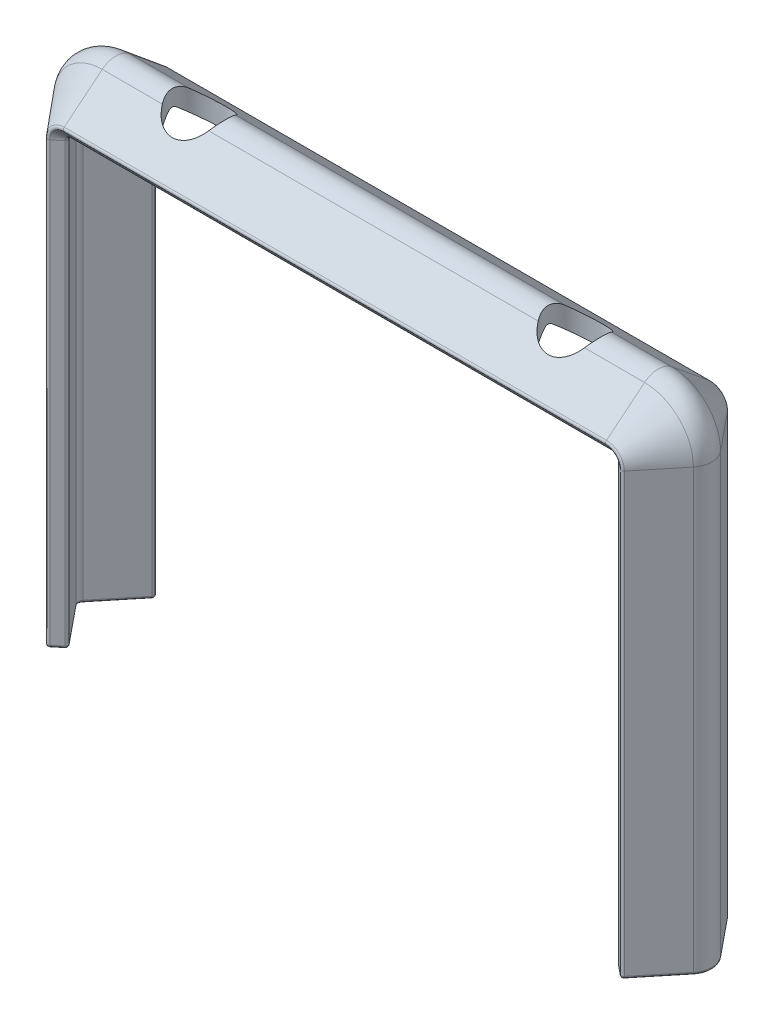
ISO-10303-21;
HEADER;
FILE_DESCRIPTION(('STEP AP214'),'2;1');
FILE_NAME('part.step','',(''),(''),'','','');
FILE_SCHEMA(('AUTOMOTIVE_DESIGN { 1 0 10303 214 1 1 1 1 }'));
ENDSEC;
DATA;
#1=APPLICATION_CONTEXT('core data for automotive mechanical design processes');
#2=APPLICATION_PROTOCOL_DEFINITION('international standard','automotive_design',2000,#1);
#3=PRODUCT_CONTEXT('',#1,'mechanical');
#4=PRODUCT('Part','Part','',(#3));
#5=PRODUCT_RELATED_PRODUCT_CATEGORY('part','',(#4));
#6=PRODUCT_DEFINITION_FORMATION('','',#4);
#7=PRODUCT_DEFINITION_CONTEXT('part definition',#1,'design');
#8=PRODUCT_DEFINITION('design','',#6,#7);
#9=PRODUCT_DEFINITION_SHAPE('','',#8);
#10=(LENGTH_UNIT() NAMED_UNIT(*) SI_UNIT(.MILLI.,.METRE.));
#11=(NAMED_UNIT(*) PLANE_ANGLE_UNIT() SI_UNIT($,.RADIAN.));
#12=(NAMED_UNIT(*) SI_UNIT($,.STERADIAN.) SOLID_ANGLE_UNIT());
#13=UNCERTAINTY_MEASURE_WITH_UNIT(LENGTH_MEASURE(1.E-05),#10,'distance_accuracy_value','');
#14=(GEOMETRIC_REPRESENTATION_CONTEXT(3) GLOBAL_UNCERTAINTY_ASSIGNED_CONTEXT((#13)) GLOBAL_UNIT_ASSIGNED_CONTEXT((#10,
#11,#12)) REPRESENTATION_CONTEXT('',''));
#15=CARTESIAN_POINT('',(0.,0.,0.));
#16=DIRECTION('',(0.,0.,1.));
#17=DIRECTION('',(1.,0.,0.));
#18=AXIS2_PLACEMENT_3D('',#15,#16,#17);
#19=CARTESIAN_POINT('',(-25.25,42.5,-5.));
#20=DIRECTION('',(0.,0.774646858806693,-0.632394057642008));
#21=DIRECTION('',(0.,0.632394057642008,0.774646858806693));
#22=AXIS2_PLACEMENT_3D('',#19,#20,#21);
#23=PLANE('',#22);
#24=DIRECTION('',(1.,0.,0.));
#25=VECTOR('',#24,1.);
#26=CARTESIAN_POINT('',(-25.25,45.5492937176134,-1.26478811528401));
#27=LINE('',#26,#25);
#28=CARTESIAN_POINT('',(-25.25,45.5492937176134,-1.26478811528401));
#29=VERTEX_POINT('',#28);
#30=CARTESIAN_POINT('',(-19.6564579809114,45.5492937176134,-1.26478811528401));
#31=VERTEX_POINT('',#30);
#32=EDGE_CURVE('E389',#29,#31,#27,.T.);
#33=ORIENTED_EDGE('',*,*,#32,.T.);
#34=CARTESIAN_POINT('',(-17.5,46.5818216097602,0.));
#35=DIRECTION('',(0.,0.774646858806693,-0.632394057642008));
#36=DIRECTION('',(0.,-0.632394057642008,-0.774646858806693));
#37=AXIS2_PLACEMENT_3D('',#34,#35,#36);
#38=ELLIPSE('',#37,3.22727701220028,2.5);
#39=CARTESIAN_POINT('',(-15.3435420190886,45.5492937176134,-1.26478811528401));
#40=VERTEX_POINT('',#39);
#41=EDGE_CURVE('E1074',#31,#40,#38,.F.);
#42=ORIENTED_EDGE('',*,*,#41,.T.);
#43=CARTESIAN_POINT('',(15.3435420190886,45.5492937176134,-1.26478811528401));
#44=VERTEX_POINT('',#43);
#45=EDGE_CURVE('E393',#40,#44,#27,.T.);
#46=ORIENTED_EDGE('',*,*,#45,.T.);
#47=CARTESIAN_POINT('',(17.5,46.5818216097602,0.));
#48=DIRECTION('',(0.,0.774646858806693,-0.632394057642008));
#49=DIRECTION('',(0.,-0.632394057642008,-0.774646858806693));
#50=AXIS2_PLACEMENT_3D('',#47,#48,#49);
#51=ELLIPSE('',#50,3.22727701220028,2.5);
#52=CARTESIAN_POINT('',(19.6564579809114,45.5492937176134,-1.26478811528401));
#53=VERTEX_POINT('',#52);
#54=EDGE_CURVE('E908',#44,#53,#51,.F.);
#55=ORIENTED_EDGE('',*,*,#54,.T.);
#56=CARTESIAN_POINT('',(25.25,45.5492937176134,-1.26478811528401));
#57=VERTEX_POINT('',#56);
#58=EDGE_CURVE('E387',#53,#57,#27,.T.);
#59=ORIENTED_EDGE('',*,*,#58,.T.);
#60=DIRECTION('',(0.,0.632394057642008,0.774646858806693));
#61=VECTOR('',#60,1.);
#62=CARTESIAN_POINT('',(25.25,42.5,-5.));
#63=LINE('',#62,#61);
#64=CARTESIAN_POINT('',(25.25,42.6580985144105,-4.80633828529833));
#65=VERTEX_POINT('',#64);
#66=EDGE_CURVE('E376',#65,#57,#63,.T.);
#67=ORIENTED_EDGE('',*,*,#66,.F.);
#68=DIRECTION('',(1.,0.,0.));
#69=VECTOR('',#68,1.);
#70=CARTESIAN_POINT('',(-25.25,42.6580985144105,-4.80633828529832));
#71=LINE('',#70,#69);
#72=CARTESIAN_POINT('',(-25.25,42.6580985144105,-4.80633828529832));
#73=VERTEX_POINT('',#72);
#74=EDGE_CURVE('E501',#65,#73,#71,.F.);
#75=ORIENTED_EDGE('',*,*,#74,.T.);
#76=DIRECTION('',(0.,0.632394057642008,0.774646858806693));
#77=VECTOR('',#76,1.);
#78=CARTESIAN_POINT('',(-25.25,42.5,-5.));
#79=LINE('',#78,#77);
#80=EDGE_CURVE('E664',#73,#29,#79,.T.);
#81=ORIENTED_EDGE('',*,*,#80,.T.);
#82=EDGE_LOOP('',(#33,#42,#46,#55,#59,#67,#75,#81));
#83=FACE_BOUND('',#82,.T.);
#84=ADVANCED_FACE('F28',(#83),#23,.T.);
#85=CARTESIAN_POINT('',(-25.25,44.,0.));
#86=DIRECTION('',(1.,0.,0.));
#87=DIRECTION('',(0.,0.,-1.));
#88=AXIS2_PLACEMENT_3D('',#85,#86,#87);
#89=CYLINDRICAL_SURFACE('',#88,2.);
#90=CARTESIAN_POINT('',(-19.,44.,-2.));
#91=CARTESIAN_POINT('',(-19.0000227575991,43.9249189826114,-1.9999899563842));
#92=CARTESIAN_POINT('',(-19.0057558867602,43.8497210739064,-1.99572243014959));
#93=CARTESIAN_POINT('',(-19.027597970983,43.7016854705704,-1.97904350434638));
#94=CARTESIAN_POINT('',(-19.0437425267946,43.6288567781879,-1.96660415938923));
#95=CARTESIAN_POINT('',(-19.090783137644,43.4623945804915,-1.9288828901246));
#96=CARTESIAN_POINT('',(-19.1248594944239,43.3703574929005,-1.90063587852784));
#97=CARTESIAN_POINT('',(-19.2009453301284,43.1940318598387,-1.83286412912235));
#98=CARTESIAN_POINT('',(-19.2429770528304,43.1097660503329,-1.79330760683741));
#99=CARTESIAN_POINT('',(-19.3462496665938,42.9196603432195,-1.68777756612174));
#100=CARTESIAN_POINT('',(-19.4089418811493,42.8170334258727,-1.61742363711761));
#101=CARTESIAN_POINT('',(-19.532879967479,42.6260231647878,-1.45861935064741));
#102=CARTESIAN_POINT('',(-19.5941269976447,42.5376280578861,-1.37018407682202));
#103=CARTESIAN_POINT('',(-19.6979067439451,42.3928950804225,-1.19476026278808));
#104=CARTESIAN_POINT('',(-19.7417468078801,42.3336737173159,-1.11093376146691));
#105=CARTESIAN_POINT('',(-19.8216515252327,42.2276340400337,-0.932444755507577));
#106=CARTESIAN_POINT('',(-19.8577282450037,42.1807964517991,-0.837799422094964));
#107=CARTESIAN_POINT('',(-19.9141564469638,42.1082870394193,-0.655317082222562));
#108=CARTESIAN_POINT('',(-19.9361073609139,42.0804174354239,-0.568853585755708));
#109=CARTESIAN_POINT('',(-19.9708591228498,42.036501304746,-0.391188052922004));
#110=CARTESIAN_POINT('',(-19.9836649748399,42.02044831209,-0.299988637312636));
#111=CARTESIAN_POINT('',(-19.9990796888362,42.0011419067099,-0.11504833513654));
#112=CARTESIAN_POINT('',(-20.0016532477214,41.9979328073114,-0.0212997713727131));
#113=CARTESIAN_POINT('',(-19.9962693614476,42.0046642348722,0.16541636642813));
#114=CARTESIAN_POINT('',(-19.9883114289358,42.0146053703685,0.258383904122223));
#115=CARTESIAN_POINT('',(-19.9632836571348,42.046067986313,0.435683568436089));
#116=CARTESIAN_POINT('',(-19.9467340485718,42.0669288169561,0.520210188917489));
#117=CARTESIAN_POINT('',(-19.9060449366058,42.1186952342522,0.684171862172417));
#118=CARTESIAN_POINT('',(-19.8819035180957,42.1496033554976,0.763605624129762));
#119=CARTESIAN_POINT('',(-19.8248622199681,42.2236006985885,0.923527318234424));
#120=CARTESIAN_POINT('',(-19.7913426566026,42.2675765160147,1.00337969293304));
#121=CARTESIAN_POINT('',(-19.7189404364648,42.3645378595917,1.15470891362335));
#122=CARTESIAN_POINT('',(-19.6800547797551,42.4175284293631,1.22618103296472));
#123=CARTESIAN_POINT('',(-19.5905351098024,42.5430618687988,1.37426521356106));
#124=CARTESIAN_POINT('',(-19.5391314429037,42.6173836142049,1.44890108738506));
#125=CARTESIAN_POINT('',(-19.4349237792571,42.7762559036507,1.5853838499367));
#126=CARTESIAN_POINT('',(-19.382118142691,42.8608188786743,1.6472149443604));
#127=CARTESIAN_POINT('',(-19.2844131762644,43.0312201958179,1.75228528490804));
#128=CARTESIAN_POINT('',(-19.239242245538,43.1161509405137,1.79674173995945));
#129=CARTESIAN_POINT('',(-19.1558210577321,43.2943664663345,1.87389106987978));
#130=CARTESIAN_POINT('',(-19.1175557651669,43.3876324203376,1.90660965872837));
#131=CARTESIAN_POINT('',(-19.0639380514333,43.5527916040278,1.95062199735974));
#132=CARTESIAN_POINT('',(-19.0451560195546,43.6226128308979,1.96540293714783));
#133=CARTESIAN_POINT('',(-19.016673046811,43.7651802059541,1.98746978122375));
#134=CARTESIAN_POINT('',(-19.0069518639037,43.8379194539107,1.99477239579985));
#135=CARTESIAN_POINT('',(-18.9982779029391,43.9848633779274,2.0012999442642));
#136=CARTESIAN_POINT('',(-18.9993875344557,44.0590740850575,2.00047806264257));
#137=CARTESIAN_POINT('',(-19.0123045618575,44.2060473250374,1.99072610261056));
#138=CARTESIAN_POINT('',(-19.0241270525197,44.2788076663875,1.98178458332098));
#139=CARTESIAN_POINT('',(-19.0605150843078,44.4390632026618,1.95331430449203));
#140=CARTESIAN_POINT('',(-19.0875572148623,44.5255982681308,1.93167092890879));
#141=CARTESIAN_POINT('',(-19.1502280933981,44.6922908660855,1.87841388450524));
#142=CARTESIAN_POINT('',(-19.1858823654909,44.7724284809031,1.84677049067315));
#143=CARTESIAN_POINT('',(-19.2790324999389,44.9615289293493,1.75807608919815));
#144=CARTESIAN_POINT('',(-19.3390556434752,45.0668953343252,1.6960251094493));
#145=CARTESIAN_POINT('',(-19.4602685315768,45.264384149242,1.55438039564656));
#146=CARTESIAN_POINT('',(-19.5214595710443,45.3564907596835,1.47476601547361));
#147=CARTESIAN_POINT('',(-19.6399329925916,45.527462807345,1.2970230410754));
#148=CARTESIAN_POINT('',(-19.6971478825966,45.6061226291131,1.19864860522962));
#149=CARTESIAN_POINT('',(-19.8008304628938,45.7452665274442,0.984970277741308));
#150=CARTESIAN_POINT('',(-19.8473329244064,45.8058096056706,0.869723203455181));
#151=CARTESIAN_POINT('',(-19.9116316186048,45.8884905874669,0.664531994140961));
#152=CARTESIAN_POINT('',(-19.9338492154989,45.9167173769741,0.578408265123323));
#153=CARTESIAN_POINT('',(-19.9692155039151,45.961432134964,0.401365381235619));
#154=CARTESIAN_POINT('',(-19.9823711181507,45.9779290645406,0.310449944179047));
#155=CARTESIAN_POINT('',(-19.9985469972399,45.9981928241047,0.125961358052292));
#156=CARTESIAN_POINT('',(-20.0015302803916,46.0019132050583,0.0323797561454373));
#157=CARTESIAN_POINT('',(-19.9969871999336,45.9962334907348,-0.154129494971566));
#158=CARTESIAN_POINT('',(-19.9894600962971,45.9868324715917,-0.247057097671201));
#159=CARTESIAN_POINT('',(-19.9652400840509,45.9563964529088,-0.424484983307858));
#160=CARTESIAN_POINT('',(-19.949059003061,45.9360106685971,-0.509170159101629));
#161=CARTESIAN_POINT('',(-19.9090520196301,45.8851465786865,-0.673520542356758));
#162=CARTESIAN_POINT('',(-19.8852241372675,45.854665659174,-0.75318444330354));
#163=CARTESIAN_POINT('',(-19.8288620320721,45.7816254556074,-0.913383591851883));
#164=CARTESIAN_POINT('',(-19.7957239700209,45.738206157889,-0.993310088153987));
#165=CARTESIAN_POINT('',(-19.7240339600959,45.6423576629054,-1.14486396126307));
#166=CARTESIAN_POINT('',(-19.6854791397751,45.5899236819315,-1.21648689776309));
#167=CARTESIAN_POINT('',(-19.5966685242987,45.4657037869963,-1.36488223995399));
#168=CARTESIAN_POINT('',(-19.5456329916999,45.3921535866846,-1.43970803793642));
#169=CARTESIAN_POINT('',(-19.4420131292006,45.2348830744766,-1.57669353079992));
#170=CARTESIAN_POINT('',(-19.3894269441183,45.1511501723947,-1.63883728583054));
#171=CARTESIAN_POINT('',(-19.2910912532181,44.9810424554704,-1.74551261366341));
#172=CARTESIAN_POINT('',(-19.2451326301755,44.8954274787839,-1.7910614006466));
#173=CARTESIAN_POINT('',(-19.1600744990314,44.7156081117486,-1.87016304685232));
#174=CARTESIAN_POINT('',(-19.1209622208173,44.6214202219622,-1.90373836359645));
#175=CARTESIAN_POINT('',(-19.0658010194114,44.4538606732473,-1.94914139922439));
#176=CARTESIAN_POINT('',(-19.0463522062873,44.3825804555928,-1.96446470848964));
#177=CARTESIAN_POINT('',(-19.0169547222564,44.2369757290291,-1.98726282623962));
#178=CARTESIAN_POINT('',(-19.0069699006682,44.162663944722,-1.99476751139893));
#179=CARTESIAN_POINT('',(-19.000854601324,44.0586747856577,-1.99935742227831));
#180=CARTESIAN_POINT('',(-18.9999911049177,44.0293463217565,-2.00000392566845));
#181=CARTESIAN_POINT('',(-19.,44.,-2.));
#182=B_SPLINE_CURVE_WITH_KNOTS('',3,(#90,#91,#92,#93,#94,#95,#96,#97,#98,#99,#100,#101,#102,
#103,#104,#105,#106,#107,#108,#109,#110,#111,#112,#113,#114,#115,#116,#117,#118,#119,#120,#121,
#122,#123,#124,#125,#126,#127,#128,#129,#130,#131,#132,#133,#134,#135,#136,#137,#138,#139,#140,
#141,#142,#143,#144,#145,#146,#147,#148,#149,#150,#151,#152,#153,#154,#155,#156,#157,#158,#159,
#160,#161,#162,#163,#164,#165,#166,#167,#168,#169,#170,#171,#172,#173,#174,#175,#176,#177,#178,
#179,#180,#181),.UNSPECIFIED.,.T.,.F.,(4,2,2,2,2,2,2,2,2,2,2,2,2,2,2,2,2,2,2,2,2,2,2,2,2,2,2,2,
2,2,2,2,2,2,2,2,2,2,2,2,2,2,2,2,2,4),(0.,0.225140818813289,0.451055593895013,0.755714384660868,
1.06123795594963,1.47720804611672,1.89283253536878,2.22639303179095,2.55943127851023,
2.83862094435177,3.11765772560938,3.39765639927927,3.67766803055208,3.94241917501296,
4.20723715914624,4.49756510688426,4.78805602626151,5.13841226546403,5.48919811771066,
5.80619193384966,6.12248701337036,6.34307726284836,6.56317352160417,6.78453876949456,
7.00621641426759,7.28428560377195,7.56318925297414,7.96975811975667,8.3768074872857,
8.78961174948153,9.20105660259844,9.47985927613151,9.75844872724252,10.0380499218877,
10.3176708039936,10.5823344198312,10.8470666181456,11.1364335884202,11.4259545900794,
11.7747351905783,12.1239515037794,12.4449574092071,12.7653580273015,12.9909138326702,
13.2156045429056,13.3036035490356),.UNSPECIFIED.);
#183=CARTESIAN_POINT('',(-19.6564579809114,45.5492937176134,1.26478811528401));
#184=VERTEX_POINT('',#183);
#185=EDGE_CURVE('E43',#184,#31,#182,.T.);
#186=ORIENTED_EDGE('',*,*,#185,.T.);
#187=ORIENTED_EDGE('',*,*,#32,.F.);
#188=CARTESIAN_POINT('',(-25.25,44.,0.));
#189=DIRECTION('',(1.,0.,0.));
#190=DIRECTION('',(0.,0.,-1.));
#191=AXIS2_PLACEMENT_3D('',#188,#189,#190);
#192=CIRCLE('',#191,2.);
#193=CARTESIAN_POINT('',(-25.25,45.5492937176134,1.26478811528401));
#194=VERTEX_POINT('',#193);
#195=EDGE_CURVE('E661',#29,#194,#192,.T.);
#196=ORIENTED_EDGE('',*,*,#195,.T.);
#197=DIRECTION('',(1.,0.,0.));
#198=VECTOR('',#197,1.);
#199=CARTESIAN_POINT('',(-25.25,45.5492937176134,1.26478811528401));
#200=LINE('',#199,#198);
#201=EDGE_CURVE('E384',#194,#184,#200,.T.);
#202=ORIENTED_EDGE('',*,*,#201,.T.);
#203=EDGE_LOOP('',(#186,#187,#196,#202));
#204=FACE_BOUND('',#203,.T.);
#205=ADVANCED_FACE('F1106',(#204),#89,.T.);
#206=CARTESIAN_POINT('',(-16.,44.,-2.));
#207=CARTESIAN_POINT('',(-15.9999772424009,44.0750810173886,-1.9999899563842));
#208=CARTESIAN_POINT('',(-15.9942441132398,44.1502789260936,-1.99572243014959));
#209=CARTESIAN_POINT('',(-15.972402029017,44.2983145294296,-1.97904350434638));
#210=CARTESIAN_POINT('',(-15.9562574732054,44.3711432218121,-1.96660415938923));
#211=CARTESIAN_POINT('',(-15.909216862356,44.5376054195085,-1.9288828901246));
#212=CARTESIAN_POINT('',(-15.8751405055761,44.6296425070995,-1.90063587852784));
#213=CARTESIAN_POINT('',(-15.7990546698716,44.8059681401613,-1.83286412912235));
#214=CARTESIAN_POINT('',(-15.7570229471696,44.8902339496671,-1.79330760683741));
#215=CARTESIAN_POINT('',(-15.6537503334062,45.0803396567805,-1.68777756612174));
#216=CARTESIAN_POINT('',(-15.5910581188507,45.1829665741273,-1.61742363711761));
#217=CARTESIAN_POINT('',(-15.467120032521,45.3739768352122,-1.45861935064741));
#218=CARTESIAN_POINT('',(-15.4058730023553,45.4623719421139,-1.37018407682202));
#219=CARTESIAN_POINT('',(-15.3020932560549,45.6071049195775,-1.19476026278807));
#220=CARTESIAN_POINT('',(-15.2582531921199,45.6663262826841,-1.1109337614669));
#221=CARTESIAN_POINT('',(-15.1783484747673,45.7723659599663,-0.932444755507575));
#222=CARTESIAN_POINT('',(-15.1422717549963,45.8192035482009,-0.837799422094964));
#223=CARTESIAN_POINT('',(-15.0858435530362,45.8917129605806,-0.655317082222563));
#224=CARTESIAN_POINT('',(-15.0638926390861,45.9195825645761,-0.568853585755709));
#225=CARTESIAN_POINT('',(-15.0291408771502,45.963498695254,-0.391188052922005));
#226=CARTESIAN_POINT('',(-15.0163350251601,45.97955168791,-0.299988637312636));
#227=CARTESIAN_POINT('',(-15.0009203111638,45.9988580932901,-0.11504833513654));
#228=CARTESIAN_POINT('',(-14.9983467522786,46.0020671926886,-0.0212997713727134));
#229=CARTESIAN_POINT('',(-15.0037306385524,45.9953357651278,0.16541636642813));
#230=CARTESIAN_POINT('',(-15.0116885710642,45.9853946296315,0.258383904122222));
#231=CARTESIAN_POINT('',(-15.0367163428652,45.953932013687,0.435683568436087));
#232=CARTESIAN_POINT('',(-15.0532659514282,45.9330711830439,0.520210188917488));
#233=CARTESIAN_POINT('',(-15.0939550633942,45.8813047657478,0.684171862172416));
#234=CARTESIAN_POINT('',(-15.1180964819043,45.8503966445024,0.76360562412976));
#235=CARTESIAN_POINT('',(-15.1751377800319,45.7763993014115,0.923527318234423));
#236=CARTESIAN_POINT('',(-15.2086573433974,45.7324234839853,1.00337969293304));
#237=CARTESIAN_POINT('',(-15.2810595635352,45.6354621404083,1.15470891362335));
#238=CARTESIAN_POINT('',(-15.3199452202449,45.5824715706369,1.22618103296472));
#239=CARTESIAN_POINT('',(-15.4094648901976,45.4569381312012,1.37426521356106));
#240=CARTESIAN_POINT('',(-15.4608685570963,45.3826163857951,1.44890108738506));
#241=CARTESIAN_POINT('',(-15.5650762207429,45.2237440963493,1.5853838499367));
#242=CARTESIAN_POINT('',(-15.617881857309,45.1391811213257,1.64721494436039));
#243=CARTESIAN_POINT('',(-15.7155868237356,44.9687798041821,1.75228528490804));
#244=CARTESIAN_POINT('',(-15.760757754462,44.8838490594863,1.79674173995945));
#245=CARTESIAN_POINT('',(-15.8441789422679,44.7056335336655,1.87389106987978));
#246=CARTESIAN_POINT('',(-15.8824442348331,44.6123675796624,1.90660965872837));
#247=CARTESIAN_POINT('',(-15.9360619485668,44.4472083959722,1.95062199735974));
#248=CARTESIAN_POINT('',(-15.9548439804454,44.3773871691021,1.96540293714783));
#249=CARTESIAN_POINT('',(-15.983326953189,44.2348197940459,1.98746978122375));
#250=CARTESIAN_POINT('',(-15.9930481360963,44.1620805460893,1.99477239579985));
#251=CARTESIAN_POINT('',(-16.0017220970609,44.0151366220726,2.0012999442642));
#252=CARTESIAN_POINT('',(-16.0006124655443,43.9409259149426,2.00047806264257));
#253=CARTESIAN_POINT('',(-15.9876954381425,43.7939526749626,1.99072610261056));
#254=CARTESIAN_POINT('',(-15.9758729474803,43.7211923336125,1.98178458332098));
#255=CARTESIAN_POINT('',(-15.9394849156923,43.5609367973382,1.95331430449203));
#256=CARTESIAN_POINT('',(-15.9124427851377,43.4744017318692,1.93167092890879));
#257=CARTESIAN_POINT('',(-15.8497719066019,43.3077091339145,1.87841388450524));
#258=CARTESIAN_POINT('',(-15.8141176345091,43.2275715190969,1.84677049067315));
#259=CARTESIAN_POINT('',(-15.7209675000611,43.0384710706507,1.75807608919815));
#260=CARTESIAN_POINT('',(-15.6609443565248,42.9331046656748,1.6960251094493));
#261=CARTESIAN_POINT('',(-15.5397314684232,42.735615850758,1.55438039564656));
#262=CARTESIAN_POINT('',(-15.4785404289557,42.6435092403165,1.47476601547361));
#263=CARTESIAN_POINT('',(-15.3600670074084,42.472537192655,1.2970230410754));
#264=CARTESIAN_POINT('',(-15.3028521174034,42.3938773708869,1.19864860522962));
#265=CARTESIAN_POINT('',(-15.1991695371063,42.2547334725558,0.984970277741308));
#266=CARTESIAN_POINT('',(-15.1526670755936,42.1941903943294,0.869723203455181));
#267=CARTESIAN_POINT('',(-15.0883683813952,42.1115094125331,0.664531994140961));
#268=CARTESIAN_POINT('',(-15.0661507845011,42.0832826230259,0.578408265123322));
#269=CARTESIAN_POINT('',(-15.0307844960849,42.038567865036,0.401365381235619));
#270=CARTESIAN_POINT('',(-15.0176288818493,42.0220709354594,0.310449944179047));
#271=CARTESIAN_POINT('',(-15.0014530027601,42.0018071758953,0.125961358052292));
#272=CARTESIAN_POINT('',(-14.9984697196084,41.9980867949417,0.0323797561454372));
#273=CARTESIAN_POINT('',(-15.0030128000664,42.0037665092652,-0.154129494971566));
#274=CARTESIAN_POINT('',(-15.0105399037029,42.0131675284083,-0.247057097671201));
#275=CARTESIAN_POINT('',(-15.0347599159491,42.0436035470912,-0.424484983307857));
#276=CARTESIAN_POINT('',(-15.050940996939,42.0639893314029,-0.509170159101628));
#277=CARTESIAN_POINT('',(-15.0909479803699,42.1148534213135,-0.673520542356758));
#278=CARTESIAN_POINT('',(-15.1147758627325,42.145334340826,-0.753184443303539));
#279=CARTESIAN_POINT('',(-15.1711379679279,42.2183745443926,-0.913383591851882));
#280=CARTESIAN_POINT('',(-15.2042760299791,42.261793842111,-0.993310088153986));
#281=CARTESIAN_POINT('',(-15.2759660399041,42.3576423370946,-1.14486396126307));
#282=CARTESIAN_POINT('',(-15.3145208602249,42.4100763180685,-1.21648689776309));
#283=CARTESIAN_POINT('',(-15.4033314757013,42.5342962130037,-1.36488223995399));
#284=CARTESIAN_POINT('',(-15.4543670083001,42.6078464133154,-1.43970803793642));
#285=CARTESIAN_POINT('',(-15.5579868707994,42.7651169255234,-1.57669353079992));
#286=CARTESIAN_POINT('',(-15.6105730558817,42.8488498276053,-1.63883728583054));
#287=CARTESIAN_POINT('',(-15.7089087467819,43.0189575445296,-1.74551261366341));
#288=CARTESIAN_POINT('',(-15.7548673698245,43.1045725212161,-1.79106140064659));
#289=CARTESIAN_POINT('',(-15.8399255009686,43.2843918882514,-1.87016304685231));
#290=CARTESIAN_POINT('',(-15.8790377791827,43.3785797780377,-1.90373836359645));
#291=CARTESIAN_POINT('',(-15.9341989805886,43.5461393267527,-1.94914139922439));
#292=CARTESIAN_POINT('',(-15.9536477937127,43.6174195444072,-1.96446470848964));
#293=CARTESIAN_POINT('',(-15.9830452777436,43.7630242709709,-1.98726282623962));
#294=CARTESIAN_POINT('',(-15.9930300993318,43.837336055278,-1.99476751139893));
#295=CARTESIAN_POINT('',(-15.999145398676,43.9413252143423,-1.99935742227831));
#296=CARTESIAN_POINT('',(-16.0000088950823,43.9706536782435,-2.00000392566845));
#297=CARTESIAN_POINT('',(-16.,44.,-2.));
#298=B_SPLINE_CURVE_WITH_KNOTS('',3,(#206,#207,#208,#209,#210,#211,#212,#213,#214,#215,#216,
#217,#218,#219,#220,#221,#222,#223,#224,#225,#226,#227,#228,#229,#230,#231,#232,#233,#234,#235,
#236,#237,#238,#239,#240,#241,#242,#243,#244,#245,#246,#247,#248,#249,#250,#251,#252,#253,#254,
#255,#256,#257,#258,#259,#260,#261,#262,#263,#264,#265,#266,#267,#268,#269,#270,#271,#272,#273,
#274,#275,#276,#277,#278,#279,#280,#281,#282,#283,#284,#285,#286,#287,#288,#289,#290,#291,#292,
#293,#294,#295,#296,#297),.UNSPECIFIED.,.T.,.F.,(4,2,2,2,2,2,2,2,2,2,2,2,2,2,2,2,2,2,2,2,2,2,2,
2,2,2,2,2,2,2,2,2,2,2,2,2,2,2,2,2,2,2,2,2,2,4),(0.,0.225140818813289,0.451055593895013,
0.755714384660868,1.06123795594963,1.47720804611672,1.89283253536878,2.22639303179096,
2.55943127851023,2.83862094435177,3.11765772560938,3.39765639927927,3.67766803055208,
3.94241917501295,4.20723715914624,4.49756510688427,4.78805602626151,5.13841226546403,
5.48919811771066,5.80619193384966,6.12248701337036,6.34307726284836,6.56317352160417,
6.78453876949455,7.00621641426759,7.28428560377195,7.56318925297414,7.96975811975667,
8.3768074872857,8.78961174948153,9.20105660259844,9.47985927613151,9.75844872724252,
10.0380499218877,10.3176708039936,10.5823344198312,10.8470666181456,11.1364335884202,
11.4259545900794,11.7747351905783,12.1239515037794,12.4449574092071,12.7653580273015,
12.9909138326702,13.2156045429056,13.3036035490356),.UNSPECIFIED.);
#299=CARTESIAN_POINT('',(-15.3435420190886,45.5492937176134,1.26478811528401));
#300=VERTEX_POINT('',#299);
#301=EDGE_CURVE('E1071',#40,#300,#298,.T.);
#302=ORIENTED_EDGE('',*,*,#301,.T.);
#303=CARTESIAN_POINT('',(15.3435420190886,45.5492937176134,1.26478811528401));
#304=VERTEX_POINT('',#303);
#305=EDGE_CURVE('E388',#300,#304,#200,.T.);
#306=ORIENTED_EDGE('',*,*,#305,.T.);
#307=CARTESIAN_POINT('',(16.,44.,-2.));
#308=CARTESIAN_POINT('',(15.9999772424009,43.9249189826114,-1.9999899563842));
#309=CARTESIAN_POINT('',(15.9942441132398,43.8497210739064,-1.99572243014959));
#310=CARTESIAN_POINT('',(15.972402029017,43.7016854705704,-1.97904350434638));
#311=CARTESIAN_POINT('',(15.9562574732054,43.6288567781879,-1.96660415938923));
#312=CARTESIAN_POINT('',(15.909216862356,43.4623945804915,-1.9288828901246));
#313=CARTESIAN_POINT('',(15.8751405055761,43.3703574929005,-1.90063587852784));
#314=CARTESIAN_POINT('',(15.7990546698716,43.1940318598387,-1.83286412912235));
#315=CARTESIAN_POINT('',(15.7570229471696,43.1097660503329,-1.79330760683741));
#316=CARTESIAN_POINT('',(15.6537503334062,42.9196603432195,-1.68777756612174));
#317=CARTESIAN_POINT('',(15.5910581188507,42.8170334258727,-1.61742363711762));
#318=CARTESIAN_POINT('',(15.467120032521,42.6260231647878,-1.45861935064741));
#319=CARTESIAN_POINT('',(15.4058730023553,42.5376280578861,-1.37018407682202));
#320=CARTESIAN_POINT('',(15.3020932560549,42.3928950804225,-1.19476026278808));
#321=CARTESIAN_POINT('',(15.2582531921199,42.3336737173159,-1.11093376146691));
#322=CARTESIAN_POINT('',(15.1783484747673,42.2276340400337,-0.932444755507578));
#323=CARTESIAN_POINT('',(15.1422717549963,42.1807964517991,-0.837799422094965));
#324=CARTESIAN_POINT('',(15.0858435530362,42.1082870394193,-0.655317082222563));
#325=CARTESIAN_POINT('',(15.0638926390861,42.0804174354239,-0.568853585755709));
#326=CARTESIAN_POINT('',(15.0291408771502,42.036501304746,-0.391188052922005));
#327=CARTESIAN_POINT('',(15.0163350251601,42.02044831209,-0.299988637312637));
#328=CARTESIAN_POINT('',(15.0009203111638,42.0011419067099,-0.115048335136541));
#329=CARTESIAN_POINT('',(14.9983467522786,41.9979328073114,-0.021299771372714));
#330=CARTESIAN_POINT('',(15.0037306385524,42.0046642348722,0.165416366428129));
#331=CARTESIAN_POINT('',(15.0116885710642,42.0146053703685,0.258383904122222));
#332=CARTESIAN_POINT('',(15.0367163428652,42.046067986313,0.435683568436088));
#333=CARTESIAN_POINT('',(15.0532659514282,42.0669288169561,0.520210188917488));
#334=CARTESIAN_POINT('',(15.0939550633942,42.1186952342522,0.684171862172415));
#335=CARTESIAN_POINT('',(15.1180964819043,42.1496033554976,0.763605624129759));
#336=CARTESIAN_POINT('',(15.1751377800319,42.2236006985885,0.923527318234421));
#337=CARTESIAN_POINT('',(15.2086573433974,42.2675765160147,1.00337969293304));
#338=CARTESIAN_POINT('',(15.2810595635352,42.3645378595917,1.15470891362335));
#339=CARTESIAN_POINT('',(15.3199452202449,42.4175284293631,1.22618103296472));
#340=CARTESIAN_POINT('',(15.4094648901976,42.5430618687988,1.37426521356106));
#341=CARTESIAN_POINT('',(15.4608685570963,42.6173836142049,1.44890108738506));
#342=CARTESIAN_POINT('',(15.5650762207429,42.7762559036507,1.5853838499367));
#343=CARTESIAN_POINT('',(15.617881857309,42.8608188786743,1.64721494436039));
#344=CARTESIAN_POINT('',(15.7155868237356,43.0312201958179,1.75228528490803));
#345=CARTESIAN_POINT('',(15.760757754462,43.1161509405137,1.79674173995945));
#346=CARTESIAN_POINT('',(15.8441789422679,43.2943664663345,1.87389106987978));
#347=CARTESIAN_POINT('',(15.8824442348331,43.3876324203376,1.90660965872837));
#348=CARTESIAN_POINT('',(15.9360619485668,43.5527916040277,1.95062199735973));
#349=CARTESIAN_POINT('',(15.9548439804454,43.6226128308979,1.96540293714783));
#350=CARTESIAN_POINT('',(15.983326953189,43.7651802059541,1.98746978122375));
#351=CARTESIAN_POINT('',(15.9930481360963,43.8379194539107,1.99477239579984));
#352=CARTESIAN_POINT('',(16.0017220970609,43.9848633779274,2.0012999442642));
#353=CARTESIAN_POINT('',(16.0006124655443,44.0590740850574,2.00047806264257));
#354=CARTESIAN_POINT('',(15.9876954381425,44.2060473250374,1.99072610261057));
#355=CARTESIAN_POINT('',(15.9758729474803,44.2788076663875,1.98178458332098));
#356=CARTESIAN_POINT('',(15.9394849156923,44.4390632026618,1.95331430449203));
#357=CARTESIAN_POINT('',(15.9124427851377,44.5255982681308,1.93167092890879));
#358=CARTESIAN_POINT('',(15.8497719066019,44.6922908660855,1.87841388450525));
#359=CARTESIAN_POINT('',(15.8141176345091,44.7724284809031,1.84677049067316));
#360=CARTESIAN_POINT('',(15.7209675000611,44.9615289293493,1.75807608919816));
#361=CARTESIAN_POINT('',(15.6609443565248,45.0668953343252,1.69602510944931));
#362=CARTESIAN_POINT('',(15.5397314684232,45.264384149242,1.55438039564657));
#363=CARTESIAN_POINT('',(15.4785404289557,45.3564907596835,1.47476601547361));
#364=CARTESIAN_POINT('',(15.3600670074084,45.527462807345,1.29702304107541));
#365=CARTESIAN_POINT('',(15.3028521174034,45.6061226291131,1.19864860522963));
#366=CARTESIAN_POINT('',(15.1991695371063,45.7452665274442,0.984970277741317));
#367=CARTESIAN_POINT('',(15.1526670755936,45.8058096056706,0.86972320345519));
#368=CARTESIAN_POINT('',(15.0883683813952,45.8884905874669,0.664531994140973));
#369=CARTESIAN_POINT('',(15.0661507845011,45.9167173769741,0.578408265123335));
#370=CARTESIAN_POINT('',(15.0307844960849,45.961432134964,0.401365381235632));
#371=CARTESIAN_POINT('',(15.0176288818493,45.9779290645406,0.310449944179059));
#372=CARTESIAN_POINT('',(15.0014530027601,45.9981928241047,0.125961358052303));
#373=CARTESIAN_POINT('',(14.9984697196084,46.0019132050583,0.0323797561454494));
#374=CARTESIAN_POINT('',(15.0030128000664,45.9962334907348,-0.154129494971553));
#375=CARTESIAN_POINT('',(15.0105399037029,45.9868324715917,-0.247057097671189));
#376=CARTESIAN_POINT('',(15.0347599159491,45.9563964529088,-0.424484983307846));
#377=CARTESIAN_POINT('',(15.050940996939,45.9360106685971,-0.509170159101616));
#378=CARTESIAN_POINT('',(15.0909479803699,45.8851465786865,-0.673520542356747));
#379=CARTESIAN_POINT('',(15.1147758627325,45.854665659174,-0.753184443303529));
#380=CARTESIAN_POINT('',(15.1711379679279,45.7816254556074,-0.913383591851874));
#381=CARTESIAN_POINT('',(15.2042760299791,45.738206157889,-0.993310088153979));
#382=CARTESIAN_POINT('',(15.2759660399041,45.6423576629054,-1.14486396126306));
#383=CARTESIAN_POINT('',(15.3145208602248,45.5899236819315,-1.21648689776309));
#384=CARTESIAN_POINT('',(15.4033314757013,45.4657037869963,-1.36488223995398));
#385=CARTESIAN_POINT('',(15.4543670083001,45.3921535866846,-1.43970803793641));
#386=CARTESIAN_POINT('',(15.5579868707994,45.2348830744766,-1.57669353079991));
#387=CARTESIAN_POINT('',(15.6105730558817,45.1511501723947,-1.63883728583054));
#388=CARTESIAN_POINT('',(15.7089087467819,44.9810424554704,-1.74551261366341));
#389=CARTESIAN_POINT('',(15.7548673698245,44.8954274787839,-1.79106140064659));
#390=CARTESIAN_POINT('',(15.8399255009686,44.7156081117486,-1.87016304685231));
#391=CARTESIAN_POINT('',(15.8790377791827,44.6214202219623,-1.90373836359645));
#392=CARTESIAN_POINT('',(15.9341989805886,44.4538606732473,-1.94914139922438));
#393=CARTESIAN_POINT('',(15.9536477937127,44.3825804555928,-1.96446470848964));
#394=CARTESIAN_POINT('',(15.9830452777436,44.2369757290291,-1.98726282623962));
#395=CARTESIAN_POINT('',(15.9930300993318,44.162663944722,-1.99476751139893));
#396=CARTESIAN_POINT('',(15.999145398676,44.0586747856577,-1.99935742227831));
#397=CARTESIAN_POINT('',(16.0000088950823,44.0293463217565,-2.00000392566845));
#398=CARTESIAN_POINT('',(16.,44.,-2.));
#399=B_SPLINE_CURVE_WITH_KNOTS('',3,(#307,#308,#309,#310,#311,#312,#313,#314,#315,#316,#317,
#318,#319,#320,#321,#322,#323,#324,#325,#326,#327,#328,#329,#330,#331,#332,#333,#334,#335,#336,
#337,#338,#339,#340,#341,#342,#343,#344,#345,#346,#347,#348,#349,#350,#351,#352,#353,#354,#355,
#356,#357,#358,#359,#360,#361,#362,#363,#364,#365,#366,#367,#368,#369,#370,#371,#372,#373,#374,
#375,#376,#377,#378,#379,#380,#381,#382,#383,#384,#385,#386,#387,#388,#389,#390,#391,#392,#393,
#394,#395,#396,#397,#398),.UNSPECIFIED.,.T.,.F.,(4,2,2,2,2,2,2,2,2,2,2,2,2,2,2,2,2,2,2,2,2,2,2,
2,2,2,2,2,2,2,2,2,2,2,2,2,2,2,2,2,2,2,2,2,2,4),(0.,0.225140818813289,0.451055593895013,
0.755714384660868,1.06123795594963,1.47720804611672,1.89283253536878,2.22639303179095,
2.55943127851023,2.83862094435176,3.11765772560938,3.39765639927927,3.67766803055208,
3.94241917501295,4.20723715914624,4.49756510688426,4.78805602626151,5.13841226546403,
5.48919811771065,5.80619193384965,6.12248701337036,6.34307726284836,6.56317352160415,
6.78453876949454,7.00621641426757,7.28428560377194,7.56318925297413,7.96975811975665,
8.3768074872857,8.78961174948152,9.20105660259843,9.4798592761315,9.75844872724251,
10.0380499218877,10.3176708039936,10.5823344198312,10.8470666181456,11.1364335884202,
11.4259545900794,11.7747351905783,12.1239515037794,12.4449574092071,12.7653580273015,
12.9909138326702,13.2156045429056,13.3036035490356),.UNSPECIFIED.);
#400=EDGE_CURVE('E1103',#304,#44,#399,.T.);
#401=ORIENTED_EDGE('',*,*,#400,.T.);
#402=ORIENTED_EDGE('',*,*,#45,.F.);
#403=EDGE_LOOP('',(#302,#306,#401,#402));
#404=FACE_BOUND('',#403,.T.);
#405=ADVANCED_FACE('F1111',(#404),#89,.T.);
#406=CARTESIAN_POINT('',(-25.25,45.5492937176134,1.26478811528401));
#407=DIRECTION('',(0.,0.774646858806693,0.632394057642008));
#408=DIRECTION('',(0.,-0.632394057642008,0.774646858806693));
#409=AXIS2_PLACEMENT_3D('',#406,#407,#408);
#410=PLANE('',#409);
#411=ORIENTED_EDGE('',*,*,#305,.F.);
#412=CARTESIAN_POINT('',(-17.5,46.5818216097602,0.));
#413=DIRECTION('',(0.,0.774646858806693,0.632394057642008));
#414=DIRECTION('',(0.,-0.632394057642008,0.774646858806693));
#415=AXIS2_PLACEMENT_3D('',#412,#413,#414);
#416=ELLIPSE('',#415,3.22727701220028,2.5);
#417=EDGE_CURVE('E1122',#300,#184,#416,.F.);
#418=ORIENTED_EDGE('',*,*,#417,.T.);
#419=ORIENTED_EDGE('',*,*,#201,.F.);
#420=DIRECTION('',(0.,-0.632394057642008,0.774646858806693));
#421=VECTOR('',#420,1.);
#422=CARTESIAN_POINT('',(-25.25,45.5492937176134,1.26478811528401));
#423=LINE('',#422,#421);
#424=CARTESIAN_POINT('',(-25.25,42.6580985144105,4.80633828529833));
#425=VERTEX_POINT('',#424);
#426=EDGE_CURVE('E658',#194,#425,#423,.T.);
#427=ORIENTED_EDGE('',*,*,#426,.T.);
#428=DIRECTION('',(1.,0.,0.));
#429=VECTOR('',#428,1.);
#430=CARTESIAN_POINT('',(-25.25,42.6580985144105,4.80633828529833));
#431=LINE('',#430,#429);
#432=CARTESIAN_POINT('',(25.25,42.6580985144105,4.80633828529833));
#433=VERTEX_POINT('',#432);
#434=EDGE_CURVE('E487',#425,#433,#431,.T.);
#435=ORIENTED_EDGE('',*,*,#434,.T.);
#436=DIRECTION('',(0.,-0.632394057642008,0.774646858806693));
#437=VECTOR('',#436,1.);
#438=CARTESIAN_POINT('',(25.25,45.5492937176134,1.26478811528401));
#439=LINE('',#438,#437);
#440=CARTESIAN_POINT('',(25.25,45.5492937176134,1.26478811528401));
#441=VERTEX_POINT('',#440);
#442=EDGE_CURVE('E691',#441,#433,#439,.T.);
#443=ORIENTED_EDGE('',*,*,#442,.F.);
#444=CARTESIAN_POINT('',(19.6564579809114,45.5492937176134,1.26478811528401));
#445=VERTEX_POINT('',#444);
#446=EDGE_CURVE('E383',#445,#441,#200,.T.);
#447=ORIENTED_EDGE('',*,*,#446,.F.);
#448=CARTESIAN_POINT('',(17.5,46.5818216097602,0.));
#449=DIRECTION('',(0.,0.774646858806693,0.632394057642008));
#450=DIRECTION('',(0.,-0.632394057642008,0.774646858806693));
#451=AXIS2_PLACEMENT_3D('',#448,#449,#450);
#452=ELLIPSE('',#451,3.22727701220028,2.5);
#453=EDGE_CURVE('E1069',#445,#304,#452,.F.);
#454=ORIENTED_EDGE('',*,*,#453,.T.);
#455=EDGE_LOOP('',(#411,#418,#419,#427,#435,#443,#447,#454));
#456=FACE_BOUND('',#455,.T.);
#457=ADVANCED_FACE('F1113',(#456),#410,.T.);
#458=CARTESIAN_POINT('',(-25.25,44.3873234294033,0.316197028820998));
#459=DIRECTION('',(0.,-0.774646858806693,-0.632394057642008));
#460=DIRECTION('',(0.,0.632394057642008,-0.774646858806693));
#461=AXIS2_PLACEMENT_3D('',#458,#459,#460);
#462=PLANE('',#461);
#463=DIRECTION('',(1.,0.,0.));
#464=VECTOR('',#463,1.);
#465=CARTESIAN_POINT('',(-25.25,44.3873234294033,0.316197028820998));
#466=LINE('',#465,#464);
#467=CARTESIAN_POINT('',(-25.25,44.3873234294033,0.316197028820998));
#468=VERTEX_POINT('',#467);
#469=CARTESIAN_POINT('',(-19.9799232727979,44.3873234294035,0.316197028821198));
#470=VERTEX_POINT('',#469);
#471=EDGE_CURVE('E380',#468,#470,#466,.T.);
#472=ORIENTED_EDGE('',*,*,#471,.T.);
#473=CARTESIAN_POINT('',(-17.5,44.64545540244,0.));
#474=DIRECTION('',(0.,-0.774646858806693,-0.632394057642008));
#475=DIRECTION('',(0.,-0.632394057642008,0.774646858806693));
#476=AXIS2_PLACEMENT_3D('',#473,#474,#475);
#477=ELLIPSE('',#476,3.22727701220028,2.5);
#478=CARTESIAN_POINT('',(-15.0200767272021,44.3873234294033,0.316197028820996));
#479=VERTEX_POINT('',#478);
#480=EDGE_CURVE('E1063',#470,#479,#477,.F.);
#481=ORIENTED_EDGE('',*,*,#480,.T.);
#482=CARTESIAN_POINT('',(15.0200767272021,44.3873234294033,0.316197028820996));
#483=VERTEX_POINT('',#482);
#484=EDGE_CURVE('E367',#479,#483,#466,.T.);
#485=ORIENTED_EDGE('',*,*,#484,.T.);
#486=CARTESIAN_POINT('',(17.5,44.6454554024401,0.));
#487=DIRECTION('',(0.,-0.774646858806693,-0.632394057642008));
#488=DIRECTION('',(0.,-0.632394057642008,0.774646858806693));
#489=AXIS2_PLACEMENT_3D('',#486,#487,#488);
#490=ELLIPSE('',#489,3.22727701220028,2.5);
#491=CARTESIAN_POINT('',(19.9799232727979,44.3873234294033,0.316197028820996));
#492=VERTEX_POINT('',#491);
#493=EDGE_CURVE('E1060',#483,#492,#490,.F.);
#494=ORIENTED_EDGE('',*,*,#493,.T.);
#495=CARTESIAN_POINT('',(25.25,44.3873234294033,0.316197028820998));
#496=VERTEX_POINT('',#495);
#497=EDGE_CURVE('E375',#492,#496,#466,.T.);
#498=ORIENTED_EDGE('',*,*,#497,.T.);
#499=DIRECTION('',(0.,0.632394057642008,-0.774646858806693));
#500=VECTOR('',#499,1.);
#501=CARTESIAN_POINT('',(25.25,44.3873234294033,0.316197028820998));
#502=LINE('',#501,#500);
#503=CARTESIAN_POINT('',(25.25,41.4961282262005,3.85774719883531));
#504=VERTEX_POINT('',#503);
#505=EDGE_CURVE('E685',#504,#496,#502,.T.);
#506=ORIENTED_EDGE('',*,*,#505,.F.);
#507=DIRECTION('',(1.,0.,0.));
#508=VECTOR('',#507,1.);
#509=CARTESIAN_POINT('',(-25.25,41.4961282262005,3.85774719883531));
#510=LINE('',#509,#508);
#511=CARTESIAN_POINT('',(-25.25,41.4961282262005,3.85774719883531));
#512=VERTEX_POINT('',#511);
#513=EDGE_CURVE('E493',#504,#512,#510,.F.);
#514=ORIENTED_EDGE('',*,*,#513,.T.);
#515=DIRECTION('',(0.,0.632394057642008,-0.774646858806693));
#516=VECTOR('',#515,1.);
#517=CARTESIAN_POINT('',(-25.25,44.3873234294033,0.316197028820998));
#518=LINE('',#517,#516);
#519=EDGE_CURVE('E653',#512,#468,#518,.T.);
#520=ORIENTED_EDGE('',*,*,#519,.T.);
#521=EDGE_LOOP('',(#472,#481,#485,#494,#498,#506,#514,#520));
#522=FACE_BOUND('',#521,.T.);
#523=ADVANCED_FACE('F1055',(#522),#462,.T.);
#524=CARTESIAN_POINT('',(-25.25,44.,0.));
#525=DIRECTION('',(1.,0.,0.));
#526=DIRECTION('',(0.,0.,-1.));
#527=AXIS2_PLACEMENT_3D('',#524,#525,#526);
#528=CYLINDRICAL_SURFACE('',#527,0.499999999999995);
#529=DIRECTION('',(1.,0.,0.));
#530=VECTOR('',#529,1.);
#531=CARTESIAN_POINT('',(-25.25,44.3873234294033,-0.316197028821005));
#532=LINE('',#531,#530);
#533=CARTESIAN_POINT('',(-25.25,44.3873234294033,-0.316197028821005));
#534=VERTEX_POINT('',#533);
#535=CARTESIAN_POINT('',(-19.9799232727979,44.3873234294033,-0.316197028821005));
#536=VERTEX_POINT('',#535);
#537=EDGE_CURVE('E372',#534,#536,#532,.T.);
#538=ORIENTED_EDGE('',*,*,#537,.T.);
#539=CARTESIAN_POINT('',(-19.9494897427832,44.,-0.499999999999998));
#540=CARTESIAN_POINT('',(-19.9494902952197,44.027782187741,-0.499998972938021));
#541=CARTESIAN_POINT('',(-19.9499675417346,44.0555773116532,-0.497676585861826));
#542=CARTESIAN_POINT('',(-19.9518221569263,44.1103812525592,-0.488456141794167));
#543=CARTESIAN_POINT('',(-19.9532002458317,44.1373894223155,-0.48155442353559));
#544=CARTESIAN_POINT('',(-19.9566943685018,44.1898186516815,-0.463397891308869));
#545=CARTESIAN_POINT('',(-19.9588096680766,44.2152412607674,-0.452147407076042));
#546=CARTESIAN_POINT('',(-19.9635389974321,44.2638374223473,-0.425624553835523));
#547=CARTESIAN_POINT('',(-19.9661529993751,44.2870111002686,-0.41035240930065));
#548=CARTESIAN_POINT('',(-19.9716264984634,44.3307805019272,-0.375989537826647));
#549=CARTESIAN_POINT('',(-19.9744886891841,44.3513397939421,-0.356852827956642));
#550=CARTESIAN_POINT('',(-19.9801123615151,44.3889787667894,-0.315403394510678));
#551=CARTESIAN_POINT('',(-19.9828738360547,44.4060582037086,-0.293090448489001));
#552=CARTESIAN_POINT('',(-19.9880139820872,44.4363940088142,-0.245680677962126));
#553=CARTESIAN_POINT('',(-19.9903891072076,44.4496157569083,-0.220561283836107));
#554=CARTESIAN_POINT('',(-19.9944586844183,44.4716374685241,-0.168402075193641));
#555=CARTESIAN_POINT('',(-19.9961532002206,44.4804378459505,-0.141362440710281));
#556=CARTESIAN_POINT('',(-19.9986516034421,44.4932535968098,-0.0865083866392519));
#557=CARTESIAN_POINT('',(-19.9994669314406,44.4973304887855,-0.0587088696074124));
#558=CARTESIAN_POINT('',(-20.000154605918,44.5007754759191,-0.00280928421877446));
#559=CARTESIAN_POINT('',(-20.0000270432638,44.5001440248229,0.025290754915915));
#560=CARTESIAN_POINT('',(-19.9988521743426,44.4942369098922,0.0805710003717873));
#561=CARTESIAN_POINT('',(-19.9978179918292,44.4890275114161,0.107758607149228));
#562=CARTESIAN_POINT('',(-19.994960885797,44.4742174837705,0.160865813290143));
#563=CARTESIAN_POINT('',(-19.9931379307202,44.4646166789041,0.186785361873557));
#564=CARTESIAN_POINT('',(-19.9888864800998,44.4412349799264,0.236809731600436));
#565=CARTESIAN_POINT('',(-19.9864542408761,44.4274281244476,0.260902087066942));
#566=CARTESIAN_POINT('',(-19.9812523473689,44.3960454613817,0.306452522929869));
#567=CARTESIAN_POINT('',(-19.9784826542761,44.3784692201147,0.32791029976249));
#568=CARTESIAN_POINT('',(-19.9728548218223,44.3396831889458,0.36797571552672));
#569=CARTESIAN_POINT('',(-19.9699959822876,44.3184154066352,0.38652715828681));
#570=CARTESIAN_POINT('',(-19.9645578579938,44.2730417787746,0.419809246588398));
#571=CARTESIAN_POINT('',(-19.9619785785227,44.2489358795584,0.434539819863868));
#572=CARTESIAN_POINT('',(-19.9573902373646,44.1984895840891,0.459781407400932));
#573=CARTESIAN_POINT('',(-19.9553824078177,44.1721445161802,0.470283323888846));
#574=CARTESIAN_POINT('',(-19.9521823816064,44.118014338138,0.486695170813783));
#575=CARTESIAN_POINT('',(-19.9509900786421,44.0902294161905,0.492605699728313));
#576=CARTESIAN_POINT('',(-19.9495773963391,44.0345175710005,0.499583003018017));
#577=CARTESIAN_POINT('',(-19.9493407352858,44.0066012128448,0.500730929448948));
#578=CARTESIAN_POINT('',(-19.9498224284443,43.9509758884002,0.498368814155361));
#579=CARTESIAN_POINT('',(-19.9505407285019,43.9232669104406,0.494859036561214));
#580=CARTESIAN_POINT('',(-19.9528361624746,43.8691156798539,0.483351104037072));
#581=CARTESIAN_POINT('',(-19.9544049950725,43.8426638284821,0.475396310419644));
#582=CARTESIAN_POINT('',(-19.9582174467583,43.7914683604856,0.455270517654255));
#583=CARTESIAN_POINT('',(-19.9604611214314,43.7667248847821,0.443099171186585));
#584=CARTESIAN_POINT('',(-19.9654070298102,43.7192934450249,0.414702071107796));
#585=CARTESIAN_POINT('',(-19.9681148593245,43.6966364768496,0.398425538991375));
#586=CARTESIAN_POINT('',(-19.9736686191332,43.6543458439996,0.362347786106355));
#587=CARTESIAN_POINT('',(-19.9765145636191,43.6347124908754,0.342546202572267));
#588=CARTESIAN_POINT('',(-19.9820767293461,43.5987187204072,0.299616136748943));
#589=CARTESIAN_POINT('',(-19.9847902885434,43.582413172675,0.276441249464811));
#590=CARTESIAN_POINT('',(-19.9897356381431,43.5539270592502,0.227633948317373));
#591=CARTESIAN_POINT('',(-19.9919674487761,43.5417463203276,0.20200163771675));
#592=CARTESIAN_POINT('',(-19.9956864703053,43.5219355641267,0.149151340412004));
#593=CARTESIAN_POINT('',(-19.997177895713,43.5142797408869,0.121943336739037));
#594=CARTESIAN_POINT('',(-19.9992661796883,43.5036543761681,0.0665947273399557));
#595=CARTESIAN_POINT('',(-19.9998631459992,43.5006842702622,0.0384542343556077));
#596=CARTESIAN_POINT('',(-20.0000927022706,43.4995365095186,-0.0174364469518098));
#597=CARTESIAN_POINT('',(-19.9997418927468,43.5012763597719,-0.0451849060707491));
#598=CARTESIAN_POINT('',(-19.9981502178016,43.5093169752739,-0.0999855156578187));
#599=CARTESIAN_POINT('',(-19.9969093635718,43.515617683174,-0.127037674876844));
#600=CARTESIAN_POINT('',(-19.993677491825,43.5325644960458,-0.179626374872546));
#601=CARTESIAN_POINT('',(-19.9916881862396,43.5432006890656,-0.205166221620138));
#602=CARTESIAN_POINT('',(-19.9871736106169,43.5685061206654,-0.254110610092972));
#603=CARTESIAN_POINT('',(-19.9846482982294,43.5831756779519,-0.277514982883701));
#604=CARTESIAN_POINT('',(-19.9792879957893,43.616409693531,-0.321931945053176));
#605=CARTESIAN_POINT('',(-19.9764486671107,43.6350331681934,-0.342899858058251));
#606=CARTESIAN_POINT('',(-19.9708061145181,43.6755251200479,-0.381441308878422));
#607=CARTESIAN_POINT('',(-19.9680028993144,43.6973943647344,-0.399014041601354));
#608=CARTESIAN_POINT('',(-19.9627167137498,43.7440396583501,-0.430446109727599));
#609=CARTESIAN_POINT('',(-19.9602375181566,43.7688444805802,-0.444263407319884));
#610=CARTESIAN_POINT('',(-19.9559261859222,43.8204663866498,-0.467512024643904));
#611=CARTESIAN_POINT('',(-19.9540934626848,43.847281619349,-0.476947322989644));
#612=CARTESIAN_POINT('',(-19.9516484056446,43.8951312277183,-0.489334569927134));
#613=CARTESIAN_POINT('',(-19.9508439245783,43.9158927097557,-0.49332694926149));
#614=CARTESIAN_POINT('',(-19.9497643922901,43.9577669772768,-0.498660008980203));
#615=CARTESIAN_POINT('',(-19.9494893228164,43.9788797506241,-0.500000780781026));
#616=CARTESIAN_POINT('',(-19.9494897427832,44.,-0.499999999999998));
#617=B_SPLINE_CURVE_WITH_KNOTS('',3,(#539,#540,#541,#542,#543,#544,#545,#546,#547,#548,#549,
#550,#551,#552,#553,#554,#555,#556,#557,#558,#559,#560,#561,#562,#563,#564,#565,#566,#567,#568,
#569,#570,#571,#572,#573,#574,#575,#576,#577,#578,#579,#580,#581,#582,#583,#584,#585,#586,#587,
#588,#589,#590,#591,#592,#593,#594,#595,#596,#597,#598,#599,#600,#601,#602,#603,#604,#605,#606,
#607,#608,#609,#610,#611,#612,#613,#614,#615,#616),.UNSPECIFIED.,.T.,.F.,(4,2,2,2,2,2,2,2,2,2,2,
2,2,2,2,2,2,2,2,2,2,2,2,2,2,2,2,2,2,2,2,2,2,2,2,2,2,2,4),(0.,0.0832692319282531,
0.166605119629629,0.249858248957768,0.333106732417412,0.417411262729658,0.501721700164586,
0.586767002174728,0.671804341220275,0.755721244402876,0.839630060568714,0.922343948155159,
1.00506114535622,1.08829962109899,1.1715476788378,1.25624673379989,1.34094739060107,
1.42582931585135,1.51070017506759,1.59411878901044,1.67753267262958,1.76014670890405,
1.84276755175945,1.92646529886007,2.01017166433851,2.09516300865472,2.18015078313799,
2.26464906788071,2.3491371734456,2.43215508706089,2.51517195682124,2.59800008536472,
2.68083476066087,2.76500576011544,2.84919669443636,2.93429449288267,3.01931487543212,
3.08261901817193,3.14592097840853),.UNSPECIFIED.);
#618=EDGE_CURVE('E51',#536,#470,#617,.T.);
#619=ORIENTED_EDGE('',*,*,#618,.T.);
#620=ORIENTED_EDGE('',*,*,#471,.F.);
#621=CARTESIAN_POINT('',(-25.25,44.,0.));
#622=DIRECTION('',(-1.,0.,0.));
#623=DIRECTION('',(0.,0.,-1.));
#624=AXIS2_PLACEMENT_3D('',#621,#622,#623);
#625=CIRCLE('',#624,0.499999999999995);
#626=EDGE_CURVE('E644',#468,#534,#625,.T.);
#627=ORIENTED_EDGE('',*,*,#626,.T.);
#628=EDGE_LOOP('',(#538,#619,#620,#627));
#629=FACE_BOUND('',#628,.T.);
#630=ADVANCED_FACE('F1136',(#629),#528,.F.);
#631=ORIENTED_EDGE('',*,*,#484,.F.);
#632=CARTESIAN_POINT('',(-15.0505102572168,44.,-0.499999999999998));
#633=CARTESIAN_POINT('',(-15.0505097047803,43.972217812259,-0.499998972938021));
#634=CARTESIAN_POINT('',(-15.0500324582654,43.9444226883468,-0.497676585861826));
#635=CARTESIAN_POINT('',(-15.0481778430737,43.8896187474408,-0.488456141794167));
#636=CARTESIAN_POINT('',(-15.0467997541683,43.8626105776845,-0.48155442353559));
#637=CARTESIAN_POINT('',(-15.0433056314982,43.8101813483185,-0.463397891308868));
#638=CARTESIAN_POINT('',(-15.0411903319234,43.7847587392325,-0.45214740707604));
#639=CARTESIAN_POINT('',(-15.0364610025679,43.7361625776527,-0.425624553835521));
#640=CARTESIAN_POINT('',(-15.0338470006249,43.7129888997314,-0.410352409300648));
#641=CARTESIAN_POINT('',(-15.0283735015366,43.6692194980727,-0.375989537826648));
#642=CARTESIAN_POINT('',(-15.0255113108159,43.6486602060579,-0.356852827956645));
#643=CARTESIAN_POINT('',(-15.0198876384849,43.6110212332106,-0.315403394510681));
#644=CARTESIAN_POINT('',(-15.0171261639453,43.5939417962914,-0.293090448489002));
#645=CARTESIAN_POINT('',(-15.0119860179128,43.5636059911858,-0.245680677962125));
#646=CARTESIAN_POINT('',(-15.0096108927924,43.5503842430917,-0.220561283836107));
#647=CARTESIAN_POINT('',(-15.0055413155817,43.5283625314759,-0.168402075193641));
#648=CARTESIAN_POINT('',(-15.0038467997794,43.5195621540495,-0.141362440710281));
#649=CARTESIAN_POINT('',(-15.001348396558,43.5067464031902,-0.0865083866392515));
#650=CARTESIAN_POINT('',(-15.0005330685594,43.5026695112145,-0.0587088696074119));
#651=CARTESIAN_POINT('',(-14.999845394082,43.4992245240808,-0.00280928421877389));
#652=CARTESIAN_POINT('',(-14.9999729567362,43.4998559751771,0.0252907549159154));
#653=CARTESIAN_POINT('',(-15.0011478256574,43.5057630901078,0.080571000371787));
#654=CARTESIAN_POINT('',(-15.0021820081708,43.5109724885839,0.107758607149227));
#655=CARTESIAN_POINT('',(-15.005039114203,43.5257825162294,0.160865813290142));
#656=CARTESIAN_POINT('',(-15.0068620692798,43.5353833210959,0.186785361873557));
#657=CARTESIAN_POINT('',(-15.0111135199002,43.5587650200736,0.236809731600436));
#658=CARTESIAN_POINT('',(-15.0135457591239,43.5725718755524,0.260902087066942));
#659=CARTESIAN_POINT('',(-15.0187476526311,43.6039545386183,0.306452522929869));
#660=CARTESIAN_POINT('',(-15.0215173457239,43.6215307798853,0.327910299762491));
#661=CARTESIAN_POINT('',(-15.0271451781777,43.6603168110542,0.367975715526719));
#662=CARTESIAN_POINT('',(-15.0300040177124,43.6815845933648,0.386527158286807));
#663=CARTESIAN_POINT('',(-15.0354421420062,43.7269582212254,0.419809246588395));
#664=CARTESIAN_POINT('',(-15.0380214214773,43.7510641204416,0.434539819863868));
#665=CARTESIAN_POINT('',(-15.0426097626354,43.8015104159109,0.459781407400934));
#666=CARTESIAN_POINT('',(-15.0446175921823,43.8278554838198,0.470283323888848));
#667=CARTESIAN_POINT('',(-15.0478176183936,43.881985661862,0.486695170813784));
#668=CARTESIAN_POINT('',(-15.0490099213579,43.9097705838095,0.492605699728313));
#669=CARTESIAN_POINT('',(-15.0504226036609,43.9654824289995,0.499583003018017));
#670=CARTESIAN_POINT('',(-15.0506592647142,43.9933987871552,0.500730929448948));
#671=CARTESIAN_POINT('',(-15.0501775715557,44.0490241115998,0.498368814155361));
#672=CARTESIAN_POINT('',(-15.0494592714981,44.0767330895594,0.494859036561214));
#673=CARTESIAN_POINT('',(-15.0471638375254,44.1308843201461,0.483351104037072));
#674=CARTESIAN_POINT('',(-15.0455950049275,44.1573361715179,0.475396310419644));
#675=CARTESIAN_POINT('',(-15.0417825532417,44.2085316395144,0.455270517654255));
#676=CARTESIAN_POINT('',(-15.0395388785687,44.2332751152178,0.443099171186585));
#677=CARTESIAN_POINT('',(-15.0345929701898,44.2807065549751,0.414702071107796));
#678=CARTESIAN_POINT('',(-15.0318851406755,44.3033635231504,0.398425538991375));
#679=CARTESIAN_POINT('',(-15.0263313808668,44.3456541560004,0.362347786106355));
#680=CARTESIAN_POINT('',(-15.0234854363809,44.3652875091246,0.342546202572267));
#681=CARTESIAN_POINT('',(-15.0179232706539,44.4012812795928,0.299616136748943));
#682=CARTESIAN_POINT('',(-15.0152097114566,44.417586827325,0.276441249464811));
#683=CARTESIAN_POINT('',(-15.0102643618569,44.4460729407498,0.227633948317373));
#684=CARTESIAN_POINT('',(-15.0080325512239,44.4582536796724,0.20200163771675));
#685=CARTESIAN_POINT('',(-15.0043135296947,44.4780644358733,0.149151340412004));
#686=CARTESIAN_POINT('',(-15.002822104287,44.4857202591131,0.121943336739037));
#687=CARTESIAN_POINT('',(-15.0007338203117,44.4963456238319,0.0665947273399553));
#688=CARTESIAN_POINT('',(-15.0001368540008,44.4993157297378,0.0384542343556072));
#689=CARTESIAN_POINT('',(-14.9999072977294,44.5004634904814,-0.0174364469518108));
#690=CARTESIAN_POINT('',(-15.0002581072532,44.4987236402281,-0.0451849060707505));
#691=CARTESIAN_POINT('',(-15.0018497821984,44.4906830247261,-0.09998551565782));
#692=CARTESIAN_POINT('',(-15.0030906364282,44.484382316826,-0.127037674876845));
#693=CARTESIAN_POINT('',(-15.006322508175,44.4674355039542,-0.179626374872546));
#694=CARTESIAN_POINT('',(-15.0083118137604,44.4567993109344,-0.205166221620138));
#695=CARTESIAN_POINT('',(-15.0128263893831,44.4314938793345,-0.254110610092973));
#696=CARTESIAN_POINT('',(-15.0153517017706,44.4168243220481,-0.277514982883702));
#697=CARTESIAN_POINT('',(-15.0207120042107,44.383590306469,-0.321931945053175));
#698=CARTESIAN_POINT('',(-15.0235513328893,44.3649668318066,-0.342899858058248));
#699=CARTESIAN_POINT('',(-15.0291938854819,44.3244748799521,-0.381441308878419));
#700=CARTESIAN_POINT('',(-15.0319971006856,44.3026056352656,-0.399014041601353));
#701=CARTESIAN_POINT('',(-15.0372832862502,44.2559603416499,-0.430446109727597));
#702=CARTESIAN_POINT('',(-15.0397624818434,44.2311555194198,-0.44426340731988));
#703=CARTESIAN_POINT('',(-15.0440738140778,44.1795336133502,-0.467512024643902));
#704=CARTESIAN_POINT('',(-15.0459065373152,44.152718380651,-0.476947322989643));
#705=CARTESIAN_POINT('',(-15.0483515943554,44.1048687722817,-0.489334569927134));
#706=CARTESIAN_POINT('',(-15.0491560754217,44.0841072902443,-0.49332694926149));
#707=CARTESIAN_POINT('',(-15.0502356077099,44.0422330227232,-0.498660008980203));
#708=CARTESIAN_POINT('',(-15.0505106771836,44.0211202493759,-0.500000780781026));
#709=CARTESIAN_POINT('',(-15.0505102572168,44.,-0.499999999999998));
#710=B_SPLINE_CURVE_WITH_KNOTS('',3,(#632,#633,#634,#635,#636,#637,#638,#639,#640,#641,#642,
#643,#644,#645,#646,#647,#648,#649,#650,#651,#652,#653,#654,#655,#656,#657,#658,#659,#660,#661,
#662,#663,#664,#665,#666,#667,#668,#669,#670,#671,#672,#673,#674,#675,#676,#677,#678,#679,#680,
#681,#682,#683,#684,#685,#686,#687,#688,#689,#690,#691,#692,#693,#694,#695,#696,#697,#698,#699,
#700,#701,#702,#703,#704,#705,#706,#707,#708,#709),.UNSPECIFIED.,.T.,.F.,(4,2,2,2,2,2,2,2,2,2,2,
2,2,2,2,2,2,2,2,2,2,2,2,2,2,2,2,2,2,2,2,2,2,2,2,2,2,2,4),(0.,0.083269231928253,
0.166605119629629,0.249858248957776,0.333106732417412,0.417411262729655,0.501721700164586,
0.586767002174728,0.671804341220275,0.755721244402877,0.839630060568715,0.922343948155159,
1.00506114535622,1.08829962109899,1.1715476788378,1.25624673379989,1.34094739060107,
1.42582931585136,1.51070017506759,1.59411878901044,1.67753267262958,1.76014670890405,
1.84276755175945,1.92646529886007,2.01017166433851,2.09516300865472,2.18015078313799,
2.26464906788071,2.3491371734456,2.43215508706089,2.51517195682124,2.59800008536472,
2.68083476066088,2.76500576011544,2.84919669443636,2.93429449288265,3.01931487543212,
3.08261901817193,3.14592097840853),.UNSPECIFIED.);
#711=CARTESIAN_POINT('',(-15.0200767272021,44.3873234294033,-0.316197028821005));
#712=VERTEX_POINT('',#711);
#713=EDGE_CURVE('E356',#479,#712,#710,.T.);
#714=ORIENTED_EDGE('',*,*,#713,.T.);
#715=CARTESIAN_POINT('',(15.0200767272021,44.3873234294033,-0.316197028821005));
#716=VERTEX_POINT('',#715);
#717=EDGE_CURVE('E365',#712,#716,#532,.T.);
#718=ORIENTED_EDGE('',*,*,#717,.T.);
#719=CARTESIAN_POINT('',(15.0200767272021,44.3873234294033,-0.316197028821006));
#720=CARTESIAN_POINT('',(15.0173133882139,44.4049752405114,-0.294609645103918));
#721=CARTESIAN_POINT('',(15.0146646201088,44.4207939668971,-0.271510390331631));
#722=CARTESIAN_POINT('',(15.0098455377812,44.448400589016,-0.222959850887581));
#723=CARTESIAN_POINT('',(15.0076754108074,44.460186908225,-0.197507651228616));
#724=CARTESIAN_POINT('',(15.0040638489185,44.4793583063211,-0.14491722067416));
#725=CARTESIAN_POINT('',(15.0026230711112,44.4867394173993,-0.11777749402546));
#726=CARTESIAN_POINT('',(15.0006329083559,44.4968513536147,-0.0626364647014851));
#727=CARTESIAN_POINT('',(15.0000827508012,44.4995862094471,-0.0346359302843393));
#728=CARTESIAN_POINT('',(14.9999356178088,44.5003219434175,0.0210782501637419));
#729=CARTESIAN_POINT('',(15.000326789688,44.4983816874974,0.0487910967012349));
#730=CARTESIAN_POINT('',(15.0019933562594,44.4899522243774,0.103511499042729));
#731=CARTESIAN_POINT('',(15.0032695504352,44.4834589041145,0.13051839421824));
#732=CARTESIAN_POINT('',(15.006742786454,44.4652129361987,0.185755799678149));
#733=CARTESIAN_POINT('',(15.0090211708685,44.4529872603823,0.213825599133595));
#734=CARTESIAN_POINT('',(15.0141778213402,44.423681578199,0.267268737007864));
#735=CARTESIAN_POINT('',(15.0170564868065,44.4065983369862,0.29264026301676));
#736=CARTESIAN_POINT('',(15.0200767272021,44.3873234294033,0.316197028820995));
#737=B_SPLINE_CURVE_WITH_KNOTS('',3,(#719,#720,#721,#722,#723,#724,#725,#726,#727,#728,#729,
#730,#731,#732,#733,#734,#735,#736),.UNSPECIFIED.,.F.,.F.,(4,2,2,2,2,2,2,2,4),(0.,
0.0839691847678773,0.167971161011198,0.252048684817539,0.336053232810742,0.419005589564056,
0.502032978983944,0.593616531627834,0.685261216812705),.UNSPECIFIED.);
#738=EDGE_CURVE('E1067',#716,#483,#737,.T.);
#739=ORIENTED_EDGE('',*,*,#738,.T.);
#740=EDGE_LOOP('',(#631,#714,#718,#739));
#741=FACE_BOUND('',#740,.T.);
#742=ADVANCED_FACE('F363',(#741),#528,.F.);
#743=CARTESIAN_POINT('',(-25.25,41.33802971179,-4.05140891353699));
#744=DIRECTION('',(0.,-0.774646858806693,0.632394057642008));
#745=DIRECTION('',(0.,-0.632394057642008,-0.774646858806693));
#746=AXIS2_PLACEMENT_3D('',#743,#744,#745);
#747=PLANE('',#746);
#748=ORIENTED_EDGE('',*,*,#717,.F.);
#749=CARTESIAN_POINT('',(-17.5,44.6454554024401,0.));
#750=DIRECTION('',(0.,-0.774646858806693,0.632394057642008));
#751=DIRECTION('',(0.,-0.632394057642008,-0.774646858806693));
#752=AXIS2_PLACEMENT_3D('',#749,#750,#751);
#753=ELLIPSE('',#752,3.22727701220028,2.5);
#754=EDGE_CURVE('E11',#712,#536,#753,.F.);
#755=ORIENTED_EDGE('',*,*,#754,.T.);
#756=ORIENTED_EDGE('',*,*,#537,.F.);
#757=DIRECTION('',(0.,-0.632394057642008,-0.774646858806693));
#758=VECTOR('',#757,1.);
#759=CARTESIAN_POINT('',(-25.25,41.33802971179,-4.05140891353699));
#760=LINE('',#759,#758);
#761=CARTESIAN_POINT('',(-25.25,41.4961282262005,-3.85774719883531));
#762=VERTEX_POINT('',#761);
#763=EDGE_CURVE('E640',#534,#762,#760,.T.);
#764=ORIENTED_EDGE('',*,*,#763,.T.);
#765=DIRECTION('',(1.,0.,0.));
#766=VECTOR('',#765,1.);
#767=CARTESIAN_POINT('',(-25.25,41.4961282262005,-3.85774719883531));
#768=LINE('',#767,#766);
#769=CARTESIAN_POINT('',(25.25,41.4961282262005,-3.85774719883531));
#770=VERTEX_POINT('',#769);
#771=EDGE_CURVE('E495',#762,#770,#768,.T.);
#772=ORIENTED_EDGE('',*,*,#771,.T.);
#773=DIRECTION('',(0.,-0.632394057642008,-0.774646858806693));
#774=VECTOR('',#773,1.);
#775=CARTESIAN_POINT('',(25.25,41.33802971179,-4.05140891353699));
#776=LINE('',#775,#774);
#777=CARTESIAN_POINT('',(25.25,44.3873234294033,-0.316197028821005));
#778=VERTEX_POINT('',#777);
#779=EDGE_CURVE('E679',#778,#770,#776,.T.);
#780=ORIENTED_EDGE('',*,*,#779,.F.);
#781=CARTESIAN_POINT('',(19.9799232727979,44.3873234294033,-0.316197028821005));
#782=VERTEX_POINT('',#781);
#783=EDGE_CURVE('E373',#782,#778,#532,.T.);
#784=ORIENTED_EDGE('',*,*,#783,.F.);
#785=CARTESIAN_POINT('',(17.5,44.6454554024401,0.));
#786=DIRECTION('',(0.,-0.774646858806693,0.632394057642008));
#787=DIRECTION('',(0.,-0.632394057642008,-0.774646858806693));
#788=AXIS2_PLACEMENT_3D('',#785,#786,#787);
#789=ELLIPSE('',#788,3.22727701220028,2.5);
#790=EDGE_CURVE('E36',#782,#716,#789,.F.);
#791=ORIENTED_EDGE('',*,*,#790,.T.);
#792=EDGE_LOOP('',(#748,#755,#756,#764,#772,#780,#784,#791));
#793=FACE_BOUND('',#792,.T.);
#794=ADVANCED_FACE('F370',(#793),#747,.T.);
#795=CARTESIAN_POINT('',(19.,44.,-2.));
#796=CARTESIAN_POINT('',(19.0000227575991,44.0750810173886,-1.9999899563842));
#797=CARTESIAN_POINT('',(19.0057558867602,44.1502789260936,-1.99572243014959));
#798=CARTESIAN_POINT('',(19.027597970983,44.2983145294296,-1.97904350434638));
#799=CARTESIAN_POINT('',(19.0437425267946,44.3711432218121,-1.96660415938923));
#800=CARTESIAN_POINT('',(19.090783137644,44.5376054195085,-1.9288828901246));
#801=CARTESIAN_POINT('',(19.1248594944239,44.6296425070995,-1.90063587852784));
#802=CARTESIAN_POINT('',(19.2009453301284,44.8059681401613,-1.83286412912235));
#803=CARTESIAN_POINT('',(19.2429770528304,44.8902339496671,-1.79330760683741));
#804=CARTESIAN_POINT('',(19.3462496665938,45.0803396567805,-1.68777756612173));
#805=CARTESIAN_POINT('',(19.4089418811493,45.1829665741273,-1.61742363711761));
#806=CARTESIAN_POINT('',(19.532879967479,45.3739768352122,-1.4586193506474));
#807=CARTESIAN_POINT('',(19.5941269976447,45.4623719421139,-1.37018407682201));
#808=CARTESIAN_POINT('',(19.6979067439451,45.6071049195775,-1.19476026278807));
#809=CARTESIAN_POINT('',(19.7417468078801,45.6663262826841,-1.11093376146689));
#810=CARTESIAN_POINT('',(19.8216515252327,45.7723659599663,-0.932444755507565));
#811=CARTESIAN_POINT('',(19.8577282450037,45.8192035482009,-0.837799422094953));
#812=CARTESIAN_POINT('',(19.9141564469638,45.8917129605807,-0.655317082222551));
#813=CARTESIAN_POINT('',(19.9361073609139,45.9195825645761,-0.568853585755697));
#814=CARTESIAN_POINT('',(19.9708591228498,45.963498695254,-0.391188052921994));
#815=CARTESIAN_POINT('',(19.9836649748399,45.97955168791,-0.299988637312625));
#816=CARTESIAN_POINT('',(19.9990796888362,45.9988580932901,-0.11504833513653));
#817=CARTESIAN_POINT('',(20.0016532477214,46.0020671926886,-0.0212997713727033));
#818=CARTESIAN_POINT('',(19.9962693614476,45.9953357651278,0.165416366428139));
#819=CARTESIAN_POINT('',(19.9883114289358,45.9853946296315,0.258383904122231));
#820=CARTESIAN_POINT('',(19.9632836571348,45.953932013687,0.435683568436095));
#821=CARTESIAN_POINT('',(19.9467340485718,45.9330711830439,0.520210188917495));
#822=CARTESIAN_POINT('',(19.9060449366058,45.8813047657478,0.684171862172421));
#823=CARTESIAN_POINT('',(19.8819035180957,45.8503966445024,0.763605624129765));
#824=CARTESIAN_POINT('',(19.8248622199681,45.7763993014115,0.923527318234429));
#825=CARTESIAN_POINT('',(19.7913426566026,45.7324234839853,1.00337969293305));
#826=CARTESIAN_POINT('',(19.7189404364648,45.6354621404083,1.15470891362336));
#827=CARTESIAN_POINT('',(19.6800547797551,45.5824715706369,1.22618103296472));
#828=CARTESIAN_POINT('',(19.5905351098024,45.4569381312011,1.37426521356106));
#829=CARTESIAN_POINT('',(19.5391314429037,45.3826163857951,1.44890108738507));
#830=CARTESIAN_POINT('',(19.4349237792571,45.2237440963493,1.58538384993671));
#831=CARTESIAN_POINT('',(19.382118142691,45.1391811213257,1.6472149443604));
#832=CARTESIAN_POINT('',(19.2844131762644,44.9687798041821,1.75228528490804));
#833=CARTESIAN_POINT('',(19.239242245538,44.8838490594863,1.79674173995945));
#834=CARTESIAN_POINT('',(19.1558210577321,44.7056335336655,1.87389106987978));
#835=CARTESIAN_POINT('',(19.1175557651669,44.6123675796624,1.90660965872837));
#836=CARTESIAN_POINT('',(19.0639380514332,44.4472083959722,1.95062199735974));
#837=CARTESIAN_POINT('',(19.0451560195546,44.3773871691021,1.96540293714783));
#838=CARTESIAN_POINT('',(19.016673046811,44.2348197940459,1.98746978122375));
#839=CARTESIAN_POINT('',(19.0069518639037,44.1620805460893,1.99477239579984));
#840=CARTESIAN_POINT('',(18.9982779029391,44.0151366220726,2.0012999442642));
#841=CARTESIAN_POINT('',(18.9993875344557,43.9409259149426,2.00047806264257));
#842=CARTESIAN_POINT('',(19.0123045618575,43.7939526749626,1.99072610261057));
#843=CARTESIAN_POINT('',(19.0241270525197,43.7211923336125,1.98178458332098));
#844=CARTESIAN_POINT('',(19.0605150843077,43.5609367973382,1.95331430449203));
#845=CARTESIAN_POINT('',(19.0875572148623,43.4744017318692,1.9316709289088));
#846=CARTESIAN_POINT('',(19.1502280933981,43.3077091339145,1.87841388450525));
#847=CARTESIAN_POINT('',(19.1858823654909,43.2275715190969,1.84677049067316));
#848=CARTESIAN_POINT('',(19.2790324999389,43.0384710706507,1.75807608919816));
#849=CARTESIAN_POINT('',(19.3390556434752,42.9331046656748,1.69602510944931));
#850=CARTESIAN_POINT('',(19.4602685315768,42.735615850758,1.55438039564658));
#851=CARTESIAN_POINT('',(19.5214595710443,42.6435092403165,1.47476601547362));
#852=CARTESIAN_POINT('',(19.6399329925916,42.472537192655,1.29702304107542));
#853=CARTESIAN_POINT('',(19.6971478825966,42.3938773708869,1.19864860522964));
#854=CARTESIAN_POINT('',(19.8008304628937,42.2547334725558,0.984970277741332));
#855=CARTESIAN_POINT('',(19.8473329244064,42.1941903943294,0.869723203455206));
#856=CARTESIAN_POINT('',(19.9116316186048,42.1115094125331,0.664531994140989));
#857=CARTESIAN_POINT('',(19.9338492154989,42.0832826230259,0.578408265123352));
#858=CARTESIAN_POINT('',(19.9692155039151,42.038567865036,0.40136538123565));
#859=CARTESIAN_POINT('',(19.9823711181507,42.0220709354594,0.310449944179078));
#860=CARTESIAN_POINT('',(19.9985469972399,42.0018071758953,0.125961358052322));
#861=CARTESIAN_POINT('',(20.0015302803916,41.9980867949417,0.0323797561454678));
#862=CARTESIAN_POINT('',(19.9969871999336,42.0037665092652,-0.154129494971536));
#863=CARTESIAN_POINT('',(19.9894600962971,42.0131675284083,-0.247057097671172));
#864=CARTESIAN_POINT('',(19.965240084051,42.0436035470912,-0.424484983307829));
#865=CARTESIAN_POINT('',(19.949059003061,42.0639893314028,-0.509170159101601));
#866=CARTESIAN_POINT('',(19.9090520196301,42.1148534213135,-0.673520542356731));
#867=CARTESIAN_POINT('',(19.8852241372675,42.145334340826,-0.753184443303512));
#868=CARTESIAN_POINT('',(19.8288620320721,42.2183745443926,-0.913383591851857));
#869=CARTESIAN_POINT('',(19.7957239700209,42.261793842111,-0.993310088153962));
#870=CARTESIAN_POINT('',(19.7240339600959,42.3576423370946,-1.14486396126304));
#871=CARTESIAN_POINT('',(19.6854791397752,42.4100763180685,-1.21648689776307));
#872=CARTESIAN_POINT('',(19.5966685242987,42.5342962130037,-1.36488223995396));
#873=CARTESIAN_POINT('',(19.5456329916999,42.6078464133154,-1.43970803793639));
#874=CARTESIAN_POINT('',(19.4420131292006,42.7651169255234,-1.57669353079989));
#875=CARTESIAN_POINT('',(19.3894269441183,42.8488498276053,-1.63883728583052));
#876=CARTESIAN_POINT('',(19.2910912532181,43.0189575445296,-1.7455126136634));
#877=CARTESIAN_POINT('',(19.2451326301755,43.1045725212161,-1.79106140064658));
#878=CARTESIAN_POINT('',(19.1600744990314,43.2843918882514,-1.87016304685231));
#879=CARTESIAN_POINT('',(19.1209622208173,43.3785797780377,-1.90373836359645));
#880=CARTESIAN_POINT('',(19.0658010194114,43.5461393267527,-1.94914139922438));
#881=CARTESIAN_POINT('',(19.0463522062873,43.6174195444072,-1.96446470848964));
#882=CARTESIAN_POINT('',(19.0169547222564,43.7630242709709,-1.98726282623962));
#883=CARTESIAN_POINT('',(19.0069699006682,43.837336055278,-1.99476751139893));
#884=CARTESIAN_POINT('',(19.000854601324,43.9413252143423,-1.99935742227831));
#885=CARTESIAN_POINT('',(18.9999911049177,43.9706536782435,-2.00000392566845));
#886=CARTESIAN_POINT('',(19.,44.,-2.));
#887=B_SPLINE_CURVE_WITH_KNOTS('',3,(#795,#796,#797,#798,#799,#800,#801,#802,#803,#804,#805,
#806,#807,#808,#809,#810,#811,#812,#813,#814,#815,#816,#817,#818,#819,#820,#821,#822,#823,#824,
#825,#826,#827,#828,#829,#830,#831,#832,#833,#834,#835,#836,#837,#838,#839,#840,#841,#842,#843,
#844,#845,#846,#847,#848,#849,#850,#851,#852,#853,#854,#855,#856,#857,#858,#859,#860,#861,#862,
#863,#864,#865,#866,#867,#868,#869,#870,#871,#872,#873,#874,#875,#876,#877,#878,#879,#880,#881,
#882,#883,#884,#885,#886),.UNSPECIFIED.,.T.,.F.,(4,2,2,2,2,2,2,2,2,2,2,2,2,2,2,2,2,2,2,2,2,2,2,
2,2,2,2,2,2,2,2,2,2,2,2,2,2,2,2,2,2,2,2,2,2,4),(0.,0.225140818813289,0.451055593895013,
0.755714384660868,1.06123795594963,1.47720804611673,1.89283253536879,2.22639303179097,
2.55943127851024,2.83862094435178,3.11765772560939,3.39765639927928,3.67766803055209,
3.94241917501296,4.20723715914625,4.49756510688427,4.78805602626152,5.13841226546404,
5.48919811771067,5.80619193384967,6.12248701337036,6.34307726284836,6.56317352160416,
6.78453876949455,7.00621641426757,7.28428560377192,7.56318925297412,7.96975811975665,
8.37680748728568,8.7896117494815,9.20105660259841,9.47985927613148,9.75844872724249,
10.0380499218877,10.3176708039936,10.5823344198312,10.8470666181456,11.1364335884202,
11.4259545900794,11.7747351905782,12.1239515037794,12.4449574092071,12.7653580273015,
12.9909138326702,13.2156045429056,13.3036035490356),.UNSPECIFIED.);
#888=EDGE_CURVE('E714',#53,#445,#887,.T.);
#889=ORIENTED_EDGE('',*,*,#888,.T.);
#890=ORIENTED_EDGE('',*,*,#446,.T.);
#891=CARTESIAN_POINT('',(25.25,44.,0.));
#892=DIRECTION('',(1.,0.,0.));
#893=DIRECTION('',(0.,0.,-1.));
#894=AXIS2_PLACEMENT_3D('',#891,#892,#893);
#895=CIRCLE('',#894,2.);
#896=EDGE_CURVE('E693',#57,#441,#895,.T.);
#897=ORIENTED_EDGE('',*,*,#896,.F.);
#898=ORIENTED_EDGE('',*,*,#58,.F.);
#899=EDGE_LOOP('',(#889,#890,#897,#898));
#900=FACE_BOUND('',#899,.T.);
#901=ADVANCED_FACE('F711',(#900),#89,.T.);
#902=ORIENTED_EDGE('',*,*,#497,.F.);
#903=CARTESIAN_POINT('',(19.9799232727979,44.3873234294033,0.316197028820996));
#904=CARTESIAN_POINT('',(19.9826866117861,44.4049752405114,0.294609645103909));
#905=CARTESIAN_POINT('',(19.9853353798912,44.4207939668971,0.271510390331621));
#906=CARTESIAN_POINT('',(19.9901544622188,44.448400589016,0.222959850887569));
#907=CARTESIAN_POINT('',(19.9923245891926,44.460186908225,0.197507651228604));
#908=CARTESIAN_POINT('',(19.9959361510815,44.4793583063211,0.144917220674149));
#909=CARTESIAN_POINT('',(19.9973769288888,44.4867394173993,0.117777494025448));
#910=CARTESIAN_POINT('',(19.9993670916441,44.4968513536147,0.0626364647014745));
#911=CARTESIAN_POINT('',(19.9999172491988,44.4995862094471,0.03463593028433));
#912=CARTESIAN_POINT('',(20.0000643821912,44.5003219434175,-0.0210782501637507));
#913=CARTESIAN_POINT('',(19.999673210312,44.4983816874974,-0.0487910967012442));
#914=CARTESIAN_POINT('',(19.9980066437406,44.4899522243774,-0.103511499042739));
#915=CARTESIAN_POINT('',(19.9967304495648,44.4834589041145,-0.13051839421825));
#916=CARTESIAN_POINT('',(19.993257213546,44.4652129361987,-0.185755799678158));
#917=CARTESIAN_POINT('',(19.9909788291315,44.4529872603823,-0.213825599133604));
#918=CARTESIAN_POINT('',(19.9858221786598,44.423681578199,-0.267268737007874));
#919=CARTESIAN_POINT('',(19.9829435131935,44.4065983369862,-0.292640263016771));
#920=CARTESIAN_POINT('',(19.9799232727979,44.3873234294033,-0.316197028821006));
#921=B_SPLINE_CURVE_WITH_KNOTS('',3,(#903,#904,#905,#906,#907,#908,#909,#910,#911,#912,#913,
#914,#915,#916,#917,#918,#919,#920),.UNSPECIFIED.,.F.,.F.,(4,2,2,2,2,2,2,2,4),(0.,
0.0839691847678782,0.167971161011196,0.252048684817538,0.336053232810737,0.419005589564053,
0.502032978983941,0.59361653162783,0.685261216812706),.UNSPECIFIED.);
#922=EDGE_CURVE('E1068',#492,#782,#921,.T.);
#923=ORIENTED_EDGE('',*,*,#922,.T.);
#924=ORIENTED_EDGE('',*,*,#783,.T.);
#925=CARTESIAN_POINT('',(25.25,44.,0.));
#926=DIRECTION('',(-1.,0.,0.));
#927=DIRECTION('',(0.,0.,-1.));
#928=AXIS2_PLACEMENT_3D('',#925,#926,#927);
#929=CIRCLE('',#928,0.499999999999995);
#930=EDGE_CURVE('E682',#496,#778,#929,.T.);
#931=ORIENTED_EDGE('',*,*,#930,.F.);
#932=EDGE_LOOP('',(#902,#923,#924,#931));
#933=FACE_BOUND('',#932,.T.);
#934=ADVANCED_FACE('F1086',(#933),#528,.F.);
#935=CARTESIAN_POINT('',(26.75,41.,-5.));
#936=DIRECTION('',(0.774646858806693,0.,-0.632394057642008));
#937=DIRECTION('',(-0.632394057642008,0.,-0.774646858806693));
#938=AXIS2_PLACEMENT_3D('',#935,#936,#937);
#939=PLANE('',#938);
#940=DIRECTION('',(0.,-1.,0.));
#941=VECTOR('',#940,1.);
#942=CARTESIAN_POINT('',(29.7992937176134,41.,-1.26478811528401));
#943=LINE('',#942,#941);
#944=CARTESIAN_POINT('',(29.7992937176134,41.,-1.26478811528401));
#945=VERTEX_POINT('',#944);
#946=CARTESIAN_POINT('',(29.7992937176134,0.249999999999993,-1.26478811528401));
#947=VERTEX_POINT('',#946);
#948=EDGE_CURVE('E436',#945,#947,#943,.T.);
#949=ORIENTED_EDGE('',*,*,#948,.T.);
#950=DIRECTION('',(0.632394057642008,0.,0.774646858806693));
#951=VECTOR('',#950,1.);
#952=CARTESIAN_POINT('',(26.75,0.249999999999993,-5.));
#953=LINE('',#952,#951);
#954=CARTESIAN_POINT('',(26.9080985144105,0.249999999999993,-4.80633828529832));
#955=VERTEX_POINT('',#954);
#956=EDGE_CURVE('E554',#947,#955,#953,.F.);
#957=ORIENTED_EDGE('',*,*,#956,.T.);
#958=DIRECTION('',(0.,-1.,0.));
#959=VECTOR('',#958,1.);
#960=CARTESIAN_POINT('',(26.9080985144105,41.,-4.80633828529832));
#961=LINE('',#960,#959);
#962=CARTESIAN_POINT('',(26.9080985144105,41.,-4.80633828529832));
#963=VERTEX_POINT('',#962);
#964=EDGE_CURVE('E552',#955,#963,#961,.F.);
#965=ORIENTED_EDGE('',*,*,#964,.T.);
#966=DIRECTION('',(0.632394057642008,0.,0.774646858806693));
#967=VECTOR('',#966,1.);
#968=CARTESIAN_POINT('',(26.75,41.,-5.));
#969=LINE('',#968,#967);
#970=EDGE_CURVE('E413',#963,#945,#969,.T.);
#971=ORIENTED_EDGE('',*,*,#970,.T.);
#972=EDGE_LOOP('',(#949,#957,#965,#971));
#973=FACE_BOUND('',#972,.T.);
#974=ADVANCED_FACE('F30',(#973),#939,.T.);
#975=CARTESIAN_POINT('',(28.25,41.,0.));
#976=DIRECTION('',(0.,-1.,0.));
#977=DIRECTION('',(1.,0.,0.));
#978=AXIS2_PLACEMENT_3D('',#975,#976,#977);
#979=CYLINDRICAL_SURFACE('',#978,2.);
#980=DIRECTION('',(0.,-1.,0.));
#981=VECTOR('',#980,1.);
#982=CARTESIAN_POINT('',(29.7992937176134,41.,1.26478811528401));
#983=LINE('',#982,#981);
#984=CARTESIAN_POINT('',(29.7992937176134,41.,1.26478811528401));
#985=VERTEX_POINT('',#984);
#986=CARTESIAN_POINT('',(29.7992937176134,0.249999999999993,1.26478811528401));
#987=VERTEX_POINT('',#986);
#988=EDGE_CURVE('E433',#985,#987,#983,.T.);
#989=ORIENTED_EDGE('',*,*,#988,.T.);
#990=CARTESIAN_POINT('',(28.25,0.249999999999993,0.));
#991=DIRECTION('',(0.,1.,0.));
#992=DIRECTION('',(-1.,0.,0.));
#993=AXIS2_PLACEMENT_3D('',#990,#991,#992);
#994=CIRCLE('',#993,2.);
#995=EDGE_CURVE('E550',#987,#947,#994,.T.);
#996=ORIENTED_EDGE('',*,*,#995,.T.);
#997=ORIENTED_EDGE('',*,*,#948,.F.);
#998=CARTESIAN_POINT('',(28.25,41.,0.));
#999=DIRECTION('',(0.,-1.,0.));
#1000=DIRECTION('',(0.,0.,-1.));
#1001=AXIS2_PLACEMENT_3D('',#998,#999,#1000);
#1002=CIRCLE('',#1001,2.);
#1003=EDGE_CURVE('E410',#945,#985,#1002,.T.);
#1004=ORIENTED_EDGE('',*,*,#1003,.T.);
#1005=EDGE_LOOP('',(#989,#996,#997,#1004));
#1006=FACE_BOUND('',#1005,.T.);
#1007=ADVANCED_FACE('F996',(#1006),#979,.T.);
#1008=CARTESIAN_POINT('',(29.7992937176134,41.,1.26478811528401));
#1009=DIRECTION('',(0.774646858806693,0.,0.632394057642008));
#1010=DIRECTION('',(0.632394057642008,0.,-0.774646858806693));
#1011=AXIS2_PLACEMENT_3D('',#1008,#1009,#1010);
#1012=PLANE('',#1011);
#1013=DIRECTION('',(0.,-1.,0.));
#1014=VECTOR('',#1013,1.);
#1015=CARTESIAN_POINT('',(26.9080985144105,41.,4.80633828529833));
#1016=LINE('',#1015,#1014);
#1017=CARTESIAN_POINT('',(26.9080985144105,41.,4.80633828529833));
#1018=VERTEX_POINT('',#1017);
#1019=CARTESIAN_POINT('',(26.9080985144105,0.249999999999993,4.80633828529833));
#1020=VERTEX_POINT('',#1019);
#1021=EDGE_CURVE('E546',#1018,#1020,#1016,.T.);
#1022=ORIENTED_EDGE('',*,*,#1021,.T.);
#1023=DIRECTION('',(-0.632394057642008,0.,0.774646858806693));
#1024=VECTOR('',#1023,1.);
#1025=CARTESIAN_POINT('',(29.7992937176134,0.249999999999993,1.26478811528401));
#1026=LINE('',#1025,#1024);
#1027=EDGE_CURVE('E548',#1020,#987,#1026,.F.);
#1028=ORIENTED_EDGE('',*,*,#1027,.T.);
#1029=ORIENTED_EDGE('',*,*,#988,.F.);
#1030=DIRECTION('',(-0.632394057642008,0.,0.774646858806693));
#1031=VECTOR('',#1030,1.);
#1032=CARTESIAN_POINT('',(29.7992937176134,41.,1.26478811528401));
#1033=LINE('',#1032,#1031);
#1034=EDGE_CURVE('E407',#985,#1018,#1033,.T.);
#1035=ORIENTED_EDGE('',*,*,#1034,.T.);
#1036=EDGE_LOOP('',(#1022,#1028,#1029,#1035));
#1037=FACE_BOUND('',#1036,.T.);
#1038=ADVANCED_FACE('F724',(#1037),#1012,.T.);
#1039=CARTESIAN_POINT('',(26.75,41.,5.));
#1040=DIRECTION('',(-0.632394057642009,0.,0.774646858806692));
#1041=DIRECTION('',(0.774646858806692,0.,0.632394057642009));
#1042=AXIS2_PLACEMENT_3D('',#1039,#1040,#1041);
#1043=PLANE('',#1042);
#1044=DIRECTION('',(-0.774646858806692,0.,-0.632394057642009));
#1045=VECTOR('',#1044,1.);
#1046=CARTESIAN_POINT('',(26.75,0.249999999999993,5.));
#1047=LINE('',#1046,#1045);
#1048=CARTESIAN_POINT('',(25.7816914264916,0.249999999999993,4.20950742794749));
#1049=VERTEX_POINT('',#1048);
#1050=CARTESIAN_POINT('',(26.5563382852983,0.249999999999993,4.8419014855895));
#1051=VERTEX_POINT('',#1050);
#1052=EDGE_CURVE('E579',#1049,#1051,#1047,.F.);
#1053=ORIENTED_EDGE('',*,*,#1052,.T.);
#1054=DIRECTION('',(0.,-1.,0.));
#1055=VECTOR('',#1054,1.);
#1056=CARTESIAN_POINT('',(26.5563382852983,41.,4.8419014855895));
#1057=LINE('',#1056,#1055);
#1058=CARTESIAN_POINT('',(26.5563382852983,41.,4.8419014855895));
#1059=VERTEX_POINT('',#1058);
#1060=EDGE_CURVE('E581',#1051,#1059,#1057,.F.);
#1061=ORIENTED_EDGE('',*,*,#1060,.T.);
#1062=DIRECTION('',(-0.774646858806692,0.,-0.632394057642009));
#1063=VECTOR('',#1062,1.);
#1064=CARTESIAN_POINT('',(26.75,41.,5.));
#1065=LINE('',#1064,#1063);
#1066=CARTESIAN_POINT('',(25.7816914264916,41.,4.20950742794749));
#1067=VERTEX_POINT('',#1066);
#1068=EDGE_CURVE('E404',#1059,#1067,#1065,.T.);
#1069=ORIENTED_EDGE('',*,*,#1068,.T.);
#1070=DIRECTION('',(0.,-1.,0.));
#1071=VECTOR('',#1070,1.);
#1072=CARTESIAN_POINT('',(25.7816914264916,41.,4.20950742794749));
#1073=LINE('',#1072,#1071);
#1074=EDGE_CURVE('E577',#1067,#1049,#1073,.T.);
#1075=ORIENTED_EDGE('',*,*,#1074,.T.);
#1076=EDGE_LOOP('',(#1053,#1061,#1069,#1075));
#1077=FACE_BOUND('',#1076,.T.);
#1078=ADVANCED_FACE('F973',(#1077),#1043,.T.);
#1079=CARTESIAN_POINT('',(28.6373234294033,41.,0.316197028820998));
#1080=DIRECTION('',(-0.774646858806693,0.,-0.632394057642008));
#1081=DIRECTION('',(-0.632394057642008,0.,0.774646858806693));
#1082=AXIS2_PLACEMENT_3D('',#1079,#1080,#1081);
#1083=PLANE('',#1082);
#1084=DIRECTION('',(0.,-1.,0.));
#1085=VECTOR('',#1084,1.);
#1086=CARTESIAN_POINT('',(28.6373234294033,41.,0.316197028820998));
#1087=LINE('',#1086,#1085);
#1088=CARTESIAN_POINT('',(28.6373234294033,41.,0.316197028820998));
#1089=VERTEX_POINT('',#1088);
#1090=CARTESIAN_POINT('',(28.6373234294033,0.249999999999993,0.316197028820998));
#1091=VERTEX_POINT('',#1090);
#1092=EDGE_CURVE('E430',#1089,#1091,#1087,.T.);
#1093=ORIENTED_EDGE('',*,*,#1092,.T.);
#1094=DIRECTION('',(0.632394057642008,0.,-0.774646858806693));
#1095=VECTOR('',#1094,1.);
#1096=CARTESIAN_POINT('',(25.58802971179,0.249999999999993,4.05140891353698));
#1097=LINE('',#1096,#1095);
#1098=CARTESIAN_POINT('',(25.7461282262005,0.249999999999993,3.85774719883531));
#1099=VERTEX_POINT('',#1098);
#1100=EDGE_CURVE('E544',#1091,#1099,#1097,.F.);
#1101=ORIENTED_EDGE('',*,*,#1100,.T.);
#1102=DIRECTION('',(0.,-1.,0.));
#1103=VECTOR('',#1102,1.);
#1104=CARTESIAN_POINT('',(25.7461282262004,41.,3.85774719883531));
#1105=LINE('',#1104,#1103);
#1106=CARTESIAN_POINT('',(25.7461282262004,41.,3.85774719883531));
#1107=VERTEX_POINT('',#1106);
#1108=EDGE_CURVE('E542',#1099,#1107,#1105,.F.);
#1109=ORIENTED_EDGE('',*,*,#1108,.T.);
#1110=DIRECTION('',(0.632394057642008,0.,-0.774646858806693));
#1111=VECTOR('',#1110,1.);
#1112=CARTESIAN_POINT('',(28.6373234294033,41.,0.316197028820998));
#1113=LINE('',#1112,#1111);
#1114=EDGE_CURVE('E402',#1107,#1089,#1113,.T.);
#1115=ORIENTED_EDGE('',*,*,#1114,.T.);
#1116=EDGE_LOOP('',(#1093,#1101,#1109,#1115));
#1117=FACE_BOUND('',#1116,.T.);
#1118=ADVANCED_FACE('F1039',(#1117),#1083,.T.);
#1119=CARTESIAN_POINT('',(28.25,41.,0.));
#1120=DIRECTION('',(0.,-1.,0.));
#1121=DIRECTION('',(1.,0.,0.));
#1122=AXIS2_PLACEMENT_3D('',#1119,#1120,#1121);
#1123=CYLINDRICAL_SURFACE('',#1122,0.499999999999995);
#1124=DIRECTION('',(0.,-1.,0.));
#1125=VECTOR('',#1124,1.);
#1126=CARTESIAN_POINT('',(28.6373234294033,41.,-0.316197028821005));
#1127=LINE('',#1126,#1125);
#1128=CARTESIAN_POINT('',(28.6373234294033,41.,-0.316197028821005));
#1129=VERTEX_POINT('',#1128);
#1130=CARTESIAN_POINT('',(28.6373234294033,0.249999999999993,-0.316197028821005));
#1131=VERTEX_POINT('',#1130);
#1132=EDGE_CURVE('E427',#1129,#1131,#1127,.T.);
#1133=ORIENTED_EDGE('',*,*,#1132,.T.);
#1134=CARTESIAN_POINT('',(28.25,0.249999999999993,0.));
#1135=DIRECTION('',(0.,1.,0.));
#1136=DIRECTION('',(-1.,0.,0.));
#1137=AXIS2_PLACEMENT_3D('',#1134,#1135,#1136);
#1138=CIRCLE('',#1137,0.499999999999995);
#1139=EDGE_CURVE('E540',#1131,#1091,#1138,.F.);
#1140=ORIENTED_EDGE('',*,*,#1139,.T.);
#1141=ORIENTED_EDGE('',*,*,#1092,.F.);
#1142=CARTESIAN_POINT('',(28.25,41.,0.));
#1143=DIRECTION('',(0.,1.,0.));
#1144=DIRECTION('',(0.,0.,-1.));
#1145=AXIS2_PLACEMENT_3D('',#1142,#1143,#1144);
#1146=CIRCLE('',#1145,0.499999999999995);
#1147=EDGE_CURVE('E399',#1089,#1129,#1146,.T.);
#1148=ORIENTED_EDGE('',*,*,#1147,.T.);
#1149=EDGE_LOOP('',(#1133,#1140,#1141,#1148));
#1150=FACE_BOUND('',#1149,.T.);
#1151=ADVANCED_FACE('F1044',(#1150),#1123,.F.);
#1152=CARTESIAN_POINT('',(25.5880297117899,41.,-4.05140891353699));
#1153=DIRECTION('',(-0.774646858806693,0.,0.632394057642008));
#1154=DIRECTION('',(0.632394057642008,0.,0.774646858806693));
#1155=AXIS2_PLACEMENT_3D('',#1152,#1153,#1154);
#1156=PLANE('',#1155);
#1157=DIRECTION('',(0.,-1.,0.));
#1158=VECTOR('',#1157,1.);
#1159=CARTESIAN_POINT('',(25.7461282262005,41.,-3.85774719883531));
#1160=LINE('',#1159,#1158);
#1161=CARTESIAN_POINT('',(25.7461282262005,41.,-3.85774719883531));
#1162=VERTEX_POINT('',#1161);
#1163=CARTESIAN_POINT('',(25.7461282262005,0.249999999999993,-3.85774719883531));
#1164=VERTEX_POINT('',#1163);
#1165=EDGE_CURVE('E536',#1162,#1164,#1160,.T.);
#1166=ORIENTED_EDGE('',*,*,#1165,.T.);
#1167=DIRECTION('',(-0.632394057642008,0.,-0.774646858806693));
#1168=VECTOR('',#1167,1.);
#1169=CARTESIAN_POINT('',(28.6373234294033,0.249999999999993,-0.316197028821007));
#1170=LINE('',#1169,#1168);
#1171=EDGE_CURVE('E538',#1164,#1131,#1170,.F.);
#1172=ORIENTED_EDGE('',*,*,#1171,.T.);
#1173=ORIENTED_EDGE('',*,*,#1132,.F.);
#1174=DIRECTION('',(-0.632394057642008,0.,-0.774646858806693));
#1175=VECTOR('',#1174,1.);
#1176=CARTESIAN_POINT('',(25.5880297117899,41.,-4.05140891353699));
#1177=LINE('',#1176,#1175);
#1178=EDGE_CURVE('E396',#1129,#1162,#1177,.T.);
#1179=ORIENTED_EDGE('',*,*,#1178,.T.);
#1180=EDGE_LOOP('',(#1166,#1172,#1173,#1179));
#1181=FACE_BOUND('',#1180,.T.);
#1182=ADVANCED_FACE('F1332',(#1181),#1156,.T.);
#1183=CARTESIAN_POINT('',(25.5880297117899,41.,-4.05140891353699));
#1184=DIRECTION('',(-0.632394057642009,0.,-0.774646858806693));
#1185=DIRECTION('',(-0.774646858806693,0.,0.632394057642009));
#1186=AXIS2_PLACEMENT_3D('',#1183,#1184,#1185);
#1187=PLANE('',#1186);
#1188=DIRECTION('',(0.774646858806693,0.,-0.632394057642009));
#1189=VECTOR('',#1188,1.);
#1190=CARTESIAN_POINT('',(25.58802971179,0.249999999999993,-4.05140891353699));
#1191=LINE('',#1190,#1189);
#1192=CARTESIAN_POINT('',(26.5563382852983,0.249999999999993,-4.84190148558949));
#1193=VERTEX_POINT('',#1192);
#1194=CARTESIAN_POINT('',(25.7816914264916,0.249999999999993,-4.20950742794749));
#1195=VERTEX_POINT('',#1194);
#1196=EDGE_CURVE('E585',#1193,#1195,#1191,.F.);
#1197=ORIENTED_EDGE('',*,*,#1196,.T.);
#1198=DIRECTION('',(0.,-1.,0.));
#1199=VECTOR('',#1198,1.);
#1200=CARTESIAN_POINT('',(25.7816914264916,41.,-4.20950742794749));
#1201=LINE('',#1200,#1199);
#1202=CARTESIAN_POINT('',(25.7816914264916,41.,-4.20950742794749));
#1203=VERTEX_POINT('',#1202);
#1204=EDGE_CURVE('E587',#1195,#1203,#1201,.F.);
#1205=ORIENTED_EDGE('',*,*,#1204,.T.);
#1206=DIRECTION('',(0.774646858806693,0.,-0.632394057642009));
#1207=VECTOR('',#1206,1.);
#1208=CARTESIAN_POINT('',(25.5880297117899,41.,-4.05140891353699));
#1209=LINE('',#1208,#1207);
#1210=CARTESIAN_POINT('',(26.5563382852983,41.,-4.84190148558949));
#1211=VERTEX_POINT('',#1210);
#1212=EDGE_CURVE('E392',#1203,#1211,#1209,.T.);
#1213=ORIENTED_EDGE('',*,*,#1212,.T.);
#1214=DIRECTION('',(0.,-1.,0.));
#1215=VECTOR('',#1214,1.);
#1216=CARTESIAN_POINT('',(26.5563382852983,41.,-4.84190148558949));
#1217=LINE('',#1216,#1215);
#1218=EDGE_CURVE('E583',#1211,#1193,#1217,.T.);
#1219=ORIENTED_EDGE('',*,*,#1218,.T.);
#1220=EDGE_LOOP('',(#1197,#1205,#1213,#1219));
#1221=FACE_BOUND('',#1220,.T.);
#1222=ADVANCED_FACE('F591',(#1221),#1187,.T.);
#1223=CARTESIAN_POINT('',(25.25,41.,-5.));
#1224=DIRECTION('',(0.,0.,1.));
#1225=DIRECTION('',(1.,0.,0.));
#1226=AXIS2_PLACEMENT_3D('',#1223,#1224,#1225);
#1227=CONICAL_SURFACE('',#1226,1.49999999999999,0.684639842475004);
#1228=ORIENTED_EDGE('',*,*,#970,.F.);
#1229=CARTESIAN_POINT('',(25.25,41.,-4.80633828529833));
#1230=DIRECTION('',(0.,0.,-1.));
#1231=DIRECTION('',(-1.,0.,0.));
#1232=AXIS2_PLACEMENT_3D('',#1229,#1230,#1231);
#1233=CIRCLE('',#1232,1.6580985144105);
#1234=EDGE_CURVE('E517',#963,#65,#1233,.F.);
#1235=ORIENTED_EDGE('',*,*,#1234,.T.);
#1236=ORIENTED_EDGE('',*,*,#66,.T.);
#1237=CARTESIAN_POINT('',(25.25,41.,-1.26478811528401));
#1238=DIRECTION('',(0.,0.,-1.));
#1239=DIRECTION('',(-1.,0.,0.));
#1240=AXIS2_PLACEMENT_3D('',#1237,#1238,#1239);
#1241=CIRCLE('',#1240,4.54929371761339);
#1242=EDGE_CURVE('E424',#57,#945,#1241,.T.);
#1243=ORIENTED_EDGE('',*,*,#1242,.T.);
#1244=EDGE_LOOP('',(#1228,#1235,#1236,#1243));
#1245=FACE_BOUND('',#1244,.T.);
#1246=ADVANCED_FACE('F703',(#1245),#1227,.T.);
#1247=CARTESIAN_POINT('',(25.25,41.,0.));
#1248=DIRECTION('',(0.,0.,-1.));
#1249=DIRECTION('',(-1.,0.,0.));
#1250=AXIS2_PLACEMENT_3D('',#1247,#1248,#1249);
#1251=TOROIDAL_SURFACE('',#1250,3.,2.);
#1252=ORIENTED_EDGE('',*,*,#896,.T.);
#1253=CARTESIAN_POINT('',(25.25,41.,1.26478811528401));
#1254=DIRECTION('',(0.,0.,-1.));
#1255=DIRECTION('',(-1.,0.,0.));
#1256=AXIS2_PLACEMENT_3D('',#1253,#1254,#1255);
#1257=CIRCLE('',#1256,4.54929371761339);
#1258=EDGE_CURVE('E421',#441,#985,#1257,.T.);
#1259=ORIENTED_EDGE('',*,*,#1258,.T.);
#1260=ORIENTED_EDGE('',*,*,#1003,.F.);
#1261=ORIENTED_EDGE('',*,*,#1242,.F.);
#1262=EDGE_LOOP('',(#1252,#1259,#1260,#1261));
#1263=FACE_BOUND('',#1262,.T.);
#1264=ADVANCED_FACE('F708',(#1263),#1251,.T.);
#1265=CARTESIAN_POINT('',(25.25,41.,1.26478811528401));
#1266=DIRECTION('',(0.,0.,-1.));
#1267=DIRECTION('',(-1.,0.,0.));
#1268=AXIS2_PLACEMENT_3D('',#1265,#1266,#1267);
#1269=CONICAL_SURFACE('',#1268,4.54929371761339,0.684639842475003);
#1270=ORIENTED_EDGE('',*,*,#442,.T.);
#1271=CARTESIAN_POINT('',(25.25,41.,4.80633828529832));
#1272=DIRECTION('',(0.,0.,1.));
#1273=DIRECTION('',(1.,0.,0.));
#1274=AXIS2_PLACEMENT_3D('',#1271,#1272,#1273);
#1275=CIRCLE('',#1274,1.6580985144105);
#1276=EDGE_CURVE('E503',#433,#1018,#1275,.F.);
#1277=ORIENTED_EDGE('',*,*,#1276,.T.);
#1278=ORIENTED_EDGE('',*,*,#1034,.F.);
#1279=ORIENTED_EDGE('',*,*,#1258,.F.);
#1280=EDGE_LOOP('',(#1270,#1277,#1278,#1279));
#1281=FACE_BOUND('',#1280,.T.);
#1282=ADVANCED_FACE('F720',(#1281),#1269,.T.);
#1283=CARTESIAN_POINT('',(25.25,41.,5.));
#1284=DIRECTION('',(0.,0.,1.));
#1285=DIRECTION('',(1.,0.,0.));
#1286=AXIS2_PLACEMENT_3D('',#1283,#1284,#1285);
#1287=CONICAL_SURFACE('',#1286,1.49999999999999,0.886156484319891);
#1288=ORIENTED_EDGE('',*,*,#1068,.F.);
#1289=CARTESIAN_POINT('',(25.25,41.,4.8419014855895));
#1290=DIRECTION('',(0.,0.,-1.));
#1291=DIRECTION('',(-1.,0.,0.));
#1292=AXIS2_PLACEMENT_3D('',#1289,#1290,#1291);
#1293=CIRCLE('',#1292,1.30633828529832);
#1294=CARTESIAN_POINT('',(25.25,42.3063382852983,4.8419014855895));
#1295=VERTEX_POINT('',#1294);
#1296=EDGE_CURVE('E507',#1059,#1295,#1293,.F.);
#1297=ORIENTED_EDGE('',*,*,#1296,.T.);
#1298=DIRECTION('',(0.,-0.774646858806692,-0.632394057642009));
#1299=VECTOR('',#1298,1.);
#1300=CARTESIAN_POINT('',(25.25,42.5,5.));
#1301=LINE('',#1300,#1299);
#1302=CARTESIAN_POINT('',(25.25,41.5316914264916,4.20950742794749));
#1303=VERTEX_POINT('',#1302);
#1304=EDGE_CURVE('E688',#1295,#1303,#1301,.T.);
#1305=ORIENTED_EDGE('',*,*,#1304,.T.);
#1306=CARTESIAN_POINT('',(25.25,41.,4.20950742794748));
#1307=DIRECTION('',(0.,0.,-1.));
#1308=DIRECTION('',(-1.,0.,0.));
#1309=AXIS2_PLACEMENT_3D('',#1306,#1307,#1308);
#1310=CIRCLE('',#1309,0.531691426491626);
#1311=EDGE_CURVE('E505',#1303,#1067,#1310,.T.);
#1312=ORIENTED_EDGE('',*,*,#1311,.T.);
#1313=EDGE_LOOP('',(#1288,#1297,#1305,#1312));
#1314=FACE_BOUND('',#1313,.T.);
#1315=ADVANCED_FACE('F970',(#1314),#1287,.F.);
#1316=CARTESIAN_POINT('',(25.25,41.,4.05140891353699));
#1317=DIRECTION('',(0.,0.,-1.));
#1318=DIRECTION('',(-1.,0.,0.));
#1319=AXIS2_PLACEMENT_3D('',#1316,#1317,#1318);
#1320=CONICAL_SURFACE('',#1319,0.338029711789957,0.684639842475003);
#1321=ORIENTED_EDGE('',*,*,#1114,.F.);
#1322=CARTESIAN_POINT('',(25.25,41.,3.85774719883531));
#1323=DIRECTION('',(0.,0.,1.));
#1324=DIRECTION('',(1.,0.,0.));
#1325=AXIS2_PLACEMENT_3D('',#1322,#1323,#1324);
#1326=CIRCLE('',#1325,0.496128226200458);
#1327=EDGE_CURVE('E509',#1107,#504,#1326,.T.);
#1328=ORIENTED_EDGE('',*,*,#1327,.T.);
#1329=ORIENTED_EDGE('',*,*,#505,.T.);
#1330=CARTESIAN_POINT('',(25.25,41.,0.316197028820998));
#1331=DIRECTION('',(0.,0.,-1.));
#1332=DIRECTION('',(-1.,0.,0.));
#1333=AXIS2_PLACEMENT_3D('',#1330,#1331,#1332);
#1334=CIRCLE('',#1333,3.38732342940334);
#1335=EDGE_CURVE('E418',#496,#1089,#1334,.T.);
#1336=ORIENTED_EDGE('',*,*,#1335,.T.);
#1337=EDGE_LOOP('',(#1321,#1328,#1329,#1336));
#1338=FACE_BOUND('',#1337,.T.);
#1339=ADVANCED_FACE('F1052',(#1338),#1320,.F.);
#1340=CARTESIAN_POINT('',(25.25,41.,0.));
#1341=DIRECTION('',(0.,0.,-1.));
#1342=DIRECTION('',(-1.,0.,0.));
#1343=AXIS2_PLACEMENT_3D('',#1340,#1341,#1342);
#1344=TOROIDAL_SURFACE('',#1343,3.,0.499999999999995);
#1345=ORIENTED_EDGE('',*,*,#930,.T.);
#1346=CARTESIAN_POINT('',(25.25,41.,-0.316197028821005));
#1347=DIRECTION('',(0.,0.,-1.));
#1348=DIRECTION('',(-1.,0.,0.));
#1349=AXIS2_PLACEMENT_3D('',#1346,#1347,#1348);
#1350=CIRCLE('',#1349,3.38732342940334);
#1351=EDGE_CURVE('E415',#778,#1129,#1350,.T.);
#1352=ORIENTED_EDGE('',*,*,#1351,.T.);
#1353=ORIENTED_EDGE('',*,*,#1147,.F.);
#1354=ORIENTED_EDGE('',*,*,#1335,.F.);
#1355=EDGE_LOOP('',(#1345,#1352,#1353,#1354));
#1356=FACE_BOUND('',#1355,.T.);
#1357=ADVANCED_FACE('F1048',(#1356),#1344,.F.);
#1358=CARTESIAN_POINT('',(25.25,41.,-0.316197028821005));
#1359=DIRECTION('',(0.,0.,1.));
#1360=DIRECTION('',(1.,0.,0.));
#1361=AXIS2_PLACEMENT_3D('',#1358,#1359,#1360);
#1362=CONICAL_SURFACE('',#1361,3.38732342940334,0.684639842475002);
#1363=ORIENTED_EDGE('',*,*,#779,.T.);
#1364=CARTESIAN_POINT('',(25.25,41.,-3.85774719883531));
#1365=DIRECTION('',(0.,0.,-1.));
#1366=DIRECTION('',(-1.,0.,0.));
#1367=AXIS2_PLACEMENT_3D('',#1364,#1365,#1366);
#1368=CIRCLE('',#1367,0.496128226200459);
#1369=EDGE_CURVE('E511',#770,#1162,#1368,.T.);
#1370=ORIENTED_EDGE('',*,*,#1369,.T.);
#1371=ORIENTED_EDGE('',*,*,#1178,.F.);
#1372=ORIENTED_EDGE('',*,*,#1351,.F.);
#1373=EDGE_LOOP('',(#1363,#1370,#1371,#1372));
#1374=FACE_BOUND('',#1373,.T.);
#1375=ADVANCED_FACE('F1350',(#1374),#1362,.F.);
#1376=CARTESIAN_POINT('',(25.25,41.,-4.05140891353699));
#1377=DIRECTION('',(0.,0.,-1.));
#1378=DIRECTION('',(-1.,0.,0.));
#1379=AXIS2_PLACEMENT_3D('',#1376,#1377,#1378);
#1380=CONICAL_SURFACE('',#1379,0.338029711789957,0.886156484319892);
#1381=ORIENTED_EDGE('',*,*,#1212,.F.);
#1382=CARTESIAN_POINT('',(25.25,41.,-4.20950742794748));
#1383=DIRECTION('',(0.,0.,1.));
#1384=DIRECTION('',(1.,0.,0.));
#1385=AXIS2_PLACEMENT_3D('',#1382,#1383,#1384);
#1386=CIRCLE('',#1385,0.531691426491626);
#1387=CARTESIAN_POINT('',(25.25,41.5316914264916,-4.20950742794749));
#1388=VERTEX_POINT('',#1387);
#1389=EDGE_CURVE('E515',#1203,#1388,#1386,.T.);
#1390=ORIENTED_EDGE('',*,*,#1389,.T.);
#1391=DIRECTION('',(0.,0.774646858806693,-0.632394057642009));
#1392=VECTOR('',#1391,1.);
#1393=CARTESIAN_POINT('',(25.25,41.33802971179,-4.05140891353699));
#1394=LINE('',#1393,#1392);
#1395=CARTESIAN_POINT('',(25.25,42.3063382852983,-4.8419014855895));
#1396=VERTEX_POINT('',#1395);
#1397=EDGE_CURVE('E634',#1388,#1396,#1394,.T.);
#1398=ORIENTED_EDGE('',*,*,#1397,.T.);
#1399=CARTESIAN_POINT('',(25.25,41.,-4.8419014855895));
#1400=DIRECTION('',(0.,0.,1.));
#1401=DIRECTION('',(1.,0.,0.));
#1402=AXIS2_PLACEMENT_3D('',#1399,#1400,#1401);
#1403=CIRCLE('',#1402,1.30633828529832);
#1404=EDGE_CURVE('E513',#1396,#1211,#1403,.F.);
#1405=ORIENTED_EDGE('',*,*,#1404,.T.);
#1406=EDGE_LOOP('',(#1381,#1390,#1398,#1405));
#1407=FACE_BOUND('',#1406,.T.);
#1408=ADVANCED_FACE('F599',(#1407),#1380,.F.);
#1409=CARTESIAN_POINT('',(-25.25,42.5,5.));
#1410=DIRECTION('',(0.,-0.632394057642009,0.774646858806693));
#1411=DIRECTION('',(0.,-0.774646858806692,-0.632394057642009));
#1412=AXIS2_PLACEMENT_3D('',#1409,#1410,#1411);
#1413=PLANE('',#1412);
#1414=ORIENTED_EDGE('',*,*,#1304,.F.);
#1415=DIRECTION('',(1.,0.,0.));
#1416=VECTOR('',#1415,1.);
#1417=CARTESIAN_POINT('',(-25.25,42.3063382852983,4.8419014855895));
#1418=LINE('',#1417,#1416);
#1419=CARTESIAN_POINT('',(-25.25,42.3063382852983,4.8419014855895));
#1420=VERTEX_POINT('',#1419);
#1421=EDGE_CURVE('E491',#1295,#1420,#1418,.F.);
#1422=ORIENTED_EDGE('',*,*,#1421,.T.);
#1423=DIRECTION('',(0.,-0.774646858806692,-0.632394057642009));
#1424=VECTOR('',#1423,1.);
#1425=CARTESIAN_POINT('',(-25.25,42.5,5.));
#1426=LINE('',#1425,#1424);
#1427=CARTESIAN_POINT('',(-25.25,41.5316914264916,4.20950742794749));
#1428=VERTEX_POINT('',#1427);
#1429=EDGE_CURVE('E655',#1420,#1428,#1426,.T.);
#1430=ORIENTED_EDGE('',*,*,#1429,.T.);
#1431=DIRECTION('',(1.,0.,0.));
#1432=VECTOR('',#1431,1.);
#1433=CARTESIAN_POINT('',(-25.25,41.5316914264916,4.20950742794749));
#1434=LINE('',#1433,#1432);
#1435=EDGE_CURVE('E489',#1428,#1303,#1434,.T.);
#1436=ORIENTED_EDGE('',*,*,#1435,.T.);
#1437=EDGE_LOOP('',(#1414,#1422,#1430,#1436));
#1438=FACE_BOUND('',#1437,.T.);
#1439=ADVANCED_FACE('F957',(#1438),#1413,.T.);
#1440=CARTESIAN_POINT('',(-25.25,41.33802971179,-4.05140891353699));
#1441=DIRECTION('',(0.,-0.632394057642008,-0.774646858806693));
#1442=DIRECTION('',(0.,0.774646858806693,-0.632394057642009));
#1443=AXIS2_PLACEMENT_3D('',#1440,#1441,#1442);
#1444=PLANE('',#1443);
#1445=ORIENTED_EDGE('',*,*,#1397,.F.);
#1446=DIRECTION('',(1.,0.,0.));
#1447=VECTOR('',#1446,1.);
#1448=CARTESIAN_POINT('',(-25.25,41.5316914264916,-4.20950742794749));
#1449=LINE('',#1448,#1447);
#1450=CARTESIAN_POINT('',(-25.25,41.5316914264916,-4.20950742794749));
#1451=VERTEX_POINT('',#1450);
#1452=EDGE_CURVE('E499',#1388,#1451,#1449,.F.);
#1453=ORIENTED_EDGE('',*,*,#1452,.T.);
#1454=DIRECTION('',(0.,0.774646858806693,-0.632394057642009));
#1455=VECTOR('',#1454,1.);
#1456=CARTESIAN_POINT('',(-25.25,41.33802971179,-4.05140891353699));
#1457=LINE('',#1456,#1455);
#1458=CARTESIAN_POINT('',(-25.25,42.3063382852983,-4.8419014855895));
#1459=VERTEX_POINT('',#1458);
#1460=EDGE_CURVE('E632',#1451,#1459,#1457,.T.);
#1461=ORIENTED_EDGE('',*,*,#1460,.T.);
#1462=DIRECTION('',(1.,0.,0.));
#1463=VECTOR('',#1462,1.);
#1464=CARTESIAN_POINT('',(-25.25,42.3063382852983,-4.8419014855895));
#1465=LINE('',#1464,#1463);
#1466=EDGE_CURVE('E497',#1459,#1396,#1465,.T.);
#1467=ORIENTED_EDGE('',*,*,#1466,.T.);
#1468=EDGE_LOOP('',(#1445,#1453,#1461,#1467));
#1469=FACE_BOUND('',#1468,.T.);
#1470=ADVANCED_FACE('F631',(#1469),#1444,.T.);
#1471=CARTESIAN_POINT('',(-25.25,41.,-5.));
#1472=DIRECTION('',(0.,0.,1.));
#1473=DIRECTION('',(1.,0.,0.));
#1474=AXIS2_PLACEMENT_3D('',#1471,#1472,#1473);
#1475=CONICAL_SURFACE('',#1474,1.5,0.684639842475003);
#1476=ORIENTED_EDGE('',*,*,#80,.F.);
#1477=CARTESIAN_POINT('',(-25.25,41.,-4.80633828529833));
#1478=DIRECTION('',(0.,0.,-1.));
#1479=DIRECTION('',(-1.,0.,0.));
#1480=AXIS2_PLACEMENT_3D('',#1477,#1478,#1479);
#1481=CIRCLE('',#1480,1.6580985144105);
#1482=CARTESIAN_POINT('',(-26.9080985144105,41.,-4.80633828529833));
#1483=VERTEX_POINT('',#1482);
#1484=EDGE_CURVE('E485',#73,#1483,#1481,.F.);
#1485=ORIENTED_EDGE('',*,*,#1484,.T.);
#1486=DIRECTION('',(-0.632394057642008,0.,0.774646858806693));
#1487=VECTOR('',#1486,1.);
#1488=CARTESIAN_POINT('',(-26.75,41.,-5.));
#1489=LINE('',#1488,#1487);
#1490=CARTESIAN_POINT('',(-29.7992937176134,41.,-1.26478811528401));
#1491=VERTEX_POINT('',#1490);
#1492=EDGE_CURVE('E841',#1483,#1491,#1489,.T.);
#1493=ORIENTED_EDGE('',*,*,#1492,.T.);
#1494=CARTESIAN_POINT('',(-25.25,41.,-1.26478811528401));
#1495=DIRECTION('',(0.,0.,-1.));
#1496=DIRECTION('',(-1.,0.,0.));
#1497=AXIS2_PLACEMENT_3D('',#1494,#1495,#1496);
#1498=CIRCLE('',#1497,4.54929371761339);
#1499=EDGE_CURVE('E675',#1491,#29,#1498,.T.);
#1500=ORIENTED_EDGE('',*,*,#1499,.T.);
#1501=EDGE_LOOP('',(#1476,#1485,#1493,#1500));
#1502=FACE_BOUND('',#1501,.T.);
#1503=ADVANCED_FACE('F1177',(#1502),#1475,.T.);
#1504=CARTESIAN_POINT('',(-25.25,41.,0.));
#1505=DIRECTION('',(0.,0.,-1.));
#1506=DIRECTION('',(-1.,0.,0.));
#1507=AXIS2_PLACEMENT_3D('',#1504,#1505,#1506);
#1508=TOROIDAL_SURFACE('',#1507,3.,2.);
#1509=CARTESIAN_POINT('',(-28.25,41.,0.));
#1510=DIRECTION('',(0.,1.,0.));
#1511=DIRECTION('',(0.,0.,-1.));
#1512=AXIS2_PLACEMENT_3D('',#1509,#1510,#1511);
#1513=CIRCLE('',#1512,2.);
#1514=CARTESIAN_POINT('',(-29.7992937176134,41.,1.26478811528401));
#1515=VERTEX_POINT('',#1514);
#1516=EDGE_CURVE('E843',#1491,#1515,#1513,.T.);
#1517=ORIENTED_EDGE('',*,*,#1516,.T.);
#1518=CARTESIAN_POINT('',(-25.25,41.,1.26478811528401));
#1519=DIRECTION('',(0.,0.,-1.));
#1520=DIRECTION('',(-1.,0.,0.));
#1521=AXIS2_PLACEMENT_3D('',#1518,#1519,#1520);
#1522=CIRCLE('',#1521,4.54929371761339);
#1523=EDGE_CURVE('E672',#1515,#194,#1522,.T.);
#1524=ORIENTED_EDGE('',*,*,#1523,.T.);
#1525=ORIENTED_EDGE('',*,*,#195,.F.);
#1526=ORIENTED_EDGE('',*,*,#1499,.F.);
#1527=EDGE_LOOP('',(#1517,#1524,#1525,#1526));
#1528=FACE_BOUND('',#1527,.T.);
#1529=ADVANCED_FACE('F1180',(#1528),#1508,.T.);
#1530=CARTESIAN_POINT('',(-25.25,41.,1.26478811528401));
#1531=DIRECTION('',(0.,0.,-1.));
#1532=DIRECTION('',(-1.,0.,0.));
#1533=AXIS2_PLACEMENT_3D('',#1530,#1531,#1532);
#1534=CONICAL_SURFACE('',#1533,4.54929371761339,0.684639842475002);
#1535=DIRECTION('',(0.632394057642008,0.,0.774646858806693));
#1536=VECTOR('',#1535,1.);
#1537=CARTESIAN_POINT('',(-29.7992937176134,41.,1.26478811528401));
#1538=LINE('',#1537,#1536);
#1539=CARTESIAN_POINT('',(-26.9080985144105,41.,4.80633828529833));
#1540=VERTEX_POINT('',#1539);
#1541=EDGE_CURVE('E846',#1515,#1540,#1538,.T.);
#1542=ORIENTED_EDGE('',*,*,#1541,.T.);
#1543=CARTESIAN_POINT('',(-25.25,41.,4.80633828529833));
#1544=DIRECTION('',(0.,0.,1.));
#1545=DIRECTION('',(1.,0.,0.));
#1546=AXIS2_PLACEMENT_3D('',#1543,#1544,#1545);
#1547=CIRCLE('',#1546,1.6580985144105);
#1548=EDGE_CURVE('E471',#1540,#425,#1547,.F.);
#1549=ORIENTED_EDGE('',*,*,#1548,.T.);
#1550=ORIENTED_EDGE('',*,*,#426,.F.);
#1551=ORIENTED_EDGE('',*,*,#1523,.F.);
#1552=EDGE_LOOP('',(#1542,#1549,#1550,#1551));
#1553=FACE_BOUND('',#1552,.T.);
#1554=ADVANCED_FACE('F1183',(#1553),#1534,.T.);
#1555=CARTESIAN_POINT('',(-25.25,41.,5.));
#1556=DIRECTION('',(0.,0.,1.));
#1557=DIRECTION('',(1.,0.,0.));
#1558=AXIS2_PLACEMENT_3D('',#1555,#1556,#1557);
#1559=CONICAL_SURFACE('',#1558,1.5,0.886156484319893);
#1560=ORIENTED_EDGE('',*,*,#1429,.F.);
#1561=CARTESIAN_POINT('',(-25.25,41.,4.8419014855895));
#1562=DIRECTION('',(0.,0.,-1.));
#1563=DIRECTION('',(-1.,0.,0.));
#1564=AXIS2_PLACEMENT_3D('',#1561,#1562,#1563);
#1565=CIRCLE('',#1564,1.30633828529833);
#1566=CARTESIAN_POINT('',(-26.5563382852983,41.,4.8419014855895));
#1567=VERTEX_POINT('',#1566);
#1568=EDGE_CURVE('E475',#1420,#1567,#1565,.F.);
#1569=ORIENTED_EDGE('',*,*,#1568,.T.);
#1570=DIRECTION('',(0.774646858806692,0.,-0.632394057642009));
#1571=VECTOR('',#1570,1.);
#1572=CARTESIAN_POINT('',(-26.75,41.,5.));
#1573=LINE('',#1572,#1571);
#1574=CARTESIAN_POINT('',(-25.7816914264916,41.,4.20950742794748));
#1575=VERTEX_POINT('',#1574);
#1576=EDGE_CURVE('E849',#1567,#1575,#1573,.T.);
#1577=ORIENTED_EDGE('',*,*,#1576,.T.);
#1578=CARTESIAN_POINT('',(-25.25,41.,4.20950742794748));
#1579=DIRECTION('',(0.,0.,-1.));
#1580=DIRECTION('',(-1.,0.,0.));
#1581=AXIS2_PLACEMENT_3D('',#1578,#1579,#1580);
#1582=CIRCLE('',#1581,0.53169142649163);
#1583=EDGE_CURVE('E473',#1575,#1428,#1582,.T.);
#1584=ORIENTED_EDGE('',*,*,#1583,.T.);
#1585=EDGE_LOOP('',(#1560,#1569,#1577,#1584));
#1586=FACE_BOUND('',#1585,.T.);
#1587=ADVANCED_FACE('F951',(#1586),#1559,.F.);
#1588=CARTESIAN_POINT('',(-25.25,41.,4.05140891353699));
#1589=DIRECTION('',(0.,0.,-1.));
#1590=DIRECTION('',(-1.,0.,0.));
#1591=AXIS2_PLACEMENT_3D('',#1588,#1589,#1590);
#1592=CONICAL_SURFACE('',#1591,0.33802971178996,0.684639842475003);
#1593=ORIENTED_EDGE('',*,*,#519,.F.);
#1594=CARTESIAN_POINT('',(-25.25,41.,3.85774719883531));
#1595=DIRECTION('',(0.,0.,1.));
#1596=DIRECTION('',(1.,0.,0.));
#1597=AXIS2_PLACEMENT_3D('',#1594,#1595,#1596);
#1598=CIRCLE('',#1597,0.496128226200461);
#1599=CARTESIAN_POINT('',(-25.7461282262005,41.,3.85774719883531));
#1600=VERTEX_POINT('',#1599);
#1601=EDGE_CURVE('E477',#512,#1600,#1598,.T.);
#1602=ORIENTED_EDGE('',*,*,#1601,.T.);
#1603=DIRECTION('',(-0.632394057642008,0.,-0.774646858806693));
#1604=VECTOR('',#1603,1.);
#1605=CARTESIAN_POINT('',(-28.6373234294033,41.,0.316197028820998));
#1606=LINE('',#1605,#1604);
#1607=CARTESIAN_POINT('',(-28.6373234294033,41.,0.316197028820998));
#1608=VERTEX_POINT('',#1607);
#1609=EDGE_CURVE('E852',#1600,#1608,#1606,.T.);
#1610=ORIENTED_EDGE('',*,*,#1609,.T.);
#1611=CARTESIAN_POINT('',(-25.25,41.,0.316197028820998));
#1612=DIRECTION('',(0.,0.,-1.));
#1613=DIRECTION('',(-1.,0.,0.));
#1614=AXIS2_PLACEMENT_3D('',#1611,#1612,#1613);
#1615=CIRCLE('',#1614,3.38732342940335);
#1616=EDGE_CURVE('E669',#1608,#468,#1615,.T.);
#1617=ORIENTED_EDGE('',*,*,#1616,.T.);
#1618=EDGE_LOOP('',(#1593,#1602,#1610,#1617));
#1619=FACE_BOUND('',#1618,.T.);
#1620=ADVANCED_FACE('F1138',(#1619),#1592,.F.);
#1621=CARTESIAN_POINT('',(-25.25,41.,0.));
#1622=DIRECTION('',(0.,0.,-1.));
#1623=DIRECTION('',(-1.,0.,0.));
#1624=AXIS2_PLACEMENT_3D('',#1621,#1622,#1623);
#1625=TOROIDAL_SURFACE('',#1624,3.,0.499999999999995);
#1626=CARTESIAN_POINT('',(-28.25,41.,0.));
#1627=DIRECTION('',(0.,-1.,0.));
#1628=DIRECTION('',(0.,0.,-1.));
#1629=AXIS2_PLACEMENT_3D('',#1626,#1627,#1628);
#1630=CIRCLE('',#1629,0.499999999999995);
#1631=CARTESIAN_POINT('',(-28.6373234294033,41.,-0.316197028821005));
#1632=VERTEX_POINT('',#1631);
#1633=EDGE_CURVE('E854',#1608,#1632,#1630,.T.);
#1634=ORIENTED_EDGE('',*,*,#1633,.T.);
#1635=CARTESIAN_POINT('',(-25.25,41.,-0.316197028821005));
#1636=DIRECTION('',(0.,0.,-1.));
#1637=DIRECTION('',(-1.,0.,0.));
#1638=AXIS2_PLACEMENT_3D('',#1635,#1636,#1637);
#1639=CIRCLE('',#1638,3.38732342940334);
#1640=EDGE_CURVE('E666',#1632,#534,#1639,.T.);
#1641=ORIENTED_EDGE('',*,*,#1640,.T.);
#1642=ORIENTED_EDGE('',*,*,#626,.F.);
#1643=ORIENTED_EDGE('',*,*,#1616,.F.);
#1644=EDGE_LOOP('',(#1634,#1641,#1642,#1643));
#1645=FACE_BOUND('',#1644,.T.);
#1646=ADVANCED_FACE('F1140',(#1645),#1625,.F.);
#1647=CARTESIAN_POINT('',(-25.25,41.,-0.316197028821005));
#1648=DIRECTION('',(0.,0.,1.));
#1649=DIRECTION('',(1.,0.,0.));
#1650=AXIS2_PLACEMENT_3D('',#1647,#1648,#1649);
#1651=CONICAL_SURFACE('',#1650,3.38732342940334,0.684639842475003);
#1652=DIRECTION('',(0.632394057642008,0.,-0.774646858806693));
#1653=VECTOR('',#1652,1.);
#1654=CARTESIAN_POINT('',(-25.58802971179,41.,-4.05140891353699));
#1655=LINE('',#1654,#1653);
#1656=CARTESIAN_POINT('',(-25.7461282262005,41.,-3.85774719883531));
#1657=VERTEX_POINT('',#1656);
#1658=EDGE_CURVE('E857',#1632,#1657,#1655,.T.);
#1659=ORIENTED_EDGE('',*,*,#1658,.T.);
#1660=CARTESIAN_POINT('',(-25.25,41.,-3.85774719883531));
#1661=DIRECTION('',(0.,0.,-1.));
#1662=DIRECTION('',(-1.,0.,0.));
#1663=AXIS2_PLACEMENT_3D('',#1660,#1661,#1662);
#1664=CIRCLE('',#1663,0.496128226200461);
#1665=EDGE_CURVE('E479',#1657,#762,#1664,.T.);
#1666=ORIENTED_EDGE('',*,*,#1665,.T.);
#1667=ORIENTED_EDGE('',*,*,#763,.F.);
#1668=ORIENTED_EDGE('',*,*,#1640,.F.);
#1669=EDGE_LOOP('',(#1659,#1666,#1667,#1668));
#1670=FACE_BOUND('',#1669,.T.);
#1671=ADVANCED_FACE('F1144',(#1670),#1651,.F.);
#1672=CARTESIAN_POINT('',(-25.25,41.,-4.05140891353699));
#1673=DIRECTION('',(0.,0.,-1.));
#1674=DIRECTION('',(-1.,0.,0.));
#1675=AXIS2_PLACEMENT_3D('',#1672,#1673,#1674);
#1676=CONICAL_SURFACE('',#1675,0.33802971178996,0.886156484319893);
#1677=ORIENTED_EDGE('',*,*,#1460,.F.);
#1678=CARTESIAN_POINT('',(-25.25,41.,-4.20950742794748));
#1679=DIRECTION('',(0.,0.,1.));
#1680=DIRECTION('',(1.,0.,0.));
#1681=AXIS2_PLACEMENT_3D('',#1678,#1679,#1680);
#1682=CIRCLE('',#1681,0.53169142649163);
#1683=CARTESIAN_POINT('',(-25.7816914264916,41.,-4.20950742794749));
#1684=VERTEX_POINT('',#1683);
#1685=EDGE_CURVE('E483',#1451,#1684,#1682,.T.);
#1686=ORIENTED_EDGE('',*,*,#1685,.T.);
#1687=DIRECTION('',(-0.774646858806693,0.,-0.632394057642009));
#1688=VECTOR('',#1687,1.);
#1689=CARTESIAN_POINT('',(-25.58802971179,41.,-4.05140891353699));
#1690=LINE('',#1689,#1688);
#1691=CARTESIAN_POINT('',(-26.5563382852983,41.,-4.8419014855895));
#1692=VERTEX_POINT('',#1691);
#1693=EDGE_CURVE('E839',#1684,#1692,#1690,.T.);
#1694=ORIENTED_EDGE('',*,*,#1693,.T.);
#1695=CARTESIAN_POINT('',(-25.25,41.,-4.8419014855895));
#1696=DIRECTION('',(0.,0.,1.));
#1697=DIRECTION('',(1.,0.,0.));
#1698=AXIS2_PLACEMENT_3D('',#1695,#1696,#1697);
#1699=CIRCLE('',#1698,1.30633828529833);
#1700=EDGE_CURVE('E481',#1692,#1459,#1699,.F.);
#1701=ORIENTED_EDGE('',*,*,#1700,.T.);
#1702=EDGE_LOOP('',(#1677,#1686,#1694,#1701));
#1703=FACE_BOUND('',#1702,.T.);
#1704=ADVANCED_FACE('F636',(#1703),#1676,.F.);
#1705=CARTESIAN_POINT('',(-25.58802971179,41.,-4.05140891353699));
#1706=DIRECTION('',(-0.632394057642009,0.,0.774646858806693));
#1707=DIRECTION('',(0.774646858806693,0.,0.632394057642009));
#1708=AXIS2_PLACEMENT_3D('',#1705,#1706,#1707);
#1709=PLANE('',#1708);
#1710=ORIENTED_EDGE('',*,*,#1693,.F.);
#1711=DIRECTION('',(0.,-1.,0.));
#1712=VECTOR('',#1711,1.);
#1713=CARTESIAN_POINT('',(-25.7816914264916,41.,-4.20950742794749));
#1714=LINE('',#1713,#1712);
#1715=CARTESIAN_POINT('',(-25.7816914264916,0.25,-4.20950742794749));
#1716=VERTEX_POINT('',#1715);
#1717=EDGE_CURVE('E460',#1684,#1716,#1714,.T.);
#1718=ORIENTED_EDGE('',*,*,#1717,.T.);
#1719=DIRECTION('',(-0.774646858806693,0.,-0.632394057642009));
#1720=VECTOR('',#1719,1.);
#1721=CARTESIAN_POINT('',(-26.75,0.25,-5.));
#1722=LINE('',#1721,#1720);
#1723=CARTESIAN_POINT('',(-26.5563382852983,0.25,-4.8419014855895));
#1724=VERTEX_POINT('',#1723);
#1725=EDGE_CURVE('E456',#1716,#1724,#1722,.T.);
#1726=ORIENTED_EDGE('',*,*,#1725,.T.);
#1727=DIRECTION('',(0.,-1.,0.));
#1728=VECTOR('',#1727,1.);
#1729=CARTESIAN_POINT('',(-26.5563382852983,41.,-4.8419014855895));
#1730=LINE('',#1729,#1728);
#1731=EDGE_CURVE('E458',#1724,#1692,#1730,.F.);
#1732=ORIENTED_EDGE('',*,*,#1731,.T.);
#1733=EDGE_LOOP('',(#1710,#1718,#1726,#1732));
#1734=FACE_BOUND('',#1733,.T.);
#1735=ADVANCED_FACE('F1156',(#1734),#1709,.F.);
#1736=CARTESIAN_POINT('',(-26.75,41.,-5.));
#1737=DIRECTION('',(0.774646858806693,0.,0.632394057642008));
#1738=DIRECTION('',(0.632394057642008,0.,-0.774646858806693));
#1739=AXIS2_PLACEMENT_3D('',#1736,#1737,#1738);
#1740=PLANE('',#1739);
#1741=ORIENTED_EDGE('',*,*,#1492,.F.);
#1742=DIRECTION('',(0.,-1.,0.));
#1743=VECTOR('',#1742,1.);
#1744=CARTESIAN_POINT('',(-26.9080985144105,41.,-4.80633828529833));
#1745=LINE('',#1744,#1743);
#1746=CARTESIAN_POINT('',(-26.9080985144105,0.25,-4.80633828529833));
#1747=VERTEX_POINT('',#1746);
#1748=EDGE_CURVE('E469',#1483,#1747,#1745,.T.);
#1749=ORIENTED_EDGE('',*,*,#1748,.T.);
#1750=DIRECTION('',(-0.632394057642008,0.,0.774646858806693));
#1751=VECTOR('',#1750,1.);
#1752=CARTESIAN_POINT('',(-29.7992937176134,0.25,-1.26478811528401));
#1753=LINE('',#1752,#1751);
#1754=CARTESIAN_POINT('',(-29.7992937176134,0.25,-1.26478811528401));
#1755=VERTEX_POINT('',#1754);
#1756=EDGE_CURVE('E467',#1747,#1755,#1753,.T.);
#1757=ORIENTED_EDGE('',*,*,#1756,.T.);
#1758=DIRECTION('',(0.,-1.,0.));
#1759=VECTOR('',#1758,1.);
#1760=CARTESIAN_POINT('',(-29.7992937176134,41.,-1.26478811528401));
#1761=LINE('',#1760,#1759);
#1762=EDGE_CURVE('E641',#1491,#1755,#1761,.T.);
#1763=ORIENTED_EDGE('',*,*,#1762,.F.);
#1764=EDGE_LOOP('',(#1741,#1749,#1757,#1763));
#1765=FACE_BOUND('',#1764,.T.);
#1766=ADVANCED_FACE('F1171',(#1765),#1740,.F.);
#1767=CARTESIAN_POINT('',(-28.25,41.,0.));
#1768=DIRECTION('',(0.,-1.,0.));
#1769=DIRECTION('',(0.,0.,-1.));
#1770=AXIS2_PLACEMENT_3D('',#1767,#1768,#1769);
#1771=CYLINDRICAL_SURFACE('',#1770,2.);
#1772=ORIENTED_EDGE('',*,*,#1762,.T.);
#1773=CARTESIAN_POINT('',(-28.25,0.25,0.));
#1774=DIRECTION('',(0.,-1.,0.));
#1775=DIRECTION('',(0.,0.,-1.));
#1776=AXIS2_PLACEMENT_3D('',#1773,#1774,#1775);
#1777=CIRCLE('',#1776,2.);
#1778=CARTESIAN_POINT('',(-29.7992937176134,0.25,1.26478811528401));
#1779=VERTEX_POINT('',#1778);
#1780=EDGE_CURVE('E573',#1755,#1779,#1777,.F.);
#1781=ORIENTED_EDGE('',*,*,#1780,.T.);
#1782=DIRECTION('',(0.,-1.,0.));
#1783=VECTOR('',#1782,1.);
#1784=CARTESIAN_POINT('',(-29.7992937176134,41.,1.26478811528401));
#1785=LINE('',#1784,#1783);
#1786=EDGE_CURVE('E647',#1515,#1779,#1785,.T.);
#1787=ORIENTED_EDGE('',*,*,#1786,.F.);
#1788=ORIENTED_EDGE('',*,*,#1516,.F.);
#1789=EDGE_LOOP('',(#1772,#1781,#1787,#1788));
#1790=FACE_BOUND('',#1789,.T.);
#1791=ADVANCED_FACE('F1282',(#1790),#1771,.T.);
#1792=CARTESIAN_POINT('',(-29.7992937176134,41.,1.26478811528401));
#1793=DIRECTION('',(0.774646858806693,0.,-0.632394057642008));
#1794=DIRECTION('',(-0.632394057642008,0.,-0.774646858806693));
#1795=AXIS2_PLACEMENT_3D('',#1792,#1793,#1794);
#1796=PLANE('',#1795);
#1797=DIRECTION('',(0.632394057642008,0.,0.774646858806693));
#1798=VECTOR('',#1797,1.);
#1799=CARTESIAN_POINT('',(-26.75,0.25,5.));
#1800=LINE('',#1799,#1798);
#1801=CARTESIAN_POINT('',(-26.9080985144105,0.25,4.80633828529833));
#1802=VERTEX_POINT('',#1801);
#1803=EDGE_CURVE('E446',#1779,#1802,#1800,.T.);
#1804=ORIENTED_EDGE('',*,*,#1803,.T.);
#1805=DIRECTION('',(0.,-1.,0.));
#1806=VECTOR('',#1805,1.);
#1807=CARTESIAN_POINT('',(-26.9080985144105,41.,4.80633828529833));
#1808=LINE('',#1807,#1806);
#1809=EDGE_CURVE('E448',#1802,#1540,#1808,.F.);
#1810=ORIENTED_EDGE('',*,*,#1809,.T.);
#1811=ORIENTED_EDGE('',*,*,#1541,.F.);
#1812=ORIENTED_EDGE('',*,*,#1786,.T.);
#1813=EDGE_LOOP('',(#1804,#1810,#1811,#1812));
#1814=FACE_BOUND('',#1813,.T.);
#1815=ADVANCED_FACE('F870',(#1814),#1796,.F.);
#1816=CARTESIAN_POINT('',(-26.75,41.,5.));
#1817=DIRECTION('',(-0.632394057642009,0.,-0.774646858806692));
#1818=DIRECTION('',(-0.774646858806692,0.,0.632394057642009));
#1819=AXIS2_PLACEMENT_3D('',#1816,#1817,#1818);
#1820=PLANE('',#1819);
#1821=ORIENTED_EDGE('',*,*,#1576,.F.);
#1822=DIRECTION('',(0.,-1.,0.));
#1823=VECTOR('',#1822,1.);
#1824=CARTESIAN_POINT('',(-26.5563382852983,41.,4.8419014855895));
#1825=LINE('',#1824,#1823);
#1826=CARTESIAN_POINT('',(-26.5563382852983,0.25,4.8419014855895));
#1827=VERTEX_POINT('',#1826);
#1828=EDGE_CURVE('E443',#1567,#1827,#1825,.T.);
#1829=ORIENTED_EDGE('',*,*,#1828,.T.);
#1830=DIRECTION('',(0.774646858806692,0.,-0.632394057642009));
#1831=VECTOR('',#1830,1.);
#1832=CARTESIAN_POINT('',(-25.58802971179,0.25,4.05140891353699));
#1833=LINE('',#1832,#1831);
#1834=CARTESIAN_POINT('',(-25.7816914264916,0.25,4.20950742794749));
#1835=VERTEX_POINT('',#1834);
#1836=EDGE_CURVE('E439',#1827,#1835,#1833,.T.);
#1837=ORIENTED_EDGE('',*,*,#1836,.T.);
#1838=DIRECTION('',(0.,-1.,0.));
#1839=VECTOR('',#1838,1.);
#1840=CARTESIAN_POINT('',(-25.7816914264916,41.,4.20950742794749));
#1841=LINE('',#1840,#1839);
#1842=EDGE_CURVE('E441',#1835,#1575,#1841,.F.);
#1843=ORIENTED_EDGE('',*,*,#1842,.T.);
#1844=EDGE_LOOP('',(#1821,#1829,#1837,#1843));
#1845=FACE_BOUND('',#1844,.T.);
#1846=ADVANCED_FACE('F1191',(#1845),#1820,.F.);
#1847=CARTESIAN_POINT('',(-28.6373234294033,41.,0.316197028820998));
#1848=DIRECTION('',(-0.774646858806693,0.,0.632394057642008));
#1849=DIRECTION('',(0.632394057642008,0.,0.774646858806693));
#1850=AXIS2_PLACEMENT_3D('',#1847,#1848,#1849);
#1851=PLANE('',#1850);
#1852=ORIENTED_EDGE('',*,*,#1609,.F.);
#1853=DIRECTION('',(0.,-1.,0.));
#1854=VECTOR('',#1853,1.);
#1855=CARTESIAN_POINT('',(-25.7461282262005,41.,3.85774719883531));
#1856=LINE('',#1855,#1854);
#1857=CARTESIAN_POINT('',(-25.7461282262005,0.25,3.85774719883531));
#1858=VERTEX_POINT('',#1857);
#1859=EDGE_CURVE('E453',#1600,#1858,#1856,.T.);
#1860=ORIENTED_EDGE('',*,*,#1859,.T.);
#1861=DIRECTION('',(-0.632394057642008,0.,-0.774646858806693));
#1862=VECTOR('',#1861,1.);
#1863=CARTESIAN_POINT('',(-28.6373234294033,0.25,0.316197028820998));
#1864=LINE('',#1863,#1862);
#1865=CARTESIAN_POINT('',(-28.6373234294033,0.25,0.316197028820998));
#1866=VERTEX_POINT('',#1865);
#1867=EDGE_CURVE('E451',#1858,#1866,#1864,.T.);
#1868=ORIENTED_EDGE('',*,*,#1867,.T.);
#1869=DIRECTION('',(0.,-1.,0.));
#1870=VECTOR('',#1869,1.);
#1871=CARTESIAN_POINT('',(-28.6373234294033,41.,0.316197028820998));
#1872=LINE('',#1871,#1870);
#1873=EDGE_CURVE('E863',#1608,#1866,#1872,.T.);
#1874=ORIENTED_EDGE('',*,*,#1873,.F.);
#1875=EDGE_LOOP('',(#1852,#1860,#1868,#1874));
#1876=FACE_BOUND('',#1875,.T.);
#1877=ADVANCED_FACE('F939',(#1876),#1851,.F.);
#1878=CARTESIAN_POINT('',(-28.25,41.,0.));
#1879=DIRECTION('',(0.,-1.,0.));
#1880=DIRECTION('',(0.,0.,-1.));
#1881=AXIS2_PLACEMENT_3D('',#1878,#1879,#1880);
#1882=CYLINDRICAL_SURFACE('',#1881,0.499999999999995);
#1883=ORIENTED_EDGE('',*,*,#1873,.T.);
#1884=CARTESIAN_POINT('',(-28.25,0.25,0.));
#1885=DIRECTION('',(0.,-1.,0.));
#1886=DIRECTION('',(0.,0.,-1.));
#1887=AXIS2_PLACEMENT_3D('',#1884,#1885,#1886);
#1888=CIRCLE('',#1887,0.499999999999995);
#1889=CARTESIAN_POINT('',(-28.6373234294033,0.25,-0.316197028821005));
#1890=VERTEX_POINT('',#1889);
#1891=EDGE_CURVE('E575',#1866,#1890,#1888,.T.);
#1892=ORIENTED_EDGE('',*,*,#1891,.T.);
#1893=DIRECTION('',(0.,-1.,0.));
#1894=VECTOR('',#1893,1.);
#1895=CARTESIAN_POINT('',(-28.6373234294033,41.,-0.316197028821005));
#1896=LINE('',#1895,#1894);
#1897=EDGE_CURVE('E860',#1632,#1890,#1896,.T.);
#1898=ORIENTED_EDGE('',*,*,#1897,.F.);
#1899=ORIENTED_EDGE('',*,*,#1633,.F.);
#1900=EDGE_LOOP('',(#1883,#1892,#1898,#1899));
#1901=FACE_BOUND('',#1900,.T.);
#1902=ADVANCED_FACE('F1203',(#1901),#1882,.F.);
#1903=CARTESIAN_POINT('',(-25.58802971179,41.,-4.05140891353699));
#1904=DIRECTION('',(-0.774646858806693,0.,-0.632394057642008));
#1905=DIRECTION('',(-0.632394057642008,0.,0.774646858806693));
#1906=AXIS2_PLACEMENT_3D('',#1903,#1904,#1905);
#1907=PLANE('',#1906);
#1908=DIRECTION('',(0.632394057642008,0.,-0.774646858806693));
#1909=VECTOR('',#1908,1.);
#1910=CARTESIAN_POINT('',(-25.58802971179,0.25,-4.05140891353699));
#1911=LINE('',#1910,#1909);
#1912=CARTESIAN_POINT('',(-25.7461282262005,0.25,-3.85774719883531));
#1913=VERTEX_POINT('',#1912);
#1914=EDGE_CURVE('E463',#1890,#1913,#1911,.T.);
#1915=ORIENTED_EDGE('',*,*,#1914,.T.);
#1916=DIRECTION('',(0.,-1.,0.));
#1917=VECTOR('',#1916,1.);
#1918=CARTESIAN_POINT('',(-25.7461282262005,41.,-3.85774719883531));
#1919=LINE('',#1918,#1917);
#1920=EDGE_CURVE('E465',#1913,#1657,#1919,.F.);
#1921=ORIENTED_EDGE('',*,*,#1920,.T.);
#1922=ORIENTED_EDGE('',*,*,#1658,.F.);
#1923=ORIENTED_EDGE('',*,*,#1897,.T.);
#1924=EDGE_LOOP('',(#1915,#1921,#1922,#1923));
#1925=FACE_BOUND('',#1924,.T.);
#1926=ADVANCED_FACE('F1207',(#1925),#1907,.F.);
#1927=CARTESIAN_POINT('',(28.25,0.,0.));
#1928=DIRECTION('',(0.,1.,0.));
#1929=DIRECTION('',(0.,0.,-1.));
#1930=AXIS2_PLACEMENT_3D('',#1927,#1928,#1929);
#1931=PLANE('',#1930);
#1932=DIRECTION('',(0.632394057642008,0.,-0.774646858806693));
#1933=VECTOR('',#1932,1.);
#1934=CARTESIAN_POINT('',(28.830985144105,0.,0.4742955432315));
#1935=LINE('',#1934,#1933);
#1936=CARTESIAN_POINT('',(25.9397899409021,0.,4.01584571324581));
#1937=VERTEX_POINT('',#1936);
#1938=CARTESIAN_POINT('',(28.830985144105,0.,0.4742955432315));
#1939=VERTEX_POINT('',#1938);
#1940=EDGE_CURVE('E532',#1937,#1939,#1935,.T.);
#1941=ORIENTED_EDGE('',*,*,#1940,.T.);
#1942=CARTESIAN_POINT('',(28.25,0.,0.));
#1943=DIRECTION('',(0.,1.,0.));
#1944=DIRECTION('',(-1.,0.,0.));
#1945=AXIS2_PLACEMENT_3D('',#1942,#1943,#1944);
#1946=CIRCLE('',#1945,0.749999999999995);
#1947=CARTESIAN_POINT('',(28.830985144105,0.,-0.474295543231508));
#1948=VERTEX_POINT('',#1947);
#1949=EDGE_CURVE('E534',#1939,#1948,#1946,.T.);
#1950=ORIENTED_EDGE('',*,*,#1949,.T.);
#1951=DIRECTION('',(-0.632394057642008,0.,-0.774646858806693));
#1952=VECTOR('',#1951,1.);
#1953=CARTESIAN_POINT('',(25.7816914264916,0.,-4.20950742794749));
#1954=LINE('',#1953,#1952);
#1955=CARTESIAN_POINT('',(25.9397899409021,0.,-4.01584571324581));
#1956=VERTEX_POINT('',#1955);
#1957=EDGE_CURVE('E527',#1948,#1956,#1954,.T.);
#1958=ORIENTED_EDGE('',*,*,#1957,.T.);
#1959=DIRECTION('',(0.774646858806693,0.,-0.632394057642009));
#1960=VECTOR('',#1959,1.);
#1961=CARTESIAN_POINT('',(26.9080985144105,0.,-4.80633828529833));
#1962=LINE('',#1961,#1960);
#1963=CARTESIAN_POINT('',(26.7144367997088,0.,-4.64823977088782));
#1964=VERTEX_POINT('',#1963);
#1965=EDGE_CURVE('E519',#1956,#1964,#1962,.T.);
#1966=ORIENTED_EDGE('',*,*,#1965,.T.);
#1967=DIRECTION('',(0.632394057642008,0.,0.774646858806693));
#1968=VECTOR('',#1967,1.);
#1969=CARTESIAN_POINT('',(29.6056320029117,0.,-1.10668960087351));
#1970=LINE('',#1969,#1968);
#1971=CARTESIAN_POINT('',(29.6056320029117,0.,-1.10668960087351));
#1972=VERTEX_POINT('',#1971);
#1973=EDGE_CURVE('E521',#1964,#1972,#1970,.T.);
#1974=ORIENTED_EDGE('',*,*,#1973,.T.);
#1975=CARTESIAN_POINT('',(28.25,0.,0.));
#1976=DIRECTION('',(0.,1.,0.));
#1977=DIRECTION('',(-1.,0.,0.));
#1978=AXIS2_PLACEMENT_3D('',#1975,#1976,#1977);
#1979=CIRCLE('',#1978,1.75);
#1980=CARTESIAN_POINT('',(29.6056320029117,0.,1.10668960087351));
#1981=VERTEX_POINT('',#1980);
#1982=EDGE_CURVE('E523',#1972,#1981,#1979,.F.);
#1983=ORIENTED_EDGE('',*,*,#1982,.T.);
#1984=DIRECTION('',(-0.632394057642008,0.,0.774646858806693));
#1985=VECTOR('',#1984,1.);
#1986=CARTESIAN_POINT('',(26.5563382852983,0.,4.8419014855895));
#1987=LINE('',#1986,#1985);
#1988=CARTESIAN_POINT('',(26.7144367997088,0.,4.64823977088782));
#1989=VERTEX_POINT('',#1988);
#1990=EDGE_CURVE('E525',#1981,#1989,#1987,.T.);
#1991=ORIENTED_EDGE('',*,*,#1990,.T.);
#1992=DIRECTION('',(-0.774646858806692,0.,-0.632394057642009));
#1993=VECTOR('',#1992,1.);
#1994=CARTESIAN_POINT('',(25.7461282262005,0.,3.85774719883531));
#1995=LINE('',#1994,#1993);
#1996=EDGE_CURVE('E530',#1989,#1937,#1995,.T.);
#1997=ORIENTED_EDGE('',*,*,#1996,.T.);
#1998=EDGE_LOOP('',(#1941,#1950,#1958,#1966,#1974,#1983,#1991,#1997));
#1999=FACE_BOUND('',#1998,.T.);
#2000=ADVANCED_FACE('F1028',(#1999),#1931,.F.);
#2001=CARTESIAN_POINT('',(-28.25,0.,0.));
#2002=DIRECTION('',(0.,-1.,0.));
#2003=DIRECTION('',(0.,0.,-1.));
#2004=AXIS2_PLACEMENT_3D('',#2001,#2002,#2003);
#2005=PLANE('',#2004);
#2006=CARTESIAN_POINT('',(-28.25,0.,0.));
#2007=DIRECTION('',(0.,-1.,0.));
#2008=DIRECTION('',(0.,0.,-1.));
#2009=AXIS2_PLACEMENT_3D('',#2006,#2007,#2008);
#2010=CIRCLE('',#2009,1.75);
#2011=CARTESIAN_POINT('',(-29.6056320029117,0.,1.10668960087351));
#2012=VERTEX_POINT('',#2011);
#2013=CARTESIAN_POINT('',(-29.6056320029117,0.,-1.10668960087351));
#2014=VERTEX_POINT('',#2013);
#2015=EDGE_CURVE('E568',#2012,#2014,#2010,.T.);
#2016=ORIENTED_EDGE('',*,*,#2015,.T.);
#2017=DIRECTION('',(-0.632394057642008,0.,0.774646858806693));
#2018=VECTOR('',#2017,1.);
#2019=CARTESIAN_POINT('',(-26.5563382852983,0.,-4.8419014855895));
#2020=LINE('',#2019,#2018);
#2021=CARTESIAN_POINT('',(-26.7144367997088,0.,-4.64823977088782));
#2022=VERTEX_POINT('',#2021);
#2023=EDGE_CURVE('E570',#2014,#2022,#2020,.F.);
#2024=ORIENTED_EDGE('',*,*,#2023,.T.);
#2025=DIRECTION('',(-0.774646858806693,0.,-0.632394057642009));
#2026=VECTOR('',#2025,1.);
#2027=CARTESIAN_POINT('',(-25.7461282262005,0.,-3.85774719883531));
#2028=LINE('',#2027,#2026);
#2029=CARTESIAN_POINT('',(-25.9397899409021,0.,-4.01584571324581));
#2030=VERTEX_POINT('',#2029);
#2031=EDGE_CURVE('E556',#2022,#2030,#2028,.F.);
#2032=ORIENTED_EDGE('',*,*,#2031,.T.);
#2033=DIRECTION('',(0.632394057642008,0.,-0.774646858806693));
#2034=VECTOR('',#2033,1.);
#2035=CARTESIAN_POINT('',(-28.830985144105,0.,-0.474295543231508));
#2036=LINE('',#2035,#2034);
#2037=CARTESIAN_POINT('',(-28.830985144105,0.,-0.474295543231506));
#2038=VERTEX_POINT('',#2037);
#2039=EDGE_CURVE('E558',#2030,#2038,#2036,.F.);
#2040=ORIENTED_EDGE('',*,*,#2039,.T.);
#2041=CARTESIAN_POINT('',(-28.25,0.,0.));
#2042=DIRECTION('',(0.,-1.,0.));
#2043=DIRECTION('',(0.,0.,-1.));
#2044=AXIS2_PLACEMENT_3D('',#2041,#2042,#2043);
#2045=CIRCLE('',#2044,0.749999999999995);
#2046=CARTESIAN_POINT('',(-28.830985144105,0.,0.474295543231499));
#2047=VERTEX_POINT('',#2046);
#2048=EDGE_CURVE('E560',#2038,#2047,#2045,.F.);
#2049=ORIENTED_EDGE('',*,*,#2048,.T.);
#2050=DIRECTION('',(-0.632394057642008,0.,-0.774646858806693));
#2051=VECTOR('',#2050,1.);
#2052=CARTESIAN_POINT('',(-25.7816914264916,0.,4.20950742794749));
#2053=LINE('',#2052,#2051);
#2054=CARTESIAN_POINT('',(-25.9397899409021,0.,4.01584571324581));
#2055=VERTEX_POINT('',#2054);
#2056=EDGE_CURVE('E562',#2047,#2055,#2053,.F.);
#2057=ORIENTED_EDGE('',*,*,#2056,.T.);
#2058=DIRECTION('',(0.774646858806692,0.,-0.632394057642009));
#2059=VECTOR('',#2058,1.);
#2060=CARTESIAN_POINT('',(-26.9080985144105,0.,4.80633828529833));
#2061=LINE('',#2060,#2059);
#2062=CARTESIAN_POINT('',(-26.7144367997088,0.,4.64823977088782));
#2063=VERTEX_POINT('',#2062);
#2064=EDGE_CURVE('E564',#2055,#2063,#2061,.F.);
#2065=ORIENTED_EDGE('',*,*,#2064,.T.);
#2066=DIRECTION('',(0.632394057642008,0.,0.774646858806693));
#2067=VECTOR('',#2066,1.);
#2068=CARTESIAN_POINT('',(-29.6056320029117,0.,1.10668960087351));
#2069=LINE('',#2068,#2067);
#2070=EDGE_CURVE('E566',#2063,#2012,#2069,.F.);
#2071=ORIENTED_EDGE('',*,*,#2070,.T.);
#2072=EDGE_LOOP('',(#2016,#2024,#2032,#2040,#2049,#2057,#2065,#2071));
#2073=FACE_BOUND('',#2072,.T.);
#2074=ADVANCED_FACE('F1195',(#2073),#2005,.T.);
#2075=CARTESIAN_POINT('',(25.9397899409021,41.,-4.01584571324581));
#2076=DIRECTION('',(0.,-1.,0.));
#2077=DIRECTION('',(1.,0.,0.));
#2078=AXIS2_PLACEMENT_3D('',#2075,#2076,#2077);
#2079=CYLINDRICAL_SURFACE('',#2078,0.25);
#2080=CARTESIAN_POINT('',(25.9397899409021,0.249999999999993,-4.01584571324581));
#2081=DIRECTION('',(0.,-1.,0.));
#2082=DIRECTION('',(0.,0.,-1.));
#2083=AXIS2_PLACEMENT_3D('',#2080,#2081,#2082);
#2084=CIRCLE('',#2083,0.25);
#2085=EDGE_CURVE('E610',#1164,#1195,#2084,.T.);
#2086=ORIENTED_EDGE('',*,*,#2085,.F.);
#2087=ORIENTED_EDGE('',*,*,#1165,.F.);
#2088=CARTESIAN_POINT('',(25.9397899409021,41.,-4.01584571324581));
#2089=DIRECTION('',(0.,1.,0.));
#2090=DIRECTION('',(0.,0.,1.));
#2091=AXIS2_PLACEMENT_3D('',#2088,#2089,#2090);
#2092=CIRCLE('',#2091,0.25);
#2093=EDGE_CURVE('E606',#1203,#1162,#2092,.T.);
#2094=ORIENTED_EDGE('',*,*,#2093,.F.);
#2095=ORIENTED_EDGE('',*,*,#1204,.F.);
#2096=EDGE_LOOP('',(#2086,#2087,#2094,#2095));
#2097=FACE_BOUND('',#2096,.T.);
#2098=ADVANCED_FACE('F607',(#2097),#2079,.T.);
#2099=CARTESIAN_POINT('',(25.9397899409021,0.249999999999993,-4.01584571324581));
#2100=DIRECTION('',(0.,0.,1.));
#2101=DIRECTION('',(1.,0.,0.));
#2102=AXIS2_PLACEMENT_3D('',#2099,#2100,#2101);
#2103=SPHERICAL_SURFACE('',#2102,0.25);
#2104=CARTESIAN_POINT('',(25.9397899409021,0.249999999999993,-4.01584571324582));
#2105=DIRECTION('',(-0.632394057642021,0.,-0.774646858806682));
#2106=DIRECTION('',(-0.774646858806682,0.,0.632394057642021));
#2107=AXIS2_PLACEMENT_3D('',#2104,#2105,#2106);
#2108=CIRCLE('',#2107,0.25);
#2109=EDGE_CURVE('E620',#1164,#1956,#2108,.F.);
#2110=ORIENTED_EDGE('',*,*,#2109,.F.);
#2111=ORIENTED_EDGE('',*,*,#2085,.T.);
#2112=CARTESIAN_POINT('',(25.9397899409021,0.249999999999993,-4.01584571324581));
#2113=DIRECTION('',(-0.774646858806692,0.,0.63239405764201));
#2114=DIRECTION('',(0.63239405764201,0.,0.774646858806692));
#2115=AXIS2_PLACEMENT_3D('',#2112,#2113,#2114);
#2116=CIRCLE('',#2115,0.25);
#2117=EDGE_CURVE('E611',#1956,#1195,#2116,.F.);
#2118=ORIENTED_EDGE('',*,*,#2117,.F.);
#2119=EDGE_LOOP('',(#2110,#2111,#2118));
#2120=FACE_BOUND('',#2119,.T.);
#2121=ADVANCED_FACE('F1021',(#2120),#2103,.T.);
#2122=CARTESIAN_POINT('',(25.25,41.,-4.01584571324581));
#2123=DIRECTION('',(0.,0.,1.));
#2124=DIRECTION('',(1.,0.,0.));
#2125=AXIS2_PLACEMENT_3D('',#2122,#2123,#2124);
#2126=TOROIDAL_SURFACE('',#2125,0.689789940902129,0.25);
#2127=ORIENTED_EDGE('',*,*,#2093,.T.);
#2128=ORIENTED_EDGE('',*,*,#1369,.F.);
#2129=CARTESIAN_POINT('',(25.25,41.6897899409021,-4.01584571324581));
#2130=DIRECTION('',(-1.,0.,0.));
#2131=DIRECTION('',(0.,-1.,0.));
#2132=AXIS2_PLACEMENT_3D('',#2129,#2130,#2131);
#2133=CIRCLE('',#2132,0.25);
#2134=EDGE_CURVE('E616',#1388,#770,#2133,.T.);
#2135=ORIENTED_EDGE('',*,*,#2134,.F.);
#2136=ORIENTED_EDGE('',*,*,#1389,.F.);
#2137=EDGE_LOOP('',(#2127,#2128,#2135,#2136));
#2138=FACE_BOUND('',#2137,.T.);
#2139=ADVANCED_FACE('F614',(#2138),#2126,.T.);
#2140=CARTESIAN_POINT('',(25.3588047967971,0.249999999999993,-3.54155017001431));
#2141=DIRECTION('',(-0.774646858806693,0.,0.632394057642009));
#2142=DIRECTION('',(0.632394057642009,0.,0.774646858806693));
#2143=AXIS2_PLACEMENT_3D('',#2140,#2141,#2142);
#2144=CYLINDRICAL_SURFACE('',#2143,0.25);
#2145=ORIENTED_EDGE('',*,*,#2117,.T.);
#2146=ORIENTED_EDGE('',*,*,#1196,.F.);
#2147=CARTESIAN_POINT('',(26.7144367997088,0.249999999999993,-4.64823977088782));
#2148=DIRECTION('',(0.774646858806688,0.,-0.632394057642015));
#2149=DIRECTION('',(-0.632394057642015,0.,-0.774646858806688));
#2150=AXIS2_PLACEMENT_3D('',#2147,#2148,#2149);
#2151=CIRCLE('',#2150,0.25);
#2152=EDGE_CURVE('E829',#1964,#1193,#2151,.T.);
#2153=ORIENTED_EDGE('',*,*,#2152,.F.);
#2154=ORIENTED_EDGE('',*,*,#1965,.F.);
#2155=EDGE_LOOP('',(#2145,#2146,#2153,#2154));
#2156=FACE_BOUND('',#2155,.T.);
#2157=ADVANCED_FACE('F1017',(#2156),#2144,.T.);
#2158=CARTESIAN_POINT('',(28.830985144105,0.249999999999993,-0.474295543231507));
#2159=DIRECTION('',(0.632394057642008,0.,0.774646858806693));
#2160=DIRECTION('',(0.774646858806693,0.,-0.632394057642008));
#2161=AXIS2_PLACEMENT_3D('',#2158,#2159,#2160);
#2162=CYLINDRICAL_SURFACE('',#2161,0.25);
#2163=ORIENTED_EDGE('',*,*,#2109,.T.);
#2164=ORIENTED_EDGE('',*,*,#1957,.F.);
#2165=CARTESIAN_POINT('',(28.830985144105,0.249999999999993,-0.474295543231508));
#2166=DIRECTION('',(0.632394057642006,0.,0.774646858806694));
#2167=DIRECTION('',(0.774646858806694,0.,-0.632394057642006));
#2168=AXIS2_PLACEMENT_3D('',#2165,#2166,#2167);
#2169=CIRCLE('',#2168,0.25);
#2170=EDGE_CURVE('E826',#1131,#1948,#2169,.T.);
#2171=ORIENTED_EDGE('',*,*,#2170,.F.);
#2172=ORIENTED_EDGE('',*,*,#1171,.F.);
#2173=EDGE_LOOP('',(#2163,#2164,#2171,#2172));
#2174=FACE_BOUND('',#2173,.T.);
#2175=ADVANCED_FACE('F1025',(#2174),#2162,.T.);
#2176=CARTESIAN_POINT('',(-25.25,41.6897899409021,-4.01584571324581));
#2177=DIRECTION('',(1.,0.,0.));
#2178=DIRECTION('',(0.,0.,-1.));
#2179=AXIS2_PLACEMENT_3D('',#2176,#2177,#2178);
#2180=CYLINDRICAL_SURFACE('',#2179,0.25);
#2181=ORIENTED_EDGE('',*,*,#2134,.T.);
#2182=ORIENTED_EDGE('',*,*,#771,.F.);
#2183=CARTESIAN_POINT('',(-25.25,41.6897899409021,-4.01584571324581));
#2184=DIRECTION('',(-1.,0.,0.));
#2185=DIRECTION('',(0.,0.,1.));
#2186=AXIS2_PLACEMENT_3D('',#2183,#2184,#2185);
#2187=CIRCLE('',#2186,0.25);
#2188=EDGE_CURVE('E626',#1451,#762,#2187,.T.);
#2189=ORIENTED_EDGE('',*,*,#2188,.F.);
#2190=ORIENTED_EDGE('',*,*,#1452,.F.);
#2191=EDGE_LOOP('',(#2181,#2182,#2189,#2190));
#2192=FACE_BOUND('',#2191,.T.);
#2193=ADVANCED_FACE('F624',(#2192),#2180,.T.);
#2194=CARTESIAN_POINT('',(26.7144367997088,41.,-4.64823977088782));
#2195=DIRECTION('',(0.,-1.,0.));
#2196=DIRECTION('',(1.,0.,0.));
#2197=AXIS2_PLACEMENT_3D('',#2194,#2195,#2196);
#2198=CYLINDRICAL_SURFACE('',#2197,0.25);
#2199=CARTESIAN_POINT('',(26.7144367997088,0.249999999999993,-4.64823977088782));
#2200=DIRECTION('',(0.,-1.,0.));
#2201=DIRECTION('',(0.,0.,-1.));
#2202=AXIS2_PLACEMENT_3D('',#2199,#2200,#2201);
#2203=CIRCLE('',#2202,0.25);
#2204=EDGE_CURVE('E621',#1193,#955,#2203,.T.);
#2205=ORIENTED_EDGE('',*,*,#2204,.F.);
#2206=ORIENTED_EDGE('',*,*,#1218,.F.);
#2207=CARTESIAN_POINT('',(26.7144367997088,41.,-4.64823977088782));
#2208=DIRECTION('',(0.,1.,0.));
#2209=DIRECTION('',(0.,0.,1.));
#2210=AXIS2_PLACEMENT_3D('',#2207,#2208,#2209);
#2211=CIRCLE('',#2210,0.25);
#2212=EDGE_CURVE('E822',#963,#1211,#2211,.T.);
#2213=ORIENTED_EDGE('',*,*,#2212,.F.);
#2214=ORIENTED_EDGE('',*,*,#964,.F.);
#2215=EDGE_LOOP('',(#2205,#2206,#2213,#2214));
#2216=FACE_BOUND('',#2215,.T.);
#2217=ADVANCED_FACE('F1012',(#2216),#2198,.T.);
#2218=CARTESIAN_POINT('',(26.7144367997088,0.249999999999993,-4.64823977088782));
#2219=DIRECTION('',(0.,0.,1.));
#2220=DIRECTION('',(1.,0.,0.));
#2221=AXIS2_PLACEMENT_3D('',#2218,#2219,#2220);
#2222=SPHERICAL_SURFACE('',#2221,0.25);
#2223=ORIENTED_EDGE('',*,*,#2152,.T.);
#2224=ORIENTED_EDGE('',*,*,#2204,.T.);
#2225=CARTESIAN_POINT('',(26.7144367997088,0.249999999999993,-4.64823977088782));
#2226=DIRECTION('',(-0.632394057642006,0.,-0.774646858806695));
#2227=DIRECTION('',(-0.774646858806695,0.,0.632394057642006));
#2228=AXIS2_PLACEMENT_3D('',#2225,#2226,#2227);
#2229=CIRCLE('',#2228,0.25);
#2230=EDGE_CURVE('E819',#1964,#955,#2229,.F.);
#2231=ORIENTED_EDGE('',*,*,#2230,.F.);
#2232=EDGE_LOOP('',(#2223,#2224,#2231));
#2233=FACE_BOUND('',#2232,.T.);
#2234=ADVANCED_FACE('F1014',(#2233),#2222,.T.);
#2235=CARTESIAN_POINT('',(28.25,0.249999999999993,0.));
#2236=DIRECTION('',(0.,1.,0.));
#2237=DIRECTION('',(-1.,0.,0.));
#2238=AXIS2_PLACEMENT_3D('',#2235,#2236,#2237);
#2239=TOROIDAL_SURFACE('',#2238,0.749999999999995,0.25);
#2240=ORIENTED_EDGE('',*,*,#2170,.T.);
#2241=ORIENTED_EDGE('',*,*,#1949,.F.);
#2242=CARTESIAN_POINT('',(28.830985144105,0.249999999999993,0.474295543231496));
#2243=DIRECTION('',(-0.632394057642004,0.,0.774646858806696));
#2244=DIRECTION('',(0.774646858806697,0.,0.632394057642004));
#2245=AXIS2_PLACEMENT_3D('',#2242,#2243,#2244);
#2246=CIRCLE('',#2245,0.25);
#2247=EDGE_CURVE('E816',#1091,#1939,#2246,.T.);
#2248=ORIENTED_EDGE('',*,*,#2247,.F.);
#2249=ORIENTED_EDGE('',*,*,#1139,.F.);
#2250=EDGE_LOOP('',(#2240,#2241,#2248,#2249));
#2251=FACE_BOUND('',#2250,.T.);
#2252=ADVANCED_FACE('F1033',(#2251),#2239,.T.);
#2253=CARTESIAN_POINT('',(-25.25,41.,-4.01584571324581));
#2254=DIRECTION('',(0.,0.,1.));
#2255=DIRECTION('',(1.,0.,0.));
#2256=AXIS2_PLACEMENT_3D('',#2253,#2254,#2255);
#2257=TOROIDAL_SURFACE('',#2256,0.689789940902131,0.25);
#2258=ORIENTED_EDGE('',*,*,#2188,.T.);
#2259=ORIENTED_EDGE('',*,*,#1665,.F.);
#2260=CARTESIAN_POINT('',(-25.9397899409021,41.,-4.01584571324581));
#2261=DIRECTION('',(0.,-1.,0.));
#2262=DIRECTION('',(0.,0.,-1.));
#2263=AXIS2_PLACEMENT_3D('',#2260,#2261,#2262);
#2264=CIRCLE('',#2263,0.25);
#2265=EDGE_CURVE('E813',#1684,#1657,#2264,.T.);
#2266=ORIENTED_EDGE('',*,*,#2265,.F.);
#2267=ORIENTED_EDGE('',*,*,#1685,.F.);
#2268=EDGE_LOOP('',(#2258,#2259,#2266,#2267));
#2269=FACE_BOUND('',#2268,.T.);
#2270=ADVANCED_FACE('F1148',(#2269),#2257,.T.);
#2271=CARTESIAN_POINT('',(25.25,41.,-4.64823977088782));
#2272=DIRECTION('',(0.,0.,1.));
#2273=DIRECTION('',(1.,0.,0.));
#2274=AXIS2_PLACEMENT_3D('',#2271,#2272,#2273);
#2275=TOROIDAL_SURFACE('',#2274,1.46443679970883,0.25);
#2276=ORIENTED_EDGE('',*,*,#2212,.T.);
#2277=ORIENTED_EDGE('',*,*,#1404,.F.);
#2278=CARTESIAN_POINT('',(25.25,42.4644367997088,-4.64823977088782));
#2279=DIRECTION('',(-1.,0.,0.));
#2280=DIRECTION('',(0.,0.,1.));
#2281=AXIS2_PLACEMENT_3D('',#2278,#2279,#2280);
#2282=CIRCLE('',#2281,0.25);
#2283=EDGE_CURVE('E810',#65,#1396,#2282,.T.);
#2284=ORIENTED_EDGE('',*,*,#2283,.F.);
#2285=ORIENTED_EDGE('',*,*,#1234,.F.);
#2286=EDGE_LOOP('',(#2276,#2277,#2284,#2285));
#2287=FACE_BOUND('',#2286,.T.);
#2288=ADVANCED_FACE('F1239',(#2287),#2275,.T.);
#2289=CARTESIAN_POINT('',(29.6056320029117,0.249999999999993,-1.10668960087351));
#2290=DIRECTION('',(-0.632394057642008,0.,-0.774646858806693));
#2291=DIRECTION('',(-0.774646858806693,0.,0.632394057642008));
#2292=AXIS2_PLACEMENT_3D('',#2289,#2290,#2291);
#2293=CYLINDRICAL_SURFACE('',#2292,0.25);
#2294=ORIENTED_EDGE('',*,*,#2230,.T.);
#2295=ORIENTED_EDGE('',*,*,#956,.F.);
#2296=CARTESIAN_POINT('',(29.6056320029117,0.249999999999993,-1.10668960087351));
#2297=DIRECTION('',(0.632394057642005,0.,0.774646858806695));
#2298=DIRECTION('',(0.774646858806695,0.,-0.632394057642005));
#2299=AXIS2_PLACEMENT_3D('',#2296,#2297,#2298);
#2300=CIRCLE('',#2299,0.25);
#2301=EDGE_CURVE('E807',#1972,#947,#2300,.T.);
#2302=ORIENTED_EDGE('',*,*,#2301,.F.);
#2303=ORIENTED_EDGE('',*,*,#1973,.F.);
#2304=EDGE_LOOP('',(#2294,#2295,#2302,#2303));
#2305=FACE_BOUND('',#2304,.T.);
#2306=ADVANCED_FACE('F1005',(#2305),#2293,.T.);
#2307=CARTESIAN_POINT('',(28.830985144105,0.249999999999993,0.474295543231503));
#2308=DIRECTION('',(-0.632394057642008,0.,0.774646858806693));
#2309=DIRECTION('',(0.774646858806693,0.,0.632394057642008));
#2310=AXIS2_PLACEMENT_3D('',#2307,#2308,#2309);
#2311=CYLINDRICAL_SURFACE('',#2310,0.25);
#2312=ORIENTED_EDGE('',*,*,#2247,.T.);
#2313=ORIENTED_EDGE('',*,*,#1940,.F.);
#2314=CARTESIAN_POINT('',(25.9397899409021,0.249999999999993,4.01584571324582));
#2315=DIRECTION('',(-0.632394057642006,0.,0.774646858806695));
#2316=DIRECTION('',(0.774646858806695,0.,0.632394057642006));
#2317=AXIS2_PLACEMENT_3D('',#2314,#2315,#2316);
#2318=CIRCLE('',#2317,0.25);
#2319=EDGE_CURVE('E804',#1099,#1937,#2318,.T.);
#2320=ORIENTED_EDGE('',*,*,#2319,.F.);
#2321=ORIENTED_EDGE('',*,*,#1100,.F.);
#2322=EDGE_LOOP('',(#2312,#2313,#2320,#2321));
#2323=FACE_BOUND('',#2322,.T.);
#2324=ADVANCED_FACE('F1037',(#2323),#2311,.T.);
#2325=CARTESIAN_POINT('',(25.9397899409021,41.,4.01584571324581));
#2326=DIRECTION('',(0.,-1.,0.));
#2327=DIRECTION('',(1.,0.,0.));
#2328=AXIS2_PLACEMENT_3D('',#2325,#2326,#2327);
#2329=CYLINDRICAL_SURFACE('',#2328,0.25);
#2330=CARTESIAN_POINT('',(25.9397899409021,41.,4.01584571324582));
#2331=DIRECTION('',(0.,1.,0.));
#2332=DIRECTION('',(0.,0.,1.));
#2333=AXIS2_PLACEMENT_3D('',#2330,#2331,#2332);
#2334=CIRCLE('',#2333,0.25);
#2335=EDGE_CURVE('E798',#1107,#1067,#2334,.T.);
#2336=ORIENTED_EDGE('',*,*,#2335,.F.);
#2337=ORIENTED_EDGE('',*,*,#1108,.F.);
#2338=CARTESIAN_POINT('',(25.9397899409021,0.249999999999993,4.01584571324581));
#2339=DIRECTION('',(0.,-1.,0.));
#2340=DIRECTION('',(0.,0.,-1.));
#2341=AXIS2_PLACEMENT_3D('',#2338,#2339,#2340);
#2342=CIRCLE('',#2341,0.25);
#2343=EDGE_CURVE('E801',#1049,#1099,#2342,.T.);
#2344=ORIENTED_EDGE('',*,*,#2343,.F.);
#2345=ORIENTED_EDGE('',*,*,#1074,.F.);
#2346=EDGE_LOOP('',(#2336,#2337,#2344,#2345));
#2347=FACE_BOUND('',#2346,.T.);
#2348=ADVANCED_FACE('F976',(#2347),#2329,.T.);
#2349=CARTESIAN_POINT('',(-25.9397899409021,41.,-4.01584571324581));
#2350=DIRECTION('',(0.,-1.,0.));
#2351=DIRECTION('',(0.,0.,-1.));
#2352=AXIS2_PLACEMENT_3D('',#2349,#2350,#2351);
#2353=CYLINDRICAL_SURFACE('',#2352,0.25);
#2354=ORIENTED_EDGE('',*,*,#2265,.T.);
#2355=ORIENTED_EDGE('',*,*,#1920,.F.);
#2356=CARTESIAN_POINT('',(-25.9397899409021,0.25,-4.01584571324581));
#2357=DIRECTION('',(0.,-1.,0.));
#2358=DIRECTION('',(0.,0.,-1.));
#2359=AXIS2_PLACEMENT_3D('',#2356,#2357,#2358);
#2360=CIRCLE('',#2359,0.25);
#2361=EDGE_CURVE('E795',#1716,#1913,#2360,.T.);
#2362=ORIENTED_EDGE('',*,*,#2361,.F.);
#2363=ORIENTED_EDGE('',*,*,#1717,.F.);
#2364=EDGE_LOOP('',(#2354,#2355,#2362,#2363));
#2365=FACE_BOUND('',#2364,.T.);
#2366=ADVANCED_FACE('F1154',(#2365),#2353,.T.);
#2367=CARTESIAN_POINT('',(-25.25,42.4644367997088,-4.64823977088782));
#2368=DIRECTION('',(1.,0.,0.));
#2369=DIRECTION('',(0.,0.,-1.));
#2370=AXIS2_PLACEMENT_3D('',#2367,#2368,#2369);
#2371=CYLINDRICAL_SURFACE('',#2370,0.25);
#2372=ORIENTED_EDGE('',*,*,#2283,.T.);
#2373=ORIENTED_EDGE('',*,*,#1466,.F.);
#2374=CARTESIAN_POINT('',(-25.25,42.4644367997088,-4.64823977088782));
#2375=DIRECTION('',(-1.,0.,0.));
#2376=DIRECTION('',(0.,0.,1.));
#2377=AXIS2_PLACEMENT_3D('',#2374,#2375,#2376);
#2378=CIRCLE('',#2377,0.25);
#2379=EDGE_CURVE('E792',#73,#1459,#2378,.T.);
#2380=ORIENTED_EDGE('',*,*,#2379,.F.);
#2381=ORIENTED_EDGE('',*,*,#74,.F.);
#2382=EDGE_LOOP('',(#2372,#2373,#2380,#2381));
#2383=FACE_BOUND('',#2382,.T.);
#2384=ADVANCED_FACE('F1237',(#2383),#2371,.T.);
#2385=CARTESIAN_POINT('',(28.25,0.249999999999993,0.));
#2386=DIRECTION('',(0.,1.,0.));
#2387=DIRECTION('',(-1.,0.,0.));
#2388=AXIS2_PLACEMENT_3D('',#2385,#2386,#2387);
#2389=TOROIDAL_SURFACE('',#2388,1.75,0.25);
#2390=ORIENTED_EDGE('',*,*,#2301,.T.);
#2391=ORIENTED_EDGE('',*,*,#995,.F.);
#2392=CARTESIAN_POINT('',(29.6056320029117,0.249999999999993,1.10668960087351));
#2393=DIRECTION('',(-0.632394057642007,0.,0.774646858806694));
#2394=DIRECTION('',(0.774646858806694,0.,0.632394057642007));
#2395=AXIS2_PLACEMENT_3D('',#2392,#2393,#2394);
#2396=CIRCLE('',#2395,0.25);
#2397=EDGE_CURVE('E789',#1981,#987,#2396,.T.);
#2398=ORIENTED_EDGE('',*,*,#2397,.F.);
#2399=ORIENTED_EDGE('',*,*,#1982,.F.);
#2400=EDGE_LOOP('',(#2390,#2391,#2398,#2399));
#2401=FACE_BOUND('',#2400,.T.);
#2402=ADVANCED_FACE('F999',(#2401),#2389,.T.);
#2403=CARTESIAN_POINT('',(25.9397899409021,0.249999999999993,4.01584571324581));
#2404=DIRECTION('',(0.,0.,1.));
#2405=DIRECTION('',(1.,0.,0.));
#2406=AXIS2_PLACEMENT_3D('',#2403,#2404,#2405);
#2407=SPHERICAL_SURFACE('',#2406,0.25);
#2408=ORIENTED_EDGE('',*,*,#2343,.T.);
#2409=ORIENTED_EDGE('',*,*,#2319,.T.);
#2410=CARTESIAN_POINT('',(25.9397899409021,0.249999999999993,4.01584571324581));
#2411=DIRECTION('',(-0.774646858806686,0.,-0.632394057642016));
#2412=DIRECTION('',(-0.632394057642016,0.,0.774646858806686));
#2413=AXIS2_PLACEMENT_3D('',#2410,#2411,#2412);
#2414=CIRCLE('',#2413,0.25);
#2415=EDGE_CURVE('E786',#1049,#1937,#2414,.F.);
#2416=ORIENTED_EDGE('',*,*,#2415,.F.);
#2417=EDGE_LOOP('',(#2408,#2409,#2416));
#2418=FACE_BOUND('',#2417,.T.);
#2419=ADVANCED_FACE('F982',(#2418),#2407,.T.);
#2420=CARTESIAN_POINT('',(25.25,41.,4.01584571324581));
#2421=DIRECTION('',(0.,0.,1.));
#2422=DIRECTION('',(1.,0.,0.));
#2423=AXIS2_PLACEMENT_3D('',#2420,#2421,#2422);
#2424=TOROIDAL_SURFACE('',#2423,0.689789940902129,0.25);
#2425=ORIENTED_EDGE('',*,*,#2335,.T.);
#2426=ORIENTED_EDGE('',*,*,#1311,.F.);
#2427=CARTESIAN_POINT('',(25.25,41.6897899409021,4.01584571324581));
#2428=DIRECTION('',(-1.,0.,0.));
#2429=DIRECTION('',(0.,-1.,0.));
#2430=AXIS2_PLACEMENT_3D('',#2427,#2428,#2429);
#2431=CIRCLE('',#2430,0.25);
#2432=EDGE_CURVE('E783',#504,#1303,#2431,.T.);
#2433=ORIENTED_EDGE('',*,*,#2432,.F.);
#2434=ORIENTED_EDGE('',*,*,#1327,.F.);
#2435=EDGE_LOOP('',(#2425,#2426,#2433,#2434));
#2436=FACE_BOUND('',#2435,.T.);
#2437=ADVANCED_FACE('F966',(#2436),#2424,.T.);
#2438=CARTESIAN_POINT('',(-25.9397899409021,0.25,-4.01584571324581));
#2439=DIRECTION('',(0.,0.,1.));
#2440=DIRECTION('',(1.,0.,0.));
#2441=AXIS2_PLACEMENT_3D('',#2438,#2439,#2440);
#2442=SPHERICAL_SURFACE('',#2441,0.25);
#2443=CARTESIAN_POINT('',(-25.9397899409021,0.25,-4.01584571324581));
#2444=DIRECTION('',(0.774646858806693,0.,0.632394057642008));
#2445=DIRECTION('',(0.632394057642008,0.,-0.774646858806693));
#2446=AXIS2_PLACEMENT_3D('',#2443,#2444,#2445);
#2447=CIRCLE('',#2446,0.25);
#2448=EDGE_CURVE('E777',#1716,#2030,#2447,.F.);
#2449=ORIENTED_EDGE('',*,*,#2448,.F.);
#2450=ORIENTED_EDGE('',*,*,#2361,.T.);
#2451=CARTESIAN_POINT('',(-25.9397899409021,0.25,-4.01584571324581));
#2452=DIRECTION('',(0.632394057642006,0.,-0.774646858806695));
#2453=DIRECTION('',(-0.774646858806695,0.,-0.632394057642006));
#2454=AXIS2_PLACEMENT_3D('',#2451,#2452,#2453);
#2455=CIRCLE('',#2454,0.25);
#2456=EDGE_CURVE('E780',#2030,#1913,#2455,.F.);
#2457=ORIENTED_EDGE('',*,*,#2456,.F.);
#2458=EDGE_LOOP('',(#2449,#2450,#2457));
#2459=FACE_BOUND('',#2458,.T.);
#2460=ADVANCED_FACE('F1213',(#2459),#2442,.T.);
#2461=CARTESIAN_POINT('',(-25.25,41.,-4.64823977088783));
#2462=DIRECTION('',(0.,0.,1.));
#2463=DIRECTION('',(1.,0.,0.));
#2464=AXIS2_PLACEMENT_3D('',#2461,#2462,#2463);
#2465=TOROIDAL_SURFACE('',#2464,1.46443679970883,0.25);
#2466=ORIENTED_EDGE('',*,*,#2379,.T.);
#2467=ORIENTED_EDGE('',*,*,#1700,.F.);
#2468=CARTESIAN_POINT('',(-26.7144367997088,41.,-4.64823977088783));
#2469=DIRECTION('',(0.,-1.,0.));
#2470=DIRECTION('',(0.,0.,-1.));
#2471=AXIS2_PLACEMENT_3D('',#2468,#2469,#2470);
#2472=CIRCLE('',#2471,0.25);
#2473=EDGE_CURVE('E774',#1483,#1692,#2472,.T.);
#2474=ORIENTED_EDGE('',*,*,#2473,.F.);
#2475=ORIENTED_EDGE('',*,*,#1484,.F.);
#2476=EDGE_LOOP('',(#2466,#2467,#2474,#2475));
#2477=FACE_BOUND('',#2476,.T.);
#2478=ADVANCED_FACE('F1160',(#2477),#2465,.T.);
#2479=CARTESIAN_POINT('',(29.6056320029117,0.249999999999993,1.10668960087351));
#2480=DIRECTION('',(0.632394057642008,0.,-0.774646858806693));
#2481=DIRECTION('',(-0.774646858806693,0.,-0.632394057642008));
#2482=AXIS2_PLACEMENT_3D('',#2479,#2480,#2481);
#2483=CYLINDRICAL_SURFACE('',#2482,0.25);
#2484=ORIENTED_EDGE('',*,*,#2397,.T.);
#2485=ORIENTED_EDGE('',*,*,#1027,.F.);
#2486=CARTESIAN_POINT('',(26.7144367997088,0.249999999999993,4.64823977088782));
#2487=DIRECTION('',(-0.632394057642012,0.,0.77464685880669));
#2488=DIRECTION('',(0.77464685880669,0.,0.632394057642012));
#2489=AXIS2_PLACEMENT_3D('',#2486,#2487,#2488);
#2490=CIRCLE('',#2489,0.25);
#2491=EDGE_CURVE('E771',#1989,#1020,#2490,.T.);
#2492=ORIENTED_EDGE('',*,*,#2491,.F.);
#2493=ORIENTED_EDGE('',*,*,#1990,.F.);
#2494=EDGE_LOOP('',(#2484,#2485,#2492,#2493));
#2495=FACE_BOUND('',#2494,.T.);
#2496=ADVANCED_FACE('F992',(#2495),#2483,.T.);
#2497=CARTESIAN_POINT('',(25.3588047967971,0.249999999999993,3.5415501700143));
#2498=DIRECTION('',(0.774646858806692,0.,0.632394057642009));
#2499=DIRECTION('',(0.632394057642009,0.,-0.774646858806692));
#2500=AXIS2_PLACEMENT_3D('',#2497,#2498,#2499);
#2501=CYLINDRICAL_SURFACE('',#2500,0.25);
#2502=ORIENTED_EDGE('',*,*,#2415,.T.);
#2503=ORIENTED_EDGE('',*,*,#1996,.F.);
#2504=CARTESIAN_POINT('',(26.7144367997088,0.249999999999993,4.64823977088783));
#2505=DIRECTION('',(0.774646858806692,0.,0.63239405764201));
#2506=DIRECTION('',(0.63239405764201,0.,-0.774646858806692));
#2507=AXIS2_PLACEMENT_3D('',#2504,#2505,#2506);
#2508=CIRCLE('',#2507,0.25);
#2509=EDGE_CURVE('E768',#1051,#1989,#2508,.T.);
#2510=ORIENTED_EDGE('',*,*,#2509,.F.);
#2511=ORIENTED_EDGE('',*,*,#1052,.F.);
#2512=EDGE_LOOP('',(#2502,#2503,#2510,#2511));
#2513=FACE_BOUND('',#2512,.T.);
#2514=ADVANCED_FACE('F986',(#2513),#2501,.T.);
#2515=CARTESIAN_POINT('',(-25.25,41.6897899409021,4.01584571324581));
#2516=DIRECTION('',(1.,0.,0.));
#2517=DIRECTION('',(0.,0.,-1.));
#2518=AXIS2_PLACEMENT_3D('',#2515,#2516,#2517);
#2519=CYLINDRICAL_SURFACE('',#2518,0.25);
#2520=ORIENTED_EDGE('',*,*,#2432,.T.);
#2521=ORIENTED_EDGE('',*,*,#1435,.F.);
#2522=CARTESIAN_POINT('',(-25.25,41.6897899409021,4.01584571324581));
#2523=DIRECTION('',(-1.,0.,0.));
#2524=DIRECTION('',(0.,0.,1.));
#2525=AXIS2_PLACEMENT_3D('',#2522,#2523,#2524);
#2526=CIRCLE('',#2525,0.25);
#2527=EDGE_CURVE('E765',#512,#1428,#2526,.T.);
#2528=ORIENTED_EDGE('',*,*,#2527,.F.);
#2529=ORIENTED_EDGE('',*,*,#513,.F.);
#2530=EDGE_LOOP('',(#2520,#2521,#2528,#2529));
#2531=FACE_BOUND('',#2530,.T.);
#2532=ADVANCED_FACE('F960',(#2531),#2519,.T.);
#2533=CARTESIAN_POINT('',(-25.7816914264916,0.25,-4.20950742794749));
#2534=DIRECTION('',(-0.632394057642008,0.,0.774646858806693));
#2535=DIRECTION('',(0.774646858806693,0.,0.632394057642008));
#2536=AXIS2_PLACEMENT_3D('',#2533,#2534,#2535);
#2537=CYLINDRICAL_SURFACE('',#2536,0.25);
#2538=ORIENTED_EDGE('',*,*,#2456,.T.);
#2539=ORIENTED_EDGE('',*,*,#1914,.F.);
#2540=CARTESIAN_POINT('',(-28.830985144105,0.25,-0.474295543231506));
#2541=DIRECTION('',(-0.632394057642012,0.,0.77464685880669));
#2542=DIRECTION('',(0.77464685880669,0.,0.632394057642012));
#2543=AXIS2_PLACEMENT_3D('',#2540,#2541,#2542);
#2544=CIRCLE('',#2543,0.25);
#2545=EDGE_CURVE('E762',#2038,#1890,#2544,.T.);
#2546=ORIENTED_EDGE('',*,*,#2545,.F.);
#2547=ORIENTED_EDGE('',*,*,#2039,.F.);
#2548=EDGE_LOOP('',(#2538,#2539,#2546,#2547));
#2549=FACE_BOUND('',#2548,.T.);
#2550=ADVANCED_FACE('F1209',(#2549),#2537,.T.);
#2551=CARTESIAN_POINT('',(-25.7461282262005,0.25,-3.85774719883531));
#2552=DIRECTION('',(0.774646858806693,0.,0.632394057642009));
#2553=DIRECTION('',(0.632394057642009,0.,-0.774646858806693));
#2554=AXIS2_PLACEMENT_3D('',#2551,#2552,#2553);
#2555=CYLINDRICAL_SURFACE('',#2554,0.25);
#2556=ORIENTED_EDGE('',*,*,#2448,.T.);
#2557=ORIENTED_EDGE('',*,*,#2031,.F.);
#2558=CARTESIAN_POINT('',(-26.7144367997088,0.25,-4.64823977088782));
#2559=DIRECTION('',(-0.774646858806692,0.,-0.63239405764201));
#2560=DIRECTION('',(-0.63239405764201,0.,0.774646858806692));
#2561=AXIS2_PLACEMENT_3D('',#2558,#2559,#2560);
#2562=CIRCLE('',#2561,0.25);
#2563=EDGE_CURVE('E759',#1724,#2022,#2562,.T.);
#2564=ORIENTED_EDGE('',*,*,#2563,.F.);
#2565=ORIENTED_EDGE('',*,*,#1725,.F.);
#2566=EDGE_LOOP('',(#2556,#2557,#2564,#2565));
#2567=FACE_BOUND('',#2566,.T.);
#2568=ADVANCED_FACE('F1216',(#2567),#2555,.T.);
#2569=CARTESIAN_POINT('',(-26.7144367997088,41.,-4.64823977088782));
#2570=DIRECTION('',(0.,-1.,0.));
#2571=DIRECTION('',(0.,0.,-1.));
#2572=AXIS2_PLACEMENT_3D('',#2569,#2570,#2571);
#2573=CYLINDRICAL_SURFACE('',#2572,0.25);
#2574=ORIENTED_EDGE('',*,*,#2473,.T.);
#2575=ORIENTED_EDGE('',*,*,#1731,.F.);
#2576=CARTESIAN_POINT('',(-26.7144367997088,0.25,-4.64823977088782));
#2577=DIRECTION('',(0.,-1.,0.));
#2578=DIRECTION('',(0.,0.,-1.));
#2579=AXIS2_PLACEMENT_3D('',#2576,#2577,#2578);
#2580=CIRCLE('',#2579,0.25);
#2581=EDGE_CURVE('E756',#1747,#1724,#2580,.T.);
#2582=ORIENTED_EDGE('',*,*,#2581,.F.);
#2583=ORIENTED_EDGE('',*,*,#1748,.F.);
#2584=EDGE_LOOP('',(#2574,#2575,#2582,#2583));
#2585=FACE_BOUND('',#2584,.T.);
#2586=ADVANCED_FACE('F1165',(#2585),#2573,.T.);
#2587=CARTESIAN_POINT('',(26.7144367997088,0.249999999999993,4.64823977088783));
#2588=DIRECTION('',(0.,0.,1.));
#2589=DIRECTION('',(1.,0.,0.));
#2590=AXIS2_PLACEMENT_3D('',#2587,#2588,#2589);
#2591=SPHERICAL_SURFACE('',#2590,0.25);
#2592=ORIENTED_EDGE('',*,*,#2509,.T.);
#2593=ORIENTED_EDGE('',*,*,#2491,.T.);
#2594=CARTESIAN_POINT('',(26.7144367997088,0.249999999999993,4.64823977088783));
#2595=DIRECTION('',(0.,-1.,0.));
#2596=DIRECTION('',(0.,0.,-1.));
#2597=AXIS2_PLACEMENT_3D('',#2594,#2595,#2596);
#2598=CIRCLE('',#2597,0.25);
#2599=EDGE_CURVE('E735',#1051,#1020,#2598,.F.);
#2600=ORIENTED_EDGE('',*,*,#2599,.F.);
#2601=EDGE_LOOP('',(#2592,#2593,#2600));
#2602=FACE_BOUND('',#2601,.T.);
#2603=ADVANCED_FACE('F989',(#2602),#2591,.T.);
#2604=CARTESIAN_POINT('',(-25.25,41.,4.01584571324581));
#2605=DIRECTION('',(0.,0.,1.));
#2606=DIRECTION('',(1.,0.,0.));
#2607=AXIS2_PLACEMENT_3D('',#2604,#2605,#2606);
#2608=TOROIDAL_SURFACE('',#2607,0.689789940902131,0.25);
#2609=ORIENTED_EDGE('',*,*,#2527,.T.);
#2610=ORIENTED_EDGE('',*,*,#1583,.F.);
#2611=CARTESIAN_POINT('',(-25.9397899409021,41.,4.01584571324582));
#2612=DIRECTION('',(0.,-1.,0.));
#2613=DIRECTION('',(0.,0.,-1.));
#2614=AXIS2_PLACEMENT_3D('',#2611,#2612,#2613);
#2615=CIRCLE('',#2614,0.25);
#2616=EDGE_CURVE('E752',#1600,#1575,#2615,.T.);
#2617=ORIENTED_EDGE('',*,*,#2616,.F.);
#2618=ORIENTED_EDGE('',*,*,#1601,.F.);
#2619=EDGE_LOOP('',(#2609,#2610,#2617,#2618));
#2620=FACE_BOUND('',#2619,.T.);
#2621=ADVANCED_FACE('F947',(#2620),#2608,.T.);
#2622=CARTESIAN_POINT('',(-28.25,0.25,0.));
#2623=DIRECTION('',(0.,-1.,0.));
#2624=DIRECTION('',(0.,0.,-1.));
#2625=AXIS2_PLACEMENT_3D('',#2622,#2623,#2624);
#2626=TOROIDAL_SURFACE('',#2625,0.749999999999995,0.25);
#2627=ORIENTED_EDGE('',*,*,#2545,.T.);
#2628=ORIENTED_EDGE('',*,*,#1891,.F.);
#2629=CARTESIAN_POINT('',(-28.830985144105,0.25,0.474295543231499));
#2630=DIRECTION('',(0.632394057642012,0.,0.77464685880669));
#2631=DIRECTION('',(0.77464685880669,0.,-0.632394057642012));
#2632=AXIS2_PLACEMENT_3D('',#2629,#2630,#2631);
#2633=CIRCLE('',#2632,0.25);
#2634=EDGE_CURVE('E743',#2047,#1866,#2633,.T.);
#2635=ORIENTED_EDGE('',*,*,#2634,.F.);
#2636=ORIENTED_EDGE('',*,*,#2048,.F.);
#2637=EDGE_LOOP('',(#2627,#2628,#2635,#2636));
#2638=FACE_BOUND('',#2637,.T.);
#2639=ADVANCED_FACE('F1201',(#2638),#2626,.T.);
#2640=CARTESIAN_POINT('',(-26.7144367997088,0.25,-4.64823977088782));
#2641=DIRECTION('',(0.,0.,1.));
#2642=DIRECTION('',(1.,0.,0.));
#2643=AXIS2_PLACEMENT_3D('',#2640,#2641,#2642);
#2644=SPHERICAL_SURFACE('',#2643,0.25);
#2645=ORIENTED_EDGE('',*,*,#2581,.T.);
#2646=ORIENTED_EDGE('',*,*,#2563,.T.);
#2647=CARTESIAN_POINT('',(-26.7144367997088,0.25,-4.64823977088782));
#2648=DIRECTION('',(0.63239405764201,0.,-0.774646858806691));
#2649=DIRECTION('',(-0.774646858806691,0.,-0.63239405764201));
#2650=AXIS2_PLACEMENT_3D('',#2647,#2648,#2649);
#2651=CIRCLE('',#2650,0.25);
#2652=EDGE_CURVE('E740',#1747,#2022,#2651,.F.);
#2653=ORIENTED_EDGE('',*,*,#2652,.F.);
#2654=EDGE_LOOP('',(#2645,#2646,#2653));
#2655=FACE_BOUND('',#2654,.T.);
#2656=ADVANCED_FACE('F1218',(#2655),#2644,.T.);
#2657=CARTESIAN_POINT('',(26.7144367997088,41.,4.64823977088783));
#2658=DIRECTION('',(0.,-1.,0.));
#2659=DIRECTION('',(1.,0.,0.));
#2660=AXIS2_PLACEMENT_3D('',#2657,#2658,#2659);
#2661=CYLINDRICAL_SURFACE('',#2660,0.25);
#2662=ORIENTED_EDGE('',*,*,#2599,.T.);
#2663=ORIENTED_EDGE('',*,*,#1021,.F.);
#2664=CARTESIAN_POINT('',(26.7144367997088,41.,4.64823977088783));
#2665=DIRECTION('',(0.,1.,0.));
#2666=DIRECTION('',(0.,0.,1.));
#2667=AXIS2_PLACEMENT_3D('',#2664,#2665,#2666);
#2668=CIRCLE('',#2667,0.25);
#2669=EDGE_CURVE('E732',#1059,#1018,#2668,.T.);
#2670=ORIENTED_EDGE('',*,*,#2669,.F.);
#2671=ORIENTED_EDGE('',*,*,#1060,.F.);
#2672=EDGE_LOOP('',(#2662,#2663,#2670,#2671));
#2673=FACE_BOUND('',#2672,.T.);
#2674=ADVANCED_FACE('F730',(#2673),#2661,.T.);
#2675=CARTESIAN_POINT('',(-25.9397899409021,41.,4.01584571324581));
#2676=DIRECTION('',(0.,-1.,0.));
#2677=DIRECTION('',(0.,0.,-1.));
#2678=AXIS2_PLACEMENT_3D('',#2675,#2676,#2677);
#2679=CYLINDRICAL_SURFACE('',#2678,0.25);
#2680=ORIENTED_EDGE('',*,*,#2616,.T.);
#2681=ORIENTED_EDGE('',*,*,#1842,.F.);
#2682=CARTESIAN_POINT('',(-25.9397899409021,0.25,4.01584571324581));
#2683=DIRECTION('',(0.,-1.,0.));
#2684=DIRECTION('',(0.,0.,-1.));
#2685=AXIS2_PLACEMENT_3D('',#2682,#2683,#2684);
#2686=CIRCLE('',#2685,0.25);
#2687=EDGE_CURVE('E741',#1858,#1835,#2686,.T.);
#2688=ORIENTED_EDGE('',*,*,#2687,.F.);
#2689=ORIENTED_EDGE('',*,*,#1859,.F.);
#2690=EDGE_LOOP('',(#2680,#2681,#2688,#2689));
#2691=FACE_BOUND('',#2690,.T.);
#2692=ADVANCED_FACE('F933',(#2691),#2679,.T.);
#2693=CARTESIAN_POINT('',(-28.830985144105,0.25,0.4742955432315));
#2694=DIRECTION('',(0.632394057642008,0.,0.774646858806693));
#2695=DIRECTION('',(0.774646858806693,0.,-0.632394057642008));
#2696=AXIS2_PLACEMENT_3D('',#2693,#2694,#2695);
#2697=CYLINDRICAL_SURFACE('',#2696,0.25);
#2698=ORIENTED_EDGE('',*,*,#2634,.T.);
#2699=ORIENTED_EDGE('',*,*,#1867,.F.);
#2700=CARTESIAN_POINT('',(-25.9397899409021,0.25,4.01584571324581));
#2701=DIRECTION('',(0.632394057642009,0.,0.774646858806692));
#2702=DIRECTION('',(0.774646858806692,0.,-0.632394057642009));
#2703=AXIS2_PLACEMENT_3D('',#2700,#2701,#2702);
#2704=CIRCLE('',#2703,0.25);
#2705=EDGE_CURVE('E746',#2055,#1858,#2704,.T.);
#2706=ORIENTED_EDGE('',*,*,#2705,.F.);
#2707=ORIENTED_EDGE('',*,*,#2056,.F.);
#2708=EDGE_LOOP('',(#2698,#2699,#2706,#2707));
#2709=FACE_BOUND('',#2708,.T.);
#2710=ADVANCED_FACE('F934',(#2709),#2697,.T.);
#2711=CARTESIAN_POINT('',(-26.5563382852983,0.25,-4.8419014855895));
#2712=DIRECTION('',(0.632394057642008,0.,-0.774646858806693));
#2713=DIRECTION('',(-0.774646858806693,0.,-0.632394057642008));
#2714=AXIS2_PLACEMENT_3D('',#2711,#2712,#2713);
#2715=CYLINDRICAL_SURFACE('',#2714,0.25);
#2716=ORIENTED_EDGE('',*,*,#2652,.T.);
#2717=ORIENTED_EDGE('',*,*,#2023,.F.);
#2718=CARTESIAN_POINT('',(-29.6056320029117,0.25,-1.10668960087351));
#2719=DIRECTION('',(-0.632394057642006,0.,0.774646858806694));
#2720=DIRECTION('',(0.774646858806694,0.,0.632394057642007));
#2721=AXIS2_PLACEMENT_3D('',#2718,#2719,#2720);
#2722=CIRCLE('',#2721,0.25);
#2723=EDGE_CURVE('E920',#1755,#2014,#2722,.T.);
#2724=ORIENTED_EDGE('',*,*,#2723,.F.);
#2725=ORIENTED_EDGE('',*,*,#1756,.F.);
#2726=EDGE_LOOP('',(#2716,#2717,#2724,#2725));
#2727=FACE_BOUND('',#2726,.T.);
#2728=ADVANCED_FACE('F1222',(#2727),#2715,.T.);
#2729=CARTESIAN_POINT('',(25.25,41.,4.64823977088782));
#2730=DIRECTION('',(0.,0.,1.));
#2731=DIRECTION('',(1.,0.,0.));
#2732=AXIS2_PLACEMENT_3D('',#2729,#2730,#2731);
#2733=TOROIDAL_SURFACE('',#2732,1.46443679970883,0.25);
#2734=ORIENTED_EDGE('',*,*,#2669,.T.);
#2735=ORIENTED_EDGE('',*,*,#1276,.F.);
#2736=CARTESIAN_POINT('',(25.25,42.4644367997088,4.64823977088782));
#2737=DIRECTION('',(-1.,0.,0.));
#2738=DIRECTION('',(0.,0.,1.));
#2739=AXIS2_PLACEMENT_3D('',#2736,#2737,#2738);
#2740=CIRCLE('',#2739,0.25);
#2741=EDGE_CURVE('E918',#1295,#433,#2740,.T.);
#2742=ORIENTED_EDGE('',*,*,#2741,.F.);
#2743=ORIENTED_EDGE('',*,*,#1296,.F.);
#2744=EDGE_LOOP('',(#2734,#2735,#2742,#2743));
#2745=FACE_BOUND('',#2744,.T.);
#2746=ADVANCED_FACE('F737',(#2745),#2733,.T.);
#2747=CARTESIAN_POINT('',(-25.9397899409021,0.25,4.01584571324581));
#2748=DIRECTION('',(0.,0.,1.));
#2749=DIRECTION('',(1.,0.,0.));
#2750=AXIS2_PLACEMENT_3D('',#2747,#2748,#2749);
#2751=SPHERICAL_SURFACE('',#2750,0.25);
#2752=ORIENTED_EDGE('',*,*,#2705,.T.);
#2753=ORIENTED_EDGE('',*,*,#2687,.T.);
#2754=CARTESIAN_POINT('',(-25.9397899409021,0.25,4.01584571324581));
#2755=DIRECTION('',(0.774646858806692,0.,-0.63239405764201));
#2756=DIRECTION('',(-0.63239405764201,0.,-0.774646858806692));
#2757=AXIS2_PLACEMENT_3D('',#2754,#2755,#2756);
#2758=CIRCLE('',#2757,0.25);
#2759=EDGE_CURVE('E884',#2055,#1835,#2758,.F.);
#2760=ORIENTED_EDGE('',*,*,#2759,.F.);
#2761=EDGE_LOOP('',(#2752,#2753,#2760));
#2762=FACE_BOUND('',#2761,.T.);
#2763=ADVANCED_FACE('F925',(#2762),#2751,.T.);
#2764=CARTESIAN_POINT('',(-28.25,0.25,0.));
#2765=DIRECTION('',(0.,-1.,0.));
#2766=DIRECTION('',(0.,0.,-1.));
#2767=AXIS2_PLACEMENT_3D('',#2764,#2765,#2766);
#2768=TOROIDAL_SURFACE('',#2767,1.75,0.25);
#2769=ORIENTED_EDGE('',*,*,#2723,.T.);
#2770=ORIENTED_EDGE('',*,*,#2015,.F.);
#2771=CARTESIAN_POINT('',(-29.6056320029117,0.25,1.10668960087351));
#2772=DIRECTION('',(0.632394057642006,0.,0.774646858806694));
#2773=DIRECTION('',(0.774646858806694,0.,-0.632394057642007));
#2774=AXIS2_PLACEMENT_3D('',#2771,#2772,#2773);
#2775=CIRCLE('',#2774,0.25);
#2776=EDGE_CURVE('E879',#1779,#2012,#2775,.T.);
#2777=ORIENTED_EDGE('',*,*,#2776,.F.);
#2778=ORIENTED_EDGE('',*,*,#1780,.F.);
#2779=EDGE_LOOP('',(#2769,#2770,#2777,#2778));
#2780=FACE_BOUND('',#2779,.T.);
#2781=ADVANCED_FACE('F881',(#2780),#2768,.T.);
#2782=CARTESIAN_POINT('',(-25.25,42.4644367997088,4.64823977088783));
#2783=DIRECTION('',(1.,0.,0.));
#2784=DIRECTION('',(0.,0.,-1.));
#2785=AXIS2_PLACEMENT_3D('',#2782,#2783,#2784);
#2786=CYLINDRICAL_SURFACE('',#2785,0.25);
#2787=ORIENTED_EDGE('',*,*,#2741,.T.);
#2788=ORIENTED_EDGE('',*,*,#434,.F.);
#2789=CARTESIAN_POINT('',(-25.25,42.4644367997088,4.64823977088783));
#2790=DIRECTION('',(-1.,0.,0.));
#2791=DIRECTION('',(0.,0.,1.));
#2792=AXIS2_PLACEMENT_3D('',#2789,#2790,#2791);
#2793=CIRCLE('',#2792,0.25);
#2794=EDGE_CURVE('E885',#1420,#425,#2793,.T.);
#2795=ORIENTED_EDGE('',*,*,#2794,.F.);
#2796=ORIENTED_EDGE('',*,*,#1421,.F.);
#2797=EDGE_LOOP('',(#2787,#2788,#2795,#2796));
#2798=FACE_BOUND('',#2797,.T.);
#2799=ADVANCED_FACE('F1186',(#2798),#2786,.T.);
#2800=CARTESIAN_POINT('',(-26.9080985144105,0.25,4.80633828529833));
#2801=DIRECTION('',(-0.774646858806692,0.,0.632394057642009));
#2802=DIRECTION('',(0.632394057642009,0.,0.774646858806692));
#2803=AXIS2_PLACEMENT_3D('',#2800,#2801,#2802);
#2804=CYLINDRICAL_SURFACE('',#2803,0.25);
#2805=ORIENTED_EDGE('',*,*,#2759,.T.);
#2806=ORIENTED_EDGE('',*,*,#1836,.F.);
#2807=CARTESIAN_POINT('',(-26.7144367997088,0.25,4.64823977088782));
#2808=DIRECTION('',(-0.774646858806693,0.,0.632394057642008));
#2809=DIRECTION('',(0.632394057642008,0.,0.774646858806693));
#2810=AXIS2_PLACEMENT_3D('',#2807,#2808,#2809);
#2811=CIRCLE('',#2810,0.25);
#2812=EDGE_CURVE('E895',#2063,#1827,#2811,.T.);
#2813=ORIENTED_EDGE('',*,*,#2812,.F.);
#2814=ORIENTED_EDGE('',*,*,#2064,.F.);
#2815=EDGE_LOOP('',(#2805,#2806,#2813,#2814));
#2816=FACE_BOUND('',#2815,.T.);
#2817=ADVANCED_FACE('F1193',(#2816),#2804,.T.);
#2818=CARTESIAN_POINT('',(-29.6056320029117,0.25,1.10668960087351));
#2819=DIRECTION('',(-0.632394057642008,0.,-0.774646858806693));
#2820=DIRECTION('',(-0.774646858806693,0.,0.632394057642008));
#2821=AXIS2_PLACEMENT_3D('',#2818,#2819,#2820);
#2822=CYLINDRICAL_SURFACE('',#2821,0.25);
#2823=ORIENTED_EDGE('',*,*,#2776,.T.);
#2824=ORIENTED_EDGE('',*,*,#2070,.F.);
#2825=CARTESIAN_POINT('',(-26.7144367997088,0.25,4.64823977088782));
#2826=DIRECTION('',(0.632394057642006,0.,0.774646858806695));
#2827=DIRECTION('',(0.774646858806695,0.,-0.632394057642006));
#2828=AXIS2_PLACEMENT_3D('',#2825,#2826,#2827);
#2829=CIRCLE('',#2828,0.25);
#2830=EDGE_CURVE('E889',#1802,#2063,#2829,.T.);
#2831=ORIENTED_EDGE('',*,*,#2830,.F.);
#2832=ORIENTED_EDGE('',*,*,#1803,.F.);
#2833=EDGE_LOOP('',(#2823,#2824,#2831,#2832));
#2834=FACE_BOUND('',#2833,.T.);
#2835=ADVANCED_FACE('F887',(#2834),#2822,.T.);
#2836=CARTESIAN_POINT('',(-25.25,41.,4.64823977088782));
#2837=DIRECTION('',(0.,0.,1.));
#2838=DIRECTION('',(1.,0.,0.));
#2839=AXIS2_PLACEMENT_3D('',#2836,#2837,#2838);
#2840=TOROIDAL_SURFACE('',#2839,1.46443679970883,0.25);
#2841=ORIENTED_EDGE('',*,*,#2794,.T.);
#2842=ORIENTED_EDGE('',*,*,#1548,.F.);
#2843=CARTESIAN_POINT('',(-26.7144367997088,41.,4.64823977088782));
#2844=DIRECTION('',(0.,-1.,0.));
#2845=DIRECTION('',(0.,0.,-1.));
#2846=AXIS2_PLACEMENT_3D('',#2843,#2844,#2845);
#2847=CIRCLE('',#2846,0.25);
#2848=EDGE_CURVE('E896',#1567,#1540,#2847,.T.);
#2849=ORIENTED_EDGE('',*,*,#2848,.F.);
#2850=ORIENTED_EDGE('',*,*,#1568,.F.);
#2851=EDGE_LOOP('',(#2841,#2842,#2849,#2850));
#2852=FACE_BOUND('',#2851,.T.);
#2853=ADVANCED_FACE('F1189',(#2852),#2840,.T.);
#2854=CARTESIAN_POINT('',(-26.7144367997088,0.25,4.64823977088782));
#2855=DIRECTION('',(0.,0.,1.));
#2856=DIRECTION('',(1.,0.,0.));
#2857=AXIS2_PLACEMENT_3D('',#2854,#2855,#2856);
#2858=SPHERICAL_SURFACE('',#2857,0.25);
#2859=ORIENTED_EDGE('',*,*,#2830,.T.);
#2860=ORIENTED_EDGE('',*,*,#2812,.T.);
#2861=CARTESIAN_POINT('',(-26.7144367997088,0.25,4.64823977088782));
#2862=DIRECTION('',(0.,-1.,0.));
#2863=DIRECTION('',(0.,0.,-1.));
#2864=AXIS2_PLACEMENT_3D('',#2861,#2862,#2863);
#2865=CIRCLE('',#2864,0.25);
#2866=EDGE_CURVE('E901',#1802,#1827,#2865,.F.);
#2867=ORIENTED_EDGE('',*,*,#2866,.F.);
#2868=EDGE_LOOP('',(#2859,#2860,#2867));
#2869=FACE_BOUND('',#2868,.T.);
#2870=ADVANCED_FACE('F904',(#2869),#2858,.T.);
#2871=CARTESIAN_POINT('',(-26.7144367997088,41.,4.64823977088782));
#2872=DIRECTION('',(0.,-1.,0.));
#2873=DIRECTION('',(0.,0.,-1.));
#2874=AXIS2_PLACEMENT_3D('',#2871,#2872,#2873);
#2875=CYLINDRICAL_SURFACE('',#2874,0.25);
#2876=ORIENTED_EDGE('',*,*,#2848,.T.);
#2877=ORIENTED_EDGE('',*,*,#1809,.F.);
#2878=ORIENTED_EDGE('',*,*,#2866,.T.);
#2879=ORIENTED_EDGE('',*,*,#1828,.F.);
#2880=EDGE_LOOP('',(#2876,#2877,#2878,#2879));
#2881=FACE_BOUND('',#2880,.T.);
#2882=ADVANCED_FACE('F899',(#2881),#2875,.T.);
#2883=CARTESIAN_POINT('',(17.5,46.,0.));
#2884=DIRECTION('',(0.,-1.,0.));
#2885=DIRECTION('',(0.,0.,-1.));
#2886=AXIS2_PLACEMENT_3D('',#2883,#2884,#2885);
#2887=CYLINDRICAL_SURFACE('',#2886,2.5);
#2888=ORIENTED_EDGE('',*,*,#738,.F.);
#2889=ORIENTED_EDGE('',*,*,#790,.F.);
#2890=ORIENTED_EDGE('',*,*,#922,.F.);
#2891=ORIENTED_EDGE('',*,*,#493,.F.);
#2892=EDGE_LOOP('',(#2888,#2889,#2890,#2891));
#2893=FACE_BOUND('',#2892,.T.);
#2894=ORIENTED_EDGE('',*,*,#54,.F.);
#2895=ORIENTED_EDGE('',*,*,#400,.F.);
#2896=ORIENTED_EDGE('',*,*,#453,.F.);
#2897=ORIENTED_EDGE('',*,*,#888,.F.);
#2898=EDGE_LOOP('',(#2894,#2895,#2896,#2897));
#2899=FACE_BOUND('',#2898,.T.);
#2900=ADVANCED_FACE('F1065',(#2893,#2899),#2887,.F.);
#2901=CARTESIAN_POINT('',(-17.5,46.,0.));
#2902=DIRECTION('',(0.,-1.,0.));
#2903=DIRECTION('',(0.,0.,-1.));
#2904=AXIS2_PLACEMENT_3D('',#2901,#2902,#2903);
#2905=CYLINDRICAL_SURFACE('',#2904,2.5);
#2906=ORIENTED_EDGE('',*,*,#618,.F.);
#2907=ORIENTED_EDGE('',*,*,#754,.F.);
#2908=ORIENTED_EDGE('',*,*,#713,.F.);
#2909=ORIENTED_EDGE('',*,*,#480,.F.);
#2910=EDGE_LOOP('',(#2906,#2907,#2908,#2909));
#2911=FACE_BOUND('',#2910,.T.);
#2912=ORIENTED_EDGE('',*,*,#41,.F.);
#2913=ORIENTED_EDGE('',*,*,#185,.F.);
#2914=ORIENTED_EDGE('',*,*,#417,.F.);
#2915=ORIENTED_EDGE('',*,*,#301,.F.);
#2916=EDGE_LOOP('',(#2912,#2913,#2914,#2915));
#2917=FACE_BOUND('',#2916,.T.);
#2918=ADVANCED_FACE('F355',(#2911,#2917),#2905,.F.);
#2919=CLOSED_SHELL('',(#84,#205,#405,#457,#523,#630,#742,#794,#901,#934,#974,#1007,#1038,#1078,
#1118,#1151,#1182,#1222,#1246,#1264,#1282,#1315,#1339,#1357,#1375,#1408,#1439,#1470,#1503,#1529,
#1554,#1587,#1620,#1646,#1671,#1704,#1735,#1766,#1791,#1815,#1846,#1877,#1902,#1926,#2000,#2074,
#2098,#2121,#2139,#2157,#2175,#2193,#2217,#2234,#2252,#2270,#2288,#2306,#2324,#2348,#2366,#2384,
#2402,#2419,#2437,#2460,#2478,#2496,#2514,#2532,#2550,#2568,#2586,#2603,#2621,#2639,#2656,#2674,
#2692,#2710,#2728,#2746,#2763,#2781,#2799,#2817,#2835,#2853,#2870,#2882,#2900,#2918));
#2920=MANIFOLD_SOLID_BREP('B2',#2919);
#2921=ADVANCED_BREP_SHAPE_REPRESENTATION('',(#18,#2920),#14);
#2922=SHAPE_DEFINITION_REPRESENTATION(#9,#2921);
ENDSEC;
END-ISO-10303-21;
